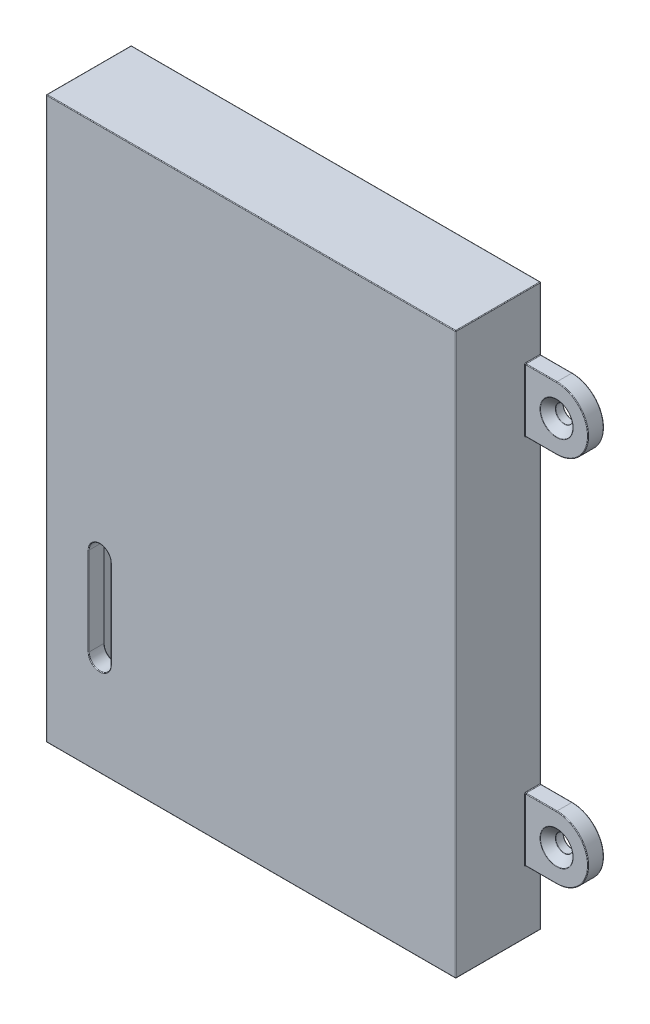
ISO-10303-21;
HEADER;
FILE_DESCRIPTION(('STEP AP214'),'2;1');
FILE_NAME('part.step','',(''),(''),'','','');
FILE_SCHEMA(('AUTOMOTIVE_DESIGN { 1 0 10303 214 1 1 1 1 }'));
ENDSEC;
DATA;
#1=APPLICATION_CONTEXT('core data for automotive mechanical design processes');
#2=APPLICATION_PROTOCOL_DEFINITION('international standard','automotive_design',2000,#1);
#3=PRODUCT_CONTEXT('',#1,'mechanical');
#4=PRODUCT('Part','Part','',(#3));
#5=PRODUCT_RELATED_PRODUCT_CATEGORY('part','',(#4));
#6=PRODUCT_DEFINITION_FORMATION('','',#4);
#7=PRODUCT_DEFINITION_CONTEXT('part definition',#1,'design');
#8=PRODUCT_DEFINITION('design','',#6,#7);
#9=PRODUCT_DEFINITION_SHAPE('','',#8);
#10=(LENGTH_UNIT() NAMED_UNIT(*) SI_UNIT(.MILLI.,.METRE.));
#11=(NAMED_UNIT(*) PLANE_ANGLE_UNIT() SI_UNIT($,.RADIAN.));
#12=(NAMED_UNIT(*) SI_UNIT($,.STERADIAN.) SOLID_ANGLE_UNIT());
#13=UNCERTAINTY_MEASURE_WITH_UNIT(LENGTH_MEASURE(1.E-05),#10,'distance_accuracy_value','');
#14=(GEOMETRIC_REPRESENTATION_CONTEXT(3) GLOBAL_UNCERTAINTY_ASSIGNED_CONTEXT((#13)) GLOBAL_UNIT_ASSIGNED_CONTEXT((#10,
#11,#12)) REPRESENTATION_CONTEXT('',''));
#15=CARTESIAN_POINT('',(0.,0.,0.));
#16=DIRECTION('',(0.,0.,1.));
#17=DIRECTION('',(1.,0.,0.));
#18=AXIS2_PLACEMENT_3D('',#15,#16,#17);
#19=CARTESIAN_POINT('',(0.,0.,0.));
#20=DIRECTION('',(0.,0.,1.));
#21=DIRECTION('',(1.,0.,0.));
#22=AXIS2_PLACEMENT_3D('',#19,#20,#21);
#23=PLANE('',#22);
#24=CARTESIAN_POINT('',(39.5111996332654,45.2910798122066,0.));
#25=DIRECTION('',(0.,0.,1.));
#26=DIRECTION('',(1.,0.,0.));
#27=AXIS2_PLACEMENT_3D('',#24,#25,#26);
#28=CIRCLE('',#27,2.95);
#29=CARTESIAN_POINT('',(42.4611996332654,45.2910798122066,0.));
#30=VERTEX_POINT('',#29);
#31=EDGE_CURVE('E910',#30,#30,#28,.T.);
#32=ORIENTED_EDGE('',*,*,#31,.T.);
#33=EDGE_LOOP('',(#32));
#34=FACE_BOUND('',#33,.T.);
#35=CARTESIAN_POINT('',(39.5111996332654,-72.7089201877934,0.));
#36=DIRECTION('',(0.,0.,1.));
#37=DIRECTION('',(1.,0.,0.));
#38=AXIS2_PLACEMENT_3D('',#35,#36,#37);
#39=CIRCLE('',#38,2.95);
#40=CARTESIAN_POINT('',(42.4611996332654,-72.7089201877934,0.));
#41=VERTEX_POINT('',#40);
#42=EDGE_CURVE('E906',#41,#41,#39,.T.);
#43=ORIENTED_EDGE('',*,*,#42,.T.);
#44=EDGE_LOOP('',(#43));
#45=FACE_BOUND('',#44,.T.);
#46=CARTESIAN_POINT('',(-110.488800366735,45.2910798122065,0.));
#47=DIRECTION('',(0.,0.,1.));
#48=DIRECTION('',(1.,0.,0.));
#49=AXIS2_PLACEMENT_3D('',#46,#47,#48);
#50=CIRCLE('',#49,2.95);
#51=CARTESIAN_POINT('',(-107.538800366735,45.2910798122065,0.));
#52=VERTEX_POINT('',#51);
#53=EDGE_CURVE('E901',#52,#52,#50,.T.);
#54=ORIENTED_EDGE('',*,*,#53,.T.);
#55=EDGE_LOOP('',(#54));
#56=FACE_BOUND('',#55,.T.);
#57=CARTESIAN_POINT('',(-110.488800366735,-72.7089201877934,0.));
#58=DIRECTION('',(0.,0.,1.));
#59=DIRECTION('',(1.,0.,0.));
#60=AXIS2_PLACEMENT_3D('',#57,#58,#59);
#61=CIRCLE('',#60,2.95);
#62=CARTESIAN_POINT('',(-107.538800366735,-72.7089201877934,0.));
#63=VERTEX_POINT('',#62);
#64=EDGE_CURVE('E897',#63,#63,#61,.T.);
#65=ORIENTED_EDGE('',*,*,#64,.T.);
#66=EDGE_LOOP('',(#65));
#67=FACE_BOUND('',#66,.T.);
#68=DIRECTION('',(0.,-1.,0.));
#69=VECTOR('',#68,1.);
#70=CARTESIAN_POINT('',(-95.6888003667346,-97.7089201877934,0.));
#71=LINE('',#70,#69);
#72=CARTESIAN_POINT('',(-95.6888003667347,70.4910798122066,0.));
#73=VERTEX_POINT('',#72);
#74=CARTESIAN_POINT('',(-95.6888003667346,-97.7089201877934,0.));
#75=VERTEX_POINT('',#74);
#76=EDGE_CURVE('E1560',#73,#75,#71,.T.);
#77=ORIENTED_EDGE('',*,*,#76,.T.);
#78=DIRECTION('',(1.,0.,0.));
#79=VECTOR('',#78,1.);
#80=CARTESIAN_POINT('',(-100.488800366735,-97.7089201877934,0.));
#81=LINE('',#80,#79);
#82=CARTESIAN_POINT('',(24.7111996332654,-97.7089201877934,0.));
#83=VERTEX_POINT('',#82);
#84=EDGE_CURVE('E1141',#75,#83,#81,.T.);
#85=ORIENTED_EDGE('',*,*,#84,.T.);
#86=DIRECTION('',(0.,1.,0.));
#87=VECTOR('',#86,1.);
#88=CARTESIAN_POINT('',(24.7111996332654,70.2910798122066,0.));
#89=LINE('',#88,#87);
#90=CARTESIAN_POINT('',(24.7111996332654,70.4910798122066,0.));
#91=VERTEX_POINT('',#90);
#92=EDGE_CURVE('E1554',#83,#91,#89,.T.);
#93=ORIENTED_EDGE('',*,*,#92,.T.);
#94=DIRECTION('',(-1.,0.,0.));
#95=VECTOR('',#94,1.);
#96=CARTESIAN_POINT('',(-95.4888003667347,70.4910798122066,0.));
#97=LINE('',#96,#95);
#98=EDGE_CURVE('E1557',#91,#73,#97,.T.);
#99=ORIENTED_EDGE('',*,*,#98,.T.);
#100=EDGE_LOOP('',(#77,#85,#93,#99));
#101=FACE_BOUND('',#100,.T.);
#102=CARTESIAN_POINT('',(-100.688800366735,-82.9089201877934,0.));
#103=DIRECTION('',(0.,0.,1.));
#104=DIRECTION('',(1.,0.,0.));
#105=AXIS2_PLACEMENT_3D('',#102,#103,#104);
#106=CIRCLE('',#105,0.4);
#107=CARTESIAN_POINT('',(-100.688800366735,-82.5089201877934,0.));
#108=VERTEX_POINT('',#107);
#109=CARTESIAN_POINT('',(-100.288800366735,-82.9089201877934,0.));
#110=VERTEX_POINT('',#109);
#111=EDGE_CURVE('E1551',#108,#110,#106,.F.);
#112=ORIENTED_EDGE('',*,*,#111,.F.);
#113=DIRECTION('',(1.,0.,0.));
#114=VECTOR('',#113,1.);
#115=CARTESIAN_POINT('',(0.,-82.5089201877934,0.));
#116=LINE('',#115,#114);
#117=CARTESIAN_POINT('',(-110.488800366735,-82.5089201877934,0.));
#118=VERTEX_POINT('',#117);
#119=EDGE_CURVE('E1548',#108,#118,#116,.F.);
#120=ORIENTED_EDGE('',*,*,#119,.T.);
#121=CARTESIAN_POINT('',(-110.488800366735,-72.7089201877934,0.));
#122=DIRECTION('',(0.,0.,1.));
#123=DIRECTION('',(1.,0.,0.));
#124=AXIS2_PLACEMENT_3D('',#121,#122,#123);
#125=CIRCLE('',#124,9.79999999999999);
#126=CARTESIAN_POINT('',(-110.488800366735,-62.9089201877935,0.));
#127=VERTEX_POINT('',#126);
#128=EDGE_CURVE('E1541',#118,#127,#125,.F.);
#129=ORIENTED_EDGE('',*,*,#128,.T.);
#130=DIRECTION('',(-1.,0.,0.));
#131=VECTOR('',#130,1.);
#132=CARTESIAN_POINT('',(0.,-62.9089201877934,0.));
#133=LINE('',#132,#131);
#134=CARTESIAN_POINT('',(-100.688800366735,-62.9089201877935,0.));
#135=VERTEX_POINT('',#134);
#136=EDGE_CURVE('E1538',#127,#135,#133,.F.);
#137=ORIENTED_EDGE('',*,*,#136,.T.);
#138=CARTESIAN_POINT('',(-100.688800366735,-62.5089201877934,0.));
#139=DIRECTION('',(0.,0.,1.));
#140=DIRECTION('',(1.,0.,0.));
#141=AXIS2_PLACEMENT_3D('',#138,#139,#140);
#142=CIRCLE('',#141,0.4);
#143=CARTESIAN_POINT('',(-100.288800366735,-62.5089201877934,0.));
#144=VERTEX_POINT('',#143);
#145=EDGE_CURVE('E1534',#144,#135,#142,.F.);
#146=ORIENTED_EDGE('',*,*,#145,.F.);
#147=DIRECTION('',(0.,-1.,0.));
#148=VECTOR('',#147,1.);
#149=CARTESIAN_POINT('',(-100.288800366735,0.,0.));
#150=LINE('',#149,#148);
#151=CARTESIAN_POINT('',(-100.288800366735,35.0910798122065,0.));
#152=VERTEX_POINT('',#151);
#153=EDGE_CURVE('E1531',#144,#152,#150,.F.);
#154=ORIENTED_EDGE('',*,*,#153,.T.);
#155=CARTESIAN_POINT('',(-100.688800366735,35.0910798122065,0.));
#156=DIRECTION('',(0.,0.,1.));
#157=DIRECTION('',(1.,0.,0.));
#158=AXIS2_PLACEMENT_3D('',#155,#156,#157);
#159=CIRCLE('',#158,0.4);
#160=CARTESIAN_POINT('',(-100.688800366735,35.4910798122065,0.));
#161=VERTEX_POINT('',#160);
#162=EDGE_CURVE('E1527',#161,#152,#159,.F.);
#163=ORIENTED_EDGE('',*,*,#162,.F.);
#164=DIRECTION('',(1.,0.,0.));
#165=VECTOR('',#164,1.);
#166=CARTESIAN_POINT('',(0.,35.4910798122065,0.));
#167=LINE('',#166,#165);
#168=CARTESIAN_POINT('',(-110.488800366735,35.4910798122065,0.));
#169=VERTEX_POINT('',#168);
#170=EDGE_CURVE('E1524',#161,#169,#167,.F.);
#171=ORIENTED_EDGE('',*,*,#170,.T.);
#172=CARTESIAN_POINT('',(-110.488800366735,45.2910798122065,0.));
#173=DIRECTION('',(0.,0.,1.));
#174=DIRECTION('',(1.,0.,0.));
#175=AXIS2_PLACEMENT_3D('',#172,#173,#174);
#176=CIRCLE('',#175,9.80000000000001);
#177=CARTESIAN_POINT('',(-110.488800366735,55.0910798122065,0.));
#178=VERTEX_POINT('',#177);
#179=EDGE_CURVE('E1521',#169,#178,#176,.F.);
#180=ORIENTED_EDGE('',*,*,#179,.T.);
#181=DIRECTION('',(-1.,0.,0.));
#182=VECTOR('',#181,1.);
#183=CARTESIAN_POINT('',(0.,55.0910798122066,0.));
#184=LINE('',#183,#182);
#185=CARTESIAN_POINT('',(-100.688800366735,55.0910798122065,0.));
#186=VERTEX_POINT('',#185);
#187=EDGE_CURVE('E1518',#178,#186,#184,.F.);
#188=ORIENTED_EDGE('',*,*,#187,.T.);
#189=CARTESIAN_POINT('',(-100.688800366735,55.4910798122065,0.));
#190=DIRECTION('',(0.,0.,1.));
#191=DIRECTION('',(1.,0.,0.));
#192=AXIS2_PLACEMENT_3D('',#189,#190,#191);
#193=CIRCLE('',#192,0.4);
#194=CARTESIAN_POINT('',(-100.288800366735,55.4910798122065,0.));
#195=VERTEX_POINT('',#194);
#196=EDGE_CURVE('E1514',#195,#186,#193,.F.);
#197=ORIENTED_EDGE('',*,*,#196,.F.);
#198=DIRECTION('',(0.,-1.,0.));
#199=VECTOR('',#198,1.);
#200=CARTESIAN_POINT('',(-100.288800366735,0.,0.));
#201=LINE('',#200,#199);
#202=CARTESIAN_POINT('',(-100.288800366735,75.0910798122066,0.));
#203=VERTEX_POINT('',#202);
#204=EDGE_CURVE('E1511',#195,#203,#201,.F.);
#205=ORIENTED_EDGE('',*,*,#204,.T.);
#206=DIRECTION('',(-1.,0.,0.));
#207=VECTOR('',#206,1.);
#208=CARTESIAN_POINT('',(0.,75.0910798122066,0.));
#209=LINE('',#208,#207);
#210=CARTESIAN_POINT('',(29.3111996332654,75.0910798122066,0.));
#211=VERTEX_POINT('',#210);
#212=EDGE_CURVE('E1508',#203,#211,#209,.F.);
#213=ORIENTED_EDGE('',*,*,#212,.T.);
#214=DIRECTION('',(0.,1.,0.));
#215=VECTOR('',#214,1.);
#216=CARTESIAN_POINT('',(29.3111996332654,0.,0.));
#217=LINE('',#216,#215);
#218=CARTESIAN_POINT('',(29.3111996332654,55.4910798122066,0.));
#219=VERTEX_POINT('',#218);
#220=EDGE_CURVE('E1505',#211,#219,#217,.F.);
#221=ORIENTED_EDGE('',*,*,#220,.T.);
#222=CARTESIAN_POINT('',(29.7111996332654,55.4910798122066,0.));
#223=DIRECTION('',(0.,0.,1.));
#224=DIRECTION('',(1.,0.,0.));
#225=AXIS2_PLACEMENT_3D('',#222,#223,#224);
#226=CIRCLE('',#225,0.4);
#227=CARTESIAN_POINT('',(29.7111996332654,55.0910798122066,0.));
#228=VERTEX_POINT('',#227);
#229=EDGE_CURVE('E1501',#228,#219,#226,.F.);
#230=ORIENTED_EDGE('',*,*,#229,.F.);
#231=DIRECTION('',(-1.,0.,0.));
#232=VECTOR('',#231,1.);
#233=CARTESIAN_POINT('',(0.,55.0910798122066,0.));
#234=LINE('',#233,#232);
#235=CARTESIAN_POINT('',(39.5111996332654,55.0910798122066,0.));
#236=VERTEX_POINT('',#235);
#237=EDGE_CURVE('E1498',#228,#236,#234,.F.);
#238=ORIENTED_EDGE('',*,*,#237,.T.);
#239=CARTESIAN_POINT('',(39.5111996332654,45.2910798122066,0.));
#240=DIRECTION('',(0.,0.,1.));
#241=DIRECTION('',(1.,0.,0.));
#242=AXIS2_PLACEMENT_3D('',#239,#240,#241);
#243=CIRCLE('',#242,9.80000000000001);
#244=CARTESIAN_POINT('',(39.5111996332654,35.4910798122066,0.));
#245=VERTEX_POINT('',#244);
#246=EDGE_CURVE('E1495',#236,#245,#243,.F.);
#247=ORIENTED_EDGE('',*,*,#246,.T.);
#248=DIRECTION('',(1.,0.,0.));
#249=VECTOR('',#248,1.);
#250=CARTESIAN_POINT('',(0.,35.4910798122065,0.));
#251=LINE('',#250,#249);
#252=CARTESIAN_POINT('',(29.7111996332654,35.4910798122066,0.));
#253=VERTEX_POINT('',#252);
#254=EDGE_CURVE('E1492',#245,#253,#251,.F.);
#255=ORIENTED_EDGE('',*,*,#254,.T.);
#256=CARTESIAN_POINT('',(29.7111996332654,35.0910798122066,0.));
#257=DIRECTION('',(0.,0.,1.));
#258=DIRECTION('',(1.,0.,0.));
#259=AXIS2_PLACEMENT_3D('',#256,#257,#258);
#260=CIRCLE('',#259,0.4);
#261=CARTESIAN_POINT('',(29.3111996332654,35.0910798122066,0.));
#262=VERTEX_POINT('',#261);
#263=EDGE_CURVE('E1488',#262,#253,#260,.F.);
#264=ORIENTED_EDGE('',*,*,#263,.F.);
#265=DIRECTION('',(0.,1.,0.));
#266=VECTOR('',#265,1.);
#267=CARTESIAN_POINT('',(29.3111996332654,0.,0.));
#268=LINE('',#267,#266);
#269=CARTESIAN_POINT('',(29.3111996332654,-62.5089201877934,0.));
#270=VERTEX_POINT('',#269);
#271=EDGE_CURVE('E1485',#262,#270,#268,.F.);
#272=ORIENTED_EDGE('',*,*,#271,.T.);
#273=CARTESIAN_POINT('',(29.7111996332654,-62.5089201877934,0.));
#274=DIRECTION('',(0.,0.,1.));
#275=DIRECTION('',(1.,0.,0.));
#276=AXIS2_PLACEMENT_3D('',#273,#274,#275);
#277=CIRCLE('',#276,0.4);
#278=CARTESIAN_POINT('',(29.7111996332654,-62.9089201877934,0.));
#279=VERTEX_POINT('',#278);
#280=EDGE_CURVE('E1481',#279,#270,#277,.F.);
#281=ORIENTED_EDGE('',*,*,#280,.F.);
#282=DIRECTION('',(-1.,0.,0.));
#283=VECTOR('',#282,1.);
#284=CARTESIAN_POINT('',(0.,-62.9089201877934,0.));
#285=LINE('',#284,#283);
#286=CARTESIAN_POINT('',(39.5111996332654,-62.9089201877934,0.));
#287=VERTEX_POINT('',#286);
#288=EDGE_CURVE('E1478',#279,#287,#285,.F.);
#289=ORIENTED_EDGE('',*,*,#288,.T.);
#290=CARTESIAN_POINT('',(39.5111996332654,-72.7089201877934,0.));
#291=DIRECTION('',(0.,0.,1.));
#292=DIRECTION('',(1.,0.,0.));
#293=AXIS2_PLACEMENT_3D('',#290,#291,#292);
#294=CIRCLE('',#293,9.79999999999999);
#295=CARTESIAN_POINT('',(39.5111996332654,-82.5089201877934,0.));
#296=VERTEX_POINT('',#295);
#297=EDGE_CURVE('E1475',#287,#296,#294,.F.);
#298=ORIENTED_EDGE('',*,*,#297,.T.);
#299=DIRECTION('',(1.,0.,0.));
#300=VECTOR('',#299,1.);
#301=CARTESIAN_POINT('',(0.,-82.5089201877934,0.));
#302=LINE('',#301,#300);
#303=CARTESIAN_POINT('',(29.7111996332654,-82.5089201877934,0.));
#304=VERTEX_POINT('',#303);
#305=EDGE_CURVE('E1472',#296,#304,#302,.F.);
#306=ORIENTED_EDGE('',*,*,#305,.T.);
#307=CARTESIAN_POINT('',(29.7111996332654,-82.9089201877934,0.));
#308=DIRECTION('',(0.,0.,1.));
#309=DIRECTION('',(1.,0.,0.));
#310=AXIS2_PLACEMENT_3D('',#307,#308,#309);
#311=CIRCLE('',#310,0.4);
#312=CARTESIAN_POINT('',(29.3111996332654,-82.9089201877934,0.));
#313=VERTEX_POINT('',#312);
#314=EDGE_CURVE('E1468',#313,#304,#311,.F.);
#315=ORIENTED_EDGE('',*,*,#314,.F.);
#316=DIRECTION('',(0.,1.,0.));
#317=VECTOR('',#316,1.);
#318=CARTESIAN_POINT('',(29.3111996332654,0.,0.));
#319=LINE('',#318,#317);
#320=CARTESIAN_POINT('',(29.3111996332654,-102.508920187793,0.));
#321=VERTEX_POINT('',#320);
#322=EDGE_CURVE('E1465',#313,#321,#319,.F.);
#323=ORIENTED_EDGE('',*,*,#322,.T.);
#324=DIRECTION('',(1.,0.,0.));
#325=VECTOR('',#324,1.);
#326=CARTESIAN_POINT('',(0.,-102.508920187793,0.));
#327=LINE('',#326,#325);
#328=CARTESIAN_POINT('',(-100.288800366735,-102.508920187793,0.));
#329=VERTEX_POINT('',#328);
#330=EDGE_CURVE('E1462',#321,#329,#327,.F.);
#331=ORIENTED_EDGE('',*,*,#330,.T.);
#332=DIRECTION('',(0.,-1.,0.));
#333=VECTOR('',#332,1.);
#334=CARTESIAN_POINT('',(-100.288800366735,0.,0.));
#335=LINE('',#334,#333);
#336=EDGE_CURVE('E1544',#329,#110,#335,.F.);
#337=ORIENTED_EDGE('',*,*,#336,.T.);
#338=EDGE_LOOP('',(#112,#120,#129,#137,#146,#154,#163,#171,#180,#188,#197,#205,#213,#221,#230,
#238,#247,#255,#264,#272,#281,#289,#298,#306,#315,#323,#331,#337));
#339=FACE_BOUND('',#338,.T.);
#340=ADVANCED_FACE('F44',(#34,#45,#56,#67,#101,#339),#23,.F.);
#341=CARTESIAN_POINT('',(0.,0.,27.));
#342=DIRECTION('',(0.,0.,1.));
#343=DIRECTION('',(1.,0.,0.));
#344=AXIS2_PLACEMENT_3D('',#341,#342,#343);
#345=PLANE('',#344);
#346=CARTESIAN_POINT('',(-83.4888003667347,-43.2429868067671,27.));
#347=DIRECTION('',(0.,0.,1.));
#348=DIRECTION('',(1.,0.,0.));
#349=AXIS2_PLACEMENT_3D('',#346,#347,#348);
#350=CIRCLE('',#349,3.7);
#351=CARTESIAN_POINT('',(-87.1888003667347,-43.2429868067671,27.));
#352=VERTEX_POINT('',#351);
#353=CARTESIAN_POINT('',(-79.7888003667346,-43.2429868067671,27.));
#354=VERTEX_POINT('',#353);
#355=EDGE_CURVE('E1008',#352,#354,#350,.F.);
#356=ORIENTED_EDGE('',*,*,#355,.T.);
#357=DIRECTION('',(0.,1.,0.));
#358=VECTOR('',#357,1.);
#359=CARTESIAN_POINT('',(-79.7888003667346,0.,27.));
#360=LINE('',#359,#358);
#361=CARTESIAN_POINT('',(-79.7888003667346,-71.2429868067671,27.));
#362=VERTEX_POINT('',#361);
#363=EDGE_CURVE('E1011',#354,#362,#360,.F.);
#364=ORIENTED_EDGE('',*,*,#363,.T.);
#365=CARTESIAN_POINT('',(-83.4888003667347,-71.2429868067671,27.));
#366=DIRECTION('',(0.,0.,1.));
#367=DIRECTION('',(1.,0.,0.));
#368=AXIS2_PLACEMENT_3D('',#365,#366,#367);
#369=CIRCLE('',#368,3.7);
#370=CARTESIAN_POINT('',(-87.1888003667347,-71.2429868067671,27.));
#371=VERTEX_POINT('',#370);
#372=EDGE_CURVE('E1002',#362,#371,#369,.F.);
#373=ORIENTED_EDGE('',*,*,#372,.T.);
#374=DIRECTION('',(0.,-1.,0.));
#375=VECTOR('',#374,1.);
#376=CARTESIAN_POINT('',(-87.1888003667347,0.,27.));
#377=LINE('',#376,#375);
#378=EDGE_CURVE('E1005',#371,#352,#377,.F.);
#379=ORIENTED_EDGE('',*,*,#378,.T.);
#380=EDGE_LOOP('',(#356,#364,#373,#379));
#381=FACE_BOUND('',#380,.T.);
#382=DIRECTION('',(1.,0.,0.));
#383=VECTOR('',#382,1.);
#384=CARTESIAN_POINT('',(29.5111996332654,-102.508920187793,27.));
#385=LINE('',#384,#383);
#386=CARTESIAN_POINT('',(-100.288800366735,-102.508920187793,27.));
#387=VERTEX_POINT('',#386);
#388=CARTESIAN_POINT('',(29.3111996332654,-102.508920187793,27.));
#389=VERTEX_POINT('',#388);
#390=EDGE_CURVE('E1579',#387,#389,#385,.T.);
#391=ORIENTED_EDGE('',*,*,#390,.T.);
#392=DIRECTION('',(0.,1.,0.));
#393=VECTOR('',#392,1.);
#394=CARTESIAN_POINT('',(29.3111996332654,75.2910798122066,27.));
#395=LINE('',#394,#393);
#396=CARTESIAN_POINT('',(29.3111996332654,75.0910798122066,27.));
#397=VERTEX_POINT('',#396);
#398=EDGE_CURVE('E1582',#389,#397,#395,.T.);
#399=ORIENTED_EDGE('',*,*,#398,.T.);
#400=DIRECTION('',(-1.,0.,0.));
#401=VECTOR('',#400,1.);
#402=CARTESIAN_POINT('',(-100.488800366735,75.0910798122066,27.));
#403=LINE('',#402,#401);
#404=CARTESIAN_POINT('',(-100.288800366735,75.0910798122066,27.));
#405=VERTEX_POINT('',#404);
#406=EDGE_CURVE('E1573',#397,#405,#403,.T.);
#407=ORIENTED_EDGE('',*,*,#406,.T.);
#408=DIRECTION('',(0.,-1.,0.));
#409=VECTOR('',#408,1.);
#410=CARTESIAN_POINT('',(-100.288800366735,-102.708920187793,27.));
#411=LINE('',#410,#409);
#412=EDGE_CURVE('E1576',#405,#387,#411,.T.);
#413=ORIENTED_EDGE('',*,*,#412,.T.);
#414=EDGE_LOOP('',(#391,#399,#407,#413));
#415=FACE_BOUND('',#414,.T.);
#416=ADVANCED_FACE('F1793',(#381,#415),#345,.T.);
#417=CARTESIAN_POINT('',(0.,0.,22.));
#418=DIRECTION('',(0.,0.,1.));
#419=DIRECTION('',(1.,0.,0.));
#420=AXIS2_PLACEMENT_3D('',#417,#418,#419);
#421=PLANE('',#420);
#422=DIRECTION('',(0.,-1.,0.));
#423=VECTOR('',#422,1.);
#424=CARTESIAN_POINT('',(-95.2888003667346,0.,22.));
#425=LINE('',#424,#423);
#426=CARTESIAN_POINT('',(-95.2888003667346,-97.5089201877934,22.));
#427=VERTEX_POINT('',#426);
#428=CARTESIAN_POINT('',(-95.2888003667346,70.0910798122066,22.));
#429=VERTEX_POINT('',#428);
#430=EDGE_CURVE('E1080',#427,#429,#425,.F.);
#431=ORIENTED_EDGE('',*,*,#430,.T.);
#432=DIRECTION('',(-1.,0.,0.));
#433=VECTOR('',#432,1.);
#434=CARTESIAN_POINT('',(0.,70.0910798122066,22.));
#435=LINE('',#434,#433);
#436=CARTESIAN_POINT('',(24.3111996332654,70.0910798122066,22.));
#437=VERTEX_POINT('',#436);
#438=EDGE_CURVE('E1086',#429,#437,#435,.F.);
#439=ORIENTED_EDGE('',*,*,#438,.T.);
#440=DIRECTION('',(0.,1.,0.));
#441=VECTOR('',#440,1.);
#442=CARTESIAN_POINT('',(24.3111996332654,0.,22.));
#443=LINE('',#442,#441);
#444=CARTESIAN_POINT('',(24.3111996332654,-97.5089201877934,22.));
#445=VERTEX_POINT('',#444);
#446=EDGE_CURVE('E1083',#437,#445,#443,.F.);
#447=ORIENTED_EDGE('',*,*,#446,.T.);
#448=DIRECTION('',(1.,0.,0.));
#449=VECTOR('',#448,1.);
#450=CARTESIAN_POINT('',(0.,-97.5089201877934,22.));
#451=LINE('',#450,#449);
#452=EDGE_CURVE('E1077',#445,#427,#451,.F.);
#453=ORIENTED_EDGE('',*,*,#452,.T.);
#454=EDGE_LOOP('',(#431,#439,#447,#453));
#455=FACE_BOUND('',#454,.T.);
#456=CARTESIAN_POINT('',(-83.4888003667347,-71.2429868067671,22.));
#457=DIRECTION('',(0.,0.,1.));
#458=DIRECTION('',(1.,0.,0.));
#459=AXIS2_PLACEMENT_3D('',#456,#457,#458);
#460=CIRCLE('',#459,3.7);
#461=CARTESIAN_POINT('',(-87.1888003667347,-71.2429868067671,22.));
#462=VERTEX_POINT('',#461);
#463=CARTESIAN_POINT('',(-79.7888003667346,-71.2429868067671,22.));
#464=VERTEX_POINT('',#463);
#465=EDGE_CURVE('E1015',#462,#464,#460,.T.);
#466=ORIENTED_EDGE('',*,*,#465,.T.);
#467=DIRECTION('',(0.,-1.,0.));
#468=VECTOR('',#467,1.);
#469=CARTESIAN_POINT('',(-79.7888003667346,-43.2429868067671,22.));
#470=LINE('',#469,#468);
#471=CARTESIAN_POINT('',(-79.7888003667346,-43.2429868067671,22.));
#472=VERTEX_POINT('',#471);
#473=EDGE_CURVE('E1024',#464,#472,#470,.F.);
#474=ORIENTED_EDGE('',*,*,#473,.T.);
#475=CARTESIAN_POINT('',(-83.4888003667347,-43.2429868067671,22.));
#476=DIRECTION('',(0.,0.,1.));
#477=DIRECTION('',(1.,0.,0.));
#478=AXIS2_PLACEMENT_3D('',#475,#476,#477);
#479=CIRCLE('',#478,3.7);
#480=CARTESIAN_POINT('',(-87.1888003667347,-43.2429868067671,22.));
#481=VERTEX_POINT('',#480);
#482=EDGE_CURVE('E1021',#472,#481,#479,.T.);
#483=ORIENTED_EDGE('',*,*,#482,.T.);
#484=DIRECTION('',(0.,1.,0.));
#485=VECTOR('',#484,1.);
#486=CARTESIAN_POINT('',(-87.1888003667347,-71.2429868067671,22.));
#487=LINE('',#486,#485);
#488=EDGE_CURVE('E1018',#481,#462,#487,.F.);
#489=ORIENTED_EDGE('',*,*,#488,.T.);
#490=EDGE_LOOP('',(#466,#474,#483,#489));
#491=FACE_BOUND('',#490,.T.);
#492=ADVANCED_FACE('F1121',(#455,#491),#421,.F.);
#493=CARTESIAN_POINT('',(-100.488800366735,75.2910798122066,27.));
#494=DIRECTION('',(1.,0.,0.));
#495=DIRECTION('',(0.,1.,0.));
#496=AXIS2_PLACEMENT_3D('',#493,#494,#495);
#497=PLANE('',#496);
#498=CARTESIAN_POINT('',(-100.488800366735,55.0910798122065,4.8));
#499=DIRECTION('',(1.,0.,0.));
#500=DIRECTION('',(0.,1.,0.));
#501=AXIS2_PLACEMENT_3D('',#498,#499,#500);
#502=CIRCLE('',#501,0.4);
#503=CARTESIAN_POINT('',(-100.488800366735,55.0910798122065,5.2));
#504=VERTEX_POINT('',#503);
#505=CARTESIAN_POINT('',(-100.488800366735,55.4910798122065,4.8));
#506=VERTEX_POINT('',#505);
#507=EDGE_CURVE('E1263',#504,#506,#502,.F.);
#508=ORIENTED_EDGE('',*,*,#507,.F.);
#509=DIRECTION('',(0.,-1.,0.));
#510=VECTOR('',#509,1.);
#511=CARTESIAN_POINT('',(-100.488800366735,75.2910798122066,5.2));
#512=LINE('',#511,#510);
#513=CARTESIAN_POINT('',(-100.488800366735,35.4910798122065,5.2));
#514=VERTEX_POINT('',#513);
#515=EDGE_CURVE('E1274',#504,#514,#512,.T.);
#516=ORIENTED_EDGE('',*,*,#515,.T.);
#517=CARTESIAN_POINT('',(-100.488800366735,35.4910798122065,4.8));
#518=DIRECTION('',(1.,0.,0.));
#519=DIRECTION('',(0.,1.,0.));
#520=AXIS2_PLACEMENT_3D('',#517,#518,#519);
#521=CIRCLE('',#520,0.4);
#522=CARTESIAN_POINT('',(-100.488800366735,35.0910798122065,4.8));
#523=VERTEX_POINT('',#522);
#524=EDGE_CURVE('E1270',#523,#514,#521,.F.);
#525=ORIENTED_EDGE('',*,*,#524,.F.);
#526=DIRECTION('',(0.,0.,1.));
#527=VECTOR('',#526,1.);
#528=CARTESIAN_POINT('',(-100.488800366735,35.0910798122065,0.));
#529=LINE('',#528,#527);
#530=CARTESIAN_POINT('',(-100.488800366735,35.0910798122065,0.199999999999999));
#531=VERTEX_POINT('',#530);
#532=EDGE_CURVE('E1267',#523,#531,#529,.F.);
#533=ORIENTED_EDGE('',*,*,#532,.T.);
#534=DIRECTION('',(0.,-1.,0.));
#535=VECTOR('',#534,1.);
#536=CARTESIAN_POINT('',(-100.488800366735,75.2910798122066,0.199999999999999));
#537=LINE('',#536,#535);
#538=CARTESIAN_POINT('',(-100.488800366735,-62.5089201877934,0.199999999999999));
#539=VERTEX_POINT('',#538);
#540=EDGE_CURVE('E1260',#531,#539,#537,.T.);
#541=ORIENTED_EDGE('',*,*,#540,.T.);
#542=DIRECTION('',(0.,0.,-1.));
#543=VECTOR('',#542,1.);
#544=CARTESIAN_POINT('',(-100.488800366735,-62.5089201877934,5.));
#545=LINE('',#544,#543);
#546=CARTESIAN_POINT('',(-100.488800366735,-62.5089201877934,4.8));
#547=VERTEX_POINT('',#546);
#548=EDGE_CURVE('E1254',#539,#547,#545,.F.);
#549=ORIENTED_EDGE('',*,*,#548,.T.);
#550=CARTESIAN_POINT('',(-100.488800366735,-62.9089201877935,4.8));
#551=DIRECTION('',(1.,0.,0.));
#552=DIRECTION('',(0.,1.,0.));
#553=AXIS2_PLACEMENT_3D('',#550,#551,#552);
#554=CIRCLE('',#553,0.4);
#555=CARTESIAN_POINT('',(-100.488800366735,-62.9089201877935,5.2));
#556=VERTEX_POINT('',#555);
#557=EDGE_CURVE('E1250',#556,#547,#554,.F.);
#558=ORIENTED_EDGE('',*,*,#557,.F.);
#559=DIRECTION('',(0.,-1.,0.));
#560=VECTOR('',#559,1.);
#561=CARTESIAN_POINT('',(-100.488800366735,75.2910798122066,5.2));
#562=LINE('',#561,#560);
#563=CARTESIAN_POINT('',(-100.488800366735,-82.5089201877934,5.2));
#564=VERTEX_POINT('',#563);
#565=EDGE_CURVE('E1247',#556,#564,#562,.T.);
#566=ORIENTED_EDGE('',*,*,#565,.T.);
#567=CARTESIAN_POINT('',(-100.488800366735,-82.5089201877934,4.8));
#568=DIRECTION('',(1.,0.,0.));
#569=DIRECTION('',(0.,1.,0.));
#570=AXIS2_PLACEMENT_3D('',#567,#568,#569);
#571=CIRCLE('',#570,0.4);
#572=CARTESIAN_POINT('',(-100.488800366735,-82.9089201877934,4.8));
#573=VERTEX_POINT('',#572);
#574=EDGE_CURVE('E1243',#573,#564,#571,.F.);
#575=ORIENTED_EDGE('',*,*,#574,.F.);
#576=DIRECTION('',(0.,0.,1.));
#577=VECTOR('',#576,1.);
#578=CARTESIAN_POINT('',(-100.488800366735,-82.9089201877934,0.));
#579=LINE('',#578,#577);
#580=CARTESIAN_POINT('',(-100.488800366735,-82.9089201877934,0.199999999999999));
#581=VERTEX_POINT('',#580);
#582=EDGE_CURVE('E1240',#573,#581,#579,.F.);
#583=ORIENTED_EDGE('',*,*,#582,.T.);
#584=DIRECTION('',(0.,-1.,0.));
#585=VECTOR('',#584,1.);
#586=CARTESIAN_POINT('',(-100.488800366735,75.2910798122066,0.199999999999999));
#587=LINE('',#586,#585);
#588=CARTESIAN_POINT('',(-100.488800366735,-102.508920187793,0.199999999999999));
#589=VERTEX_POINT('',#588);
#590=EDGE_CURVE('E1237',#581,#589,#587,.T.);
#591=ORIENTED_EDGE('',*,*,#590,.T.);
#592=DIRECTION('',(0.,0.,-1.));
#593=VECTOR('',#592,1.);
#594=CARTESIAN_POINT('',(-100.488800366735,-102.508920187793,27.));
#595=LINE('',#594,#593);
#596=CARTESIAN_POINT('',(-100.488800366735,-102.508920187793,26.8));
#597=VERTEX_POINT('',#596);
#598=EDGE_CURVE('E1228',#589,#597,#595,.F.);
#599=ORIENTED_EDGE('',*,*,#598,.T.);
#600=DIRECTION('',(0.,-1.,0.));
#601=VECTOR('',#600,1.);
#602=CARTESIAN_POINT('',(-100.488800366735,75.2910798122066,26.8));
#603=LINE('',#602,#601);
#604=CARTESIAN_POINT('',(-100.488800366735,75.0910798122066,26.8));
#605=VERTEX_POINT('',#604);
#606=EDGE_CURVE('E1225',#597,#605,#603,.F.);
#607=ORIENTED_EDGE('',*,*,#606,.T.);
#608=DIRECTION('',(0.,0.,-1.));
#609=VECTOR('',#608,1.);
#610=CARTESIAN_POINT('',(-100.488800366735,75.0910798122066,27.));
#611=LINE('',#610,#609);
#612=CARTESIAN_POINT('',(-100.488800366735,75.0910798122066,0.199999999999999));
#613=VERTEX_POINT('',#612);
#614=EDGE_CURVE('E1231',#605,#613,#611,.T.);
#615=ORIENTED_EDGE('',*,*,#614,.T.);
#616=DIRECTION('',(0.,-1.,0.));
#617=VECTOR('',#616,1.);
#618=CARTESIAN_POINT('',(-100.488800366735,75.2910798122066,0.199999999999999));
#619=LINE('',#618,#617);
#620=CARTESIAN_POINT('',(-100.488800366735,55.4910798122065,0.199999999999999));
#621=VERTEX_POINT('',#620);
#622=EDGE_CURVE('E1234',#613,#621,#619,.T.);
#623=ORIENTED_EDGE('',*,*,#622,.T.);
#624=DIRECTION('',(0.,0.,-1.));
#625=VECTOR('',#624,1.);
#626=CARTESIAN_POINT('',(-100.488800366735,55.4910798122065,5.));
#627=LINE('',#626,#625);
#628=EDGE_CURVE('E1257',#621,#506,#627,.F.);
#629=ORIENTED_EDGE('',*,*,#628,.T.);
#630=EDGE_LOOP('',(#508,#516,#525,#533,#541,#549,#558,#566,#575,#583,#591,#599,#607,#615,#623,#629));
#631=FACE_BOUND('',#630,.T.);
#632=ADVANCED_FACE('F1811',(#631),#497,.F.);
#633=CARTESIAN_POINT('',(29.5111996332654,75.2910798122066,27.));
#634=DIRECTION('',(-1.,0.,0.));
#635=DIRECTION('',(0.,-1.,0.));
#636=AXIS2_PLACEMENT_3D('',#633,#634,#635);
#637=PLANE('',#636);
#638=CARTESIAN_POINT('',(29.5111996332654,-62.9089201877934,4.8));
#639=DIRECTION('',(-1.,0.,0.));
#640=DIRECTION('',(0.,-1.,0.));
#641=AXIS2_PLACEMENT_3D('',#638,#639,#640);
#642=CIRCLE('',#641,0.4);
#643=CARTESIAN_POINT('',(29.5111996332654,-62.5089201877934,4.8));
#644=VERTEX_POINT('',#643);
#645=CARTESIAN_POINT('',(29.5111996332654,-62.9089201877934,5.2));
#646=VERTEX_POINT('',#645);
#647=EDGE_CURVE('E1384',#644,#646,#642,.F.);
#648=ORIENTED_EDGE('',*,*,#647,.F.);
#649=DIRECTION('',(0.,0.,1.));
#650=VECTOR('',#649,1.);
#651=CARTESIAN_POINT('',(29.5111996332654,-62.5089201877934,0.));
#652=LINE('',#651,#650);
#653=CARTESIAN_POINT('',(29.5111996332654,-62.5089201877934,0.199999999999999));
#654=VERTEX_POINT('',#653);
#655=EDGE_CURVE('E1388',#644,#654,#652,.F.);
#656=ORIENTED_EDGE('',*,*,#655,.T.);
#657=DIRECTION('',(0.,1.,0.));
#658=VECTOR('',#657,1.);
#659=CARTESIAN_POINT('',(29.5111996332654,75.2910798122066,0.199999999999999));
#660=LINE('',#659,#658);
#661=CARTESIAN_POINT('',(29.5111996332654,35.0910798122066,0.199999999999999));
#662=VERTEX_POINT('',#661);
#663=EDGE_CURVE('E1381',#654,#662,#660,.T.);
#664=ORIENTED_EDGE('',*,*,#663,.T.);
#665=DIRECTION('',(0.,0.,-1.));
#666=VECTOR('',#665,1.);
#667=CARTESIAN_POINT('',(29.5111996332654,35.0910798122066,5.));
#668=LINE('',#667,#666);
#669=CARTESIAN_POINT('',(29.5111996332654,35.0910798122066,4.8));
#670=VERTEX_POINT('',#669);
#671=EDGE_CURVE('E1371',#662,#670,#668,.F.);
#672=ORIENTED_EDGE('',*,*,#671,.T.);
#673=CARTESIAN_POINT('',(29.5111996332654,35.4910798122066,4.8));
#674=DIRECTION('',(-1.,0.,0.));
#675=DIRECTION('',(0.,-1.,0.));
#676=AXIS2_PLACEMENT_3D('',#673,#674,#675);
#677=CIRCLE('',#676,0.4);
#678=CARTESIAN_POINT('',(29.5111996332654,35.4910798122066,5.2));
#679=VERTEX_POINT('',#678);
#680=EDGE_CURVE('E1367',#679,#670,#677,.F.);
#681=ORIENTED_EDGE('',*,*,#680,.F.);
#682=DIRECTION('',(0.,1.,0.));
#683=VECTOR('',#682,1.);
#684=CARTESIAN_POINT('',(29.5111996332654,75.2910798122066,5.2));
#685=LINE('',#684,#683);
#686=CARTESIAN_POINT('',(29.5111996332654,55.0910798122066,5.2));
#687=VERTEX_POINT('',#686);
#688=EDGE_CURVE('E1361',#679,#687,#685,.T.);
#689=ORIENTED_EDGE('',*,*,#688,.T.);
#690=CARTESIAN_POINT('',(29.5111996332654,55.0910798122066,4.8));
#691=DIRECTION('',(-1.,0.,0.));
#692=DIRECTION('',(0.,-1.,0.));
#693=AXIS2_PLACEMENT_3D('',#690,#691,#692);
#694=CIRCLE('',#693,0.4);
#695=CARTESIAN_POINT('',(29.5111996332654,55.4910798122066,4.8));
#696=VERTEX_POINT('',#695);
#697=EDGE_CURVE('E1357',#696,#687,#694,.F.);
#698=ORIENTED_EDGE('',*,*,#697,.F.);
#699=DIRECTION('',(0.,0.,1.));
#700=VECTOR('',#699,1.);
#701=CARTESIAN_POINT('',(29.5111996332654,55.4910798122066,0.));
#702=LINE('',#701,#700);
#703=CARTESIAN_POINT('',(29.5111996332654,55.4910798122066,0.199999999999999));
#704=VERTEX_POINT('',#703);
#705=EDGE_CURVE('E1354',#696,#704,#702,.F.);
#706=ORIENTED_EDGE('',*,*,#705,.T.);
#707=DIRECTION('',(0.,1.,0.));
#708=VECTOR('',#707,1.);
#709=CARTESIAN_POINT('',(29.5111996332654,75.2910798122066,0.199999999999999));
#710=LINE('',#709,#708);
#711=CARTESIAN_POINT('',(29.5111996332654,75.0910798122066,0.199999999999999));
#712=VERTEX_POINT('',#711);
#713=EDGE_CURVE('E1351',#704,#712,#710,.T.);
#714=ORIENTED_EDGE('',*,*,#713,.T.);
#715=DIRECTION('',(0.,0.,-1.));
#716=VECTOR('',#715,1.);
#717=CARTESIAN_POINT('',(29.5111996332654,75.0910798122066,27.));
#718=LINE('',#717,#716);
#719=CARTESIAN_POINT('',(29.5111996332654,75.0910798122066,26.8));
#720=VERTEX_POINT('',#719);
#721=EDGE_CURVE('E1345',#712,#720,#718,.F.);
#722=ORIENTED_EDGE('',*,*,#721,.T.);
#723=DIRECTION('',(0.,1.,0.));
#724=VECTOR('',#723,1.);
#725=CARTESIAN_POINT('',(29.5111996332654,-102.708920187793,26.8));
#726=LINE('',#725,#724);
#727=CARTESIAN_POINT('',(29.5111996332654,-102.508920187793,26.8));
#728=VERTEX_POINT('',#727);
#729=EDGE_CURVE('E1339',#720,#728,#726,.F.);
#730=ORIENTED_EDGE('',*,*,#729,.T.);
#731=DIRECTION('',(0.,0.,-1.));
#732=VECTOR('',#731,1.);
#733=CARTESIAN_POINT('',(29.5111996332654,-102.508920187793,27.));
#734=LINE('',#733,#732);
#735=CARTESIAN_POINT('',(29.5111996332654,-102.508920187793,0.199999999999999));
#736=VERTEX_POINT('',#735);
#737=EDGE_CURVE('E1342',#728,#736,#734,.T.);
#738=ORIENTED_EDGE('',*,*,#737,.T.);
#739=DIRECTION('',(0.,1.,0.));
#740=VECTOR('',#739,1.);
#741=CARTESIAN_POINT('',(29.5111996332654,75.2910798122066,0.199999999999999));
#742=LINE('',#741,#740);
#743=CARTESIAN_POINT('',(29.5111996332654,-82.9089201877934,0.199999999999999));
#744=VERTEX_POINT('',#743);
#745=EDGE_CURVE('E1348',#736,#744,#742,.T.);
#746=ORIENTED_EDGE('',*,*,#745,.T.);
#747=DIRECTION('',(0.,0.,-1.));
#748=VECTOR('',#747,1.);
#749=CARTESIAN_POINT('',(29.5111996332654,-82.9089201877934,5.));
#750=LINE('',#749,#748);
#751=CARTESIAN_POINT('',(29.5111996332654,-82.9089201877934,4.8));
#752=VERTEX_POINT('',#751);
#753=EDGE_CURVE('E1364',#744,#752,#750,.F.);
#754=ORIENTED_EDGE('',*,*,#753,.T.);
#755=CARTESIAN_POINT('',(29.5111996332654,-82.5089201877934,4.8));
#756=DIRECTION('',(-1.,0.,0.));
#757=DIRECTION('',(0.,-1.,0.));
#758=AXIS2_PLACEMENT_3D('',#755,#756,#757);
#759=CIRCLE('',#758,0.4);
#760=CARTESIAN_POINT('',(29.5111996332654,-82.5089201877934,5.2));
#761=VERTEX_POINT('',#760);
#762=EDGE_CURVE('E1374',#761,#752,#759,.F.);
#763=ORIENTED_EDGE('',*,*,#762,.F.);
#764=DIRECTION('',(0.,1.,0.));
#765=VECTOR('',#764,1.);
#766=CARTESIAN_POINT('',(29.5111996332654,75.2910798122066,5.2));
#767=LINE('',#766,#765);
#768=EDGE_CURVE('E1378',#761,#646,#767,.T.);
#769=ORIENTED_EDGE('',*,*,#768,.T.);
#770=EDGE_LOOP('',(#648,#656,#664,#672,#681,#689,#698,#706,#714,#722,#730,#738,#746,#754,#763,#769));
#771=FACE_BOUND('',#770,.T.);
#772=ADVANCED_FACE('F1808',(#771),#637,.F.);
#773=CARTESIAN_POINT('',(-100.488800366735,-102.708920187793,27.));
#774=DIRECTION('',(0.,1.,0.));
#775=DIRECTION('',(0.,0.,1.));
#776=AXIS2_PLACEMENT_3D('',#773,#774,#775);
#777=PLANE('',#776);
#778=DIRECTION('',(0.,0.,-1.));
#779=VECTOR('',#778,1.);
#780=CARTESIAN_POINT('',(-100.288800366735,-102.708920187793,27.));
#781=LINE('',#780,#779);
#782=CARTESIAN_POINT('',(-100.288800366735,-102.708920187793,26.8));
#783=VERTEX_POINT('',#782);
#784=CARTESIAN_POINT('',(-100.288800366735,-102.708920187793,0.199999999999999));
#785=VERTEX_POINT('',#784);
#786=EDGE_CURVE('E1452',#783,#785,#781,.T.);
#787=ORIENTED_EDGE('',*,*,#786,.T.);
#788=DIRECTION('',(1.,0.,0.));
#789=VECTOR('',#788,1.);
#790=CARTESIAN_POINT('',(-100.488800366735,-102.708920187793,0.199999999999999));
#791=LINE('',#790,#789);
#792=CARTESIAN_POINT('',(29.3111996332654,-102.708920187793,0.199999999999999));
#793=VERTEX_POINT('',#792);
#794=EDGE_CURVE('E1459',#785,#793,#791,.T.);
#795=ORIENTED_EDGE('',*,*,#794,.T.);
#796=DIRECTION('',(0.,0.,-1.));
#797=VECTOR('',#796,1.);
#798=CARTESIAN_POINT('',(29.3111996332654,-102.708920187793,27.));
#799=LINE('',#798,#797);
#800=CARTESIAN_POINT('',(29.3111996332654,-102.708920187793,26.8));
#801=VERTEX_POINT('',#800);
#802=EDGE_CURVE('E1455',#793,#801,#799,.F.);
#803=ORIENTED_EDGE('',*,*,#802,.T.);
#804=DIRECTION('',(1.,0.,0.));
#805=VECTOR('',#804,1.);
#806=CARTESIAN_POINT('',(-100.488800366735,-102.708920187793,26.8));
#807=LINE('',#806,#805);
#808=EDGE_CURVE('E1449',#801,#783,#807,.F.);
#809=ORIENTED_EDGE('',*,*,#808,.T.);
#810=EDGE_LOOP('',(#787,#795,#803,#809));
#811=FACE_BOUND('',#810,.T.);
#812=ADVANCED_FACE('F1807',(#811),#777,.F.);
#813=CARTESIAN_POINT('',(-100.488800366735,75.2910798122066,27.));
#814=DIRECTION('',(0.,-1.,0.));
#815=DIRECTION('',(0.,0.,-1.));
#816=AXIS2_PLACEMENT_3D('',#813,#814,#815);
#817=PLANE('',#816);
#818=DIRECTION('',(0.,0.,-1.));
#819=VECTOR('',#818,1.);
#820=CARTESIAN_POINT('',(29.3111996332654,75.2910798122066,27.));
#821=LINE('',#820,#819);
#822=CARTESIAN_POINT('',(29.3111996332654,75.2910798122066,26.8));
#823=VERTEX_POINT('',#822);
#824=CARTESIAN_POINT('',(29.3111996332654,75.2910798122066,0.199999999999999));
#825=VERTEX_POINT('',#824);
#826=EDGE_CURVE('E1439',#823,#825,#821,.T.);
#827=ORIENTED_EDGE('',*,*,#826,.T.);
#828=DIRECTION('',(-1.,0.,0.));
#829=VECTOR('',#828,1.);
#830=CARTESIAN_POINT('',(-100.488800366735,75.2910798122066,0.199999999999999));
#831=LINE('',#830,#829);
#832=CARTESIAN_POINT('',(-100.288800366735,75.2910798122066,0.199999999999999));
#833=VERTEX_POINT('',#832);
#834=EDGE_CURVE('E1446',#825,#833,#831,.T.);
#835=ORIENTED_EDGE('',*,*,#834,.T.);
#836=DIRECTION('',(0.,0.,-1.));
#837=VECTOR('',#836,1.);
#838=CARTESIAN_POINT('',(-100.288800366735,75.2910798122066,27.));
#839=LINE('',#838,#837);
#840=CARTESIAN_POINT('',(-100.288800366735,75.2910798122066,26.8));
#841=VERTEX_POINT('',#840);
#842=EDGE_CURVE('E1442',#833,#841,#839,.F.);
#843=ORIENTED_EDGE('',*,*,#842,.T.);
#844=DIRECTION('',(-1.,0.,0.));
#845=VECTOR('',#844,1.);
#846=CARTESIAN_POINT('',(29.5111996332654,75.2910798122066,26.8));
#847=LINE('',#846,#845);
#848=EDGE_CURVE('E1436',#841,#823,#847,.F.);
#849=ORIENTED_EDGE('',*,*,#848,.T.);
#850=EDGE_LOOP('',(#827,#835,#843,#849));
#851=FACE_BOUND('',#850,.T.);
#852=ADVANCED_FACE('F1669',(#851),#817,.F.);
#853=CARTESIAN_POINT('',(39.5111996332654,45.2910798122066,5.));
#854=DIRECTION('',(0.,0.,-1.));
#855=DIRECTION('',(-1.,0.,0.));
#856=AXIS2_PLACEMENT_3D('',#853,#854,#855);
#857=CYLINDRICAL_SURFACE('',#856,10.);
#858=DIRECTION('',(0.,0.,-1.));
#859=VECTOR('',#858,1.);
#860=CARTESIAN_POINT('',(39.5111996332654,55.2910798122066,5.));
#861=LINE('',#860,#859);
#862=CARTESIAN_POINT('',(39.5111996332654,55.2910798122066,4.8));
#863=VERTEX_POINT('',#862);
#864=CARTESIAN_POINT('',(39.5111996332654,55.2910798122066,0.2));
#865=VERTEX_POINT('',#864);
#866=EDGE_CURVE('E541',#863,#865,#861,.T.);
#867=ORIENTED_EDGE('',*,*,#866,.F.);
#868=CARTESIAN_POINT('',(39.5111996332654,45.2910798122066,4.8));
#869=DIRECTION('',(0.,0.,1.));
#870=DIRECTION('',(1.,0.,0.));
#871=AXIS2_PLACEMENT_3D('',#868,#869,#870);
#872=CIRCLE('',#871,10.);
#873=CARTESIAN_POINT('',(39.5111996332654,35.2910798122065,4.8));
#874=VERTEX_POINT('',#873);
#875=EDGE_CURVE('E1424',#863,#874,#872,.F.);
#876=ORIENTED_EDGE('',*,*,#875,.T.);
#877=DIRECTION('',(0.,0.,-1.));
#878=VECTOR('',#877,1.);
#879=CARTESIAN_POINT('',(39.5111996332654,35.2910798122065,5.));
#880=LINE('',#879,#878);
#881=CARTESIAN_POINT('',(39.5111996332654,35.2910798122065,0.2));
#882=VERTEX_POINT('',#881);
#883=EDGE_CURVE('E1173',#874,#882,#880,.T.);
#884=ORIENTED_EDGE('',*,*,#883,.T.);
#885=CARTESIAN_POINT('',(39.5111996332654,45.2910798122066,0.2));
#886=DIRECTION('',(0.,0.,1.));
#887=DIRECTION('',(1.,0.,0.));
#888=AXIS2_PLACEMENT_3D('',#885,#886,#887);
#889=CIRCLE('',#888,10.);
#890=EDGE_CURVE('E1421',#882,#865,#889,.T.);
#891=ORIENTED_EDGE('',*,*,#890,.T.);
#892=EDGE_LOOP('',(#867,#876,#884,#891));
#893=FACE_BOUND('',#892,.T.);
#894=ADVANCED_FACE('F1806',(#893),#857,.T.);
#895=CARTESIAN_POINT('',(39.5111996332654,45.2910798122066,5.));
#896=DIRECTION('',(0.,0.,1.));
#897=DIRECTION('',(1.,0.,0.));
#898=AXIS2_PLACEMENT_3D('',#895,#896,#897);
#899=PLANE('',#898);
#900=CARTESIAN_POINT('',(39.5111996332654,45.2910798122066,5.));
#901=DIRECTION('',(0.,0.,1.));
#902=DIRECTION('',(1.,0.,0.));
#903=AXIS2_PLACEMENT_3D('',#900,#901,#902);
#904=CIRCLE('',#903,5.28284271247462);
#905=CARTESIAN_POINT('',(44.79404234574,45.2910798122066,5.));
#906=VERTEX_POINT('',#905);
#907=EDGE_CURVE('E930',#906,#906,#904,.F.);
#908=ORIENTED_EDGE('',*,*,#907,.T.);
#909=EDGE_LOOP('',(#908));
#910=FACE_BOUND('',#909,.T.);
#911=DIRECTION('',(-1.,0.,0.));
#912=VECTOR('',#911,1.);
#913=CARTESIAN_POINT('',(29.5111996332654,55.0910798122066,5.));
#914=LINE('',#913,#912);
#915=CARTESIAN_POINT('',(39.5111996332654,55.0910798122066,5.));
#916=VERTEX_POINT('',#915);
#917=CARTESIAN_POINT('',(29.7111996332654,55.0910798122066,5.));
#918=VERTEX_POINT('',#917);
#919=EDGE_CURVE('E1398',#916,#918,#914,.T.);
#920=ORIENTED_EDGE('',*,*,#919,.T.);
#921=DIRECTION('',(0.,1.,0.));
#922=VECTOR('',#921,1.);
#923=CARTESIAN_POINT('',(29.7111996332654,45.2910798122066,5.));
#924=LINE('',#923,#922);
#925=CARTESIAN_POINT('',(29.7111996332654,35.4910798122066,5.));
#926=VERTEX_POINT('',#925);
#927=EDGE_CURVE('E1407',#918,#926,#924,.F.);
#928=ORIENTED_EDGE('',*,*,#927,.T.);
#929=DIRECTION('',(1.,0.,0.));
#930=VECTOR('',#929,1.);
#931=CARTESIAN_POINT('',(39.5111996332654,35.4910798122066,5.));
#932=LINE('',#931,#930);
#933=CARTESIAN_POINT('',(39.5111996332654,35.4910798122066,5.));
#934=VERTEX_POINT('',#933);
#935=EDGE_CURVE('E1404',#926,#934,#932,.T.);
#936=ORIENTED_EDGE('',*,*,#935,.T.);
#937=CARTESIAN_POINT('',(39.5111996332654,45.2910798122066,5.));
#938=DIRECTION('',(0.,0.,1.));
#939=DIRECTION('',(1.,0.,0.));
#940=AXIS2_PLACEMENT_3D('',#937,#938,#939);
#941=CIRCLE('',#940,9.80000000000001);
#942=EDGE_CURVE('E1401',#934,#916,#941,.T.);
#943=ORIENTED_EDGE('',*,*,#942,.T.);
#944=EDGE_LOOP('',(#920,#928,#936,#943));
#945=FACE_BOUND('',#944,.T.);
#946=ADVANCED_FACE('F3182',(#910,#945),#899,.T.);
#947=CARTESIAN_POINT('',(39.5111996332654,35.2910798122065,5.));
#948=DIRECTION('',(0.,1.,0.));
#949=DIRECTION('',(-1.,0.,0.));
#950=AXIS2_PLACEMENT_3D('',#947,#948,#949);
#951=PLANE('',#950);
#952=ORIENTED_EDGE('',*,*,#883,.F.);
#953=DIRECTION('',(1.,0.,0.));
#954=VECTOR('',#953,1.);
#955=CARTESIAN_POINT('',(29.5111996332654,35.2910798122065,4.8));
#956=LINE('',#955,#954);
#957=CARTESIAN_POINT('',(29.7111996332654,35.2910798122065,4.8));
#958=VERTEX_POINT('',#957);
#959=EDGE_CURVE('E1418',#874,#958,#956,.F.);
#960=ORIENTED_EDGE('',*,*,#959,.T.);
#961=DIRECTION('',(0.,0.,-1.));
#962=VECTOR('',#961,1.);
#963=CARTESIAN_POINT('',(29.7111996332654,35.2910798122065,0.));
#964=LINE('',#963,#962);
#965=CARTESIAN_POINT('',(29.7111996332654,35.2910798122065,0.2));
#966=VERTEX_POINT('',#965);
#967=EDGE_CURVE('E1414',#958,#966,#964,.T.);
#968=ORIENTED_EDGE('',*,*,#967,.T.);
#969=DIRECTION('',(1.,0.,0.));
#970=VECTOR('',#969,1.);
#971=CARTESIAN_POINT('',(39.5111996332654,35.2910798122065,0.2));
#972=LINE('',#971,#970);
#973=EDGE_CURVE('E1411',#966,#882,#972,.T.);
#974=ORIENTED_EDGE('',*,*,#973,.T.);
#975=EDGE_LOOP('',(#952,#960,#968,#974));
#976=FACE_BOUND('',#975,.T.);
#977=ADVANCED_FACE('F3163',(#976),#951,.F.);
#978=CARTESIAN_POINT('',(39.5111996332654,55.2910798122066,5.));
#979=DIRECTION('',(0.,-1.,0.));
#980=DIRECTION('',(1.,0.,0.));
#981=AXIS2_PLACEMENT_3D('',#978,#979,#980);
#982=PLANE('',#981);
#983=DIRECTION('',(0.,0.,1.));
#984=VECTOR('',#983,1.);
#985=CARTESIAN_POINT('',(29.7111996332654,55.2910798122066,5.));
#986=LINE('',#985,#984);
#987=CARTESIAN_POINT('',(29.7111996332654,55.2910798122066,0.2));
#988=VERTEX_POINT('',#987);
#989=CARTESIAN_POINT('',(29.7111996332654,55.2910798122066,4.8));
#990=VERTEX_POINT('',#989);
#991=EDGE_CURVE('E1430',#988,#990,#986,.T.);
#992=ORIENTED_EDGE('',*,*,#991,.T.);
#993=DIRECTION('',(-1.,0.,0.));
#994=VECTOR('',#993,1.);
#995=CARTESIAN_POINT('',(39.5111996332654,55.2910798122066,4.8));
#996=LINE('',#995,#994);
#997=EDGE_CURVE('E1433',#990,#863,#996,.F.);
#998=ORIENTED_EDGE('',*,*,#997,.T.);
#999=ORIENTED_EDGE('',*,*,#866,.T.);
#1000=DIRECTION('',(-1.,0.,0.));
#1001=VECTOR('',#1000,1.);
#1002=CARTESIAN_POINT('',(39.5111996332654,55.2910798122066,0.2));
#1003=LINE('',#1002,#1001);
#1004=EDGE_CURVE('E1427',#865,#988,#1003,.T.);
#1005=ORIENTED_EDGE('',*,*,#1004,.T.);
#1006=EDGE_LOOP('',(#992,#998,#999,#1005));
#1007=FACE_BOUND('',#1006,.T.);
#1008=ADVANCED_FACE('F3172',(#1007),#982,.F.);
#1009=CARTESIAN_POINT('',(-110.488800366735,45.2910798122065,5.));
#1010=DIRECTION('',(0.,0.,1.));
#1011=DIRECTION('',(1.,0.,0.));
#1012=AXIS2_PLACEMENT_3D('',#1009,#1010,#1011);
#1013=CIRCLE('',#1012,5.28284271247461);
#1014=CARTESIAN_POINT('',(-105.20595765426,45.2910798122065,5.));
#1015=VERTEX_POINT('',#1014);
#1016=EDGE_CURVE('E970',#1015,#1015,#1013,.F.);
#1017=ORIENTED_EDGE('',*,*,#1016,.T.);
#1018=EDGE_LOOP('',(#1017));
#1019=FACE_BOUND('',#1018,.T.);
#1020=DIRECTION('',(0.,-1.,0.));
#1021=VECTOR('',#1020,1.);
#1022=CARTESIAN_POINT('',(-100.688800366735,45.2910798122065,5.));
#1023=LINE('',#1022,#1021);
#1024=CARTESIAN_POINT('',(-100.688800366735,35.4910798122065,5.));
#1025=VERTEX_POINT('',#1024);
#1026=CARTESIAN_POINT('',(-100.688800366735,55.0910798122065,5.));
#1027=VERTEX_POINT('',#1026);
#1028=EDGE_CURVE('E529',#1025,#1027,#1023,.F.);
#1029=ORIENTED_EDGE('',*,*,#1028,.T.);
#1030=DIRECTION('',(-1.,0.,0.));
#1031=VECTOR('',#1030,1.);
#1032=CARTESIAN_POINT('',(-110.488800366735,55.0910798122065,5.));
#1033=LINE('',#1032,#1031);
#1034=CARTESIAN_POINT('',(-110.488800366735,55.0910798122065,5.));
#1035=VERTEX_POINT('',#1034);
#1036=EDGE_CURVE('E524',#1027,#1035,#1033,.T.);
#1037=ORIENTED_EDGE('',*,*,#1036,.T.);
#1038=CARTESIAN_POINT('',(-110.488800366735,45.2910798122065,5.));
#1039=DIRECTION('',(0.,0.,1.));
#1040=DIRECTION('',(1.,0.,0.));
#1041=AXIS2_PLACEMENT_3D('',#1038,#1039,#1040);
#1042=CIRCLE('',#1041,9.80000000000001);
#1043=CARTESIAN_POINT('',(-110.488800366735,35.4910798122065,5.));
#1044=VERTEX_POINT('',#1043);
#1045=EDGE_CURVE('E518',#1035,#1044,#1042,.T.);
#1046=ORIENTED_EDGE('',*,*,#1045,.T.);
#1047=DIRECTION('',(1.,0.,0.));
#1048=VECTOR('',#1047,1.);
#1049=CARTESIAN_POINT('',(-100.488800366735,35.4910798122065,5.));
#1050=LINE('',#1049,#1048);
#1051=EDGE_CURVE('E521',#1044,#1025,#1050,.T.);
#1052=ORIENTED_EDGE('',*,*,#1051,.T.);
#1053=EDGE_LOOP('',(#1029,#1037,#1046,#1052));
#1054=FACE_BOUND('',#1053,.T.);
#1055=ADVANCED_FACE('F520',(#1019,#1054),#899,.T.);
#1056=DIRECTION('',(0.,0.,-1.));
#1057=VECTOR('',#1056,1.);
#1058=CARTESIAN_POINT('',(-110.488800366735,55.2910798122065,5.));
#1059=LINE('',#1058,#1057);
#1060=CARTESIAN_POINT('',(-110.488800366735,55.2910798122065,4.8));
#1061=VERTEX_POINT('',#1060);
#1062=CARTESIAN_POINT('',(-110.488800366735,55.2910798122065,0.2));
#1063=VERTEX_POINT('',#1062);
#1064=EDGE_CURVE('E1181',#1061,#1063,#1059,.T.);
#1065=ORIENTED_EDGE('',*,*,#1064,.F.);
#1066=DIRECTION('',(-1.,0.,0.));
#1067=VECTOR('',#1066,1.);
#1068=CARTESIAN_POINT('',(-100.488800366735,55.2910798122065,4.8));
#1069=LINE('',#1068,#1067);
#1070=CARTESIAN_POINT('',(-100.688800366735,55.2910798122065,4.8));
#1071=VERTEX_POINT('',#1070);
#1072=EDGE_CURVE('E1198',#1061,#1071,#1069,.F.);
#1073=ORIENTED_EDGE('',*,*,#1072,.T.);
#1074=DIRECTION('',(0.,0.,-1.));
#1075=VECTOR('',#1074,1.);
#1076=CARTESIAN_POINT('',(-100.688800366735,55.2910798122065,0.));
#1077=LINE('',#1076,#1075);
#1078=CARTESIAN_POINT('',(-100.688800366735,55.2910798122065,0.2));
#1079=VERTEX_POINT('',#1078);
#1080=EDGE_CURVE('E1195',#1071,#1079,#1077,.T.);
#1081=ORIENTED_EDGE('',*,*,#1080,.T.);
#1082=DIRECTION('',(-1.,0.,0.));
#1083=VECTOR('',#1082,1.);
#1084=CARTESIAN_POINT('',(39.5111996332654,55.2910798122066,0.2));
#1085=LINE('',#1084,#1083);
#1086=EDGE_CURVE('E1192',#1079,#1063,#1085,.T.);
#1087=ORIENTED_EDGE('',*,*,#1086,.T.);
#1088=EDGE_LOOP('',(#1065,#1073,#1081,#1087));
#1089=FACE_BOUND('',#1088,.T.);
#1090=ADVANCED_FACE('F1601',(#1089),#982,.F.);
#1091=DIRECTION('',(0.,0.,1.));
#1092=VECTOR('',#1091,1.);
#1093=CARTESIAN_POINT('',(-100.688800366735,35.2910798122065,5.));
#1094=LINE('',#1093,#1092);
#1095=CARTESIAN_POINT('',(-100.688800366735,35.2910798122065,0.2));
#1096=VERTEX_POINT('',#1095);
#1097=CARTESIAN_POINT('',(-100.688800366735,35.2910798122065,4.8));
#1098=VERTEX_POINT('',#1097);
#1099=EDGE_CURVE('E1286',#1096,#1098,#1094,.T.);
#1100=ORIENTED_EDGE('',*,*,#1099,.T.);
#1101=DIRECTION('',(1.,0.,0.));
#1102=VECTOR('',#1101,1.);
#1103=CARTESIAN_POINT('',(-110.488800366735,35.2910798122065,4.8));
#1104=LINE('',#1103,#1102);
#1105=CARTESIAN_POINT('',(-110.488800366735,35.2910798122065,4.8));
#1106=VERTEX_POINT('',#1105);
#1107=EDGE_CURVE('E1289',#1098,#1106,#1104,.F.);
#1108=ORIENTED_EDGE('',*,*,#1107,.T.);
#1109=DIRECTION('',(0.,0.,-1.));
#1110=VECTOR('',#1109,1.);
#1111=CARTESIAN_POINT('',(-110.488800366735,35.2910798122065,5.));
#1112=LINE('',#1111,#1110);
#1113=CARTESIAN_POINT('',(-110.488800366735,35.2910798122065,0.2));
#1114=VERTEX_POINT('',#1113);
#1115=EDGE_CURVE('E1177',#1106,#1114,#1112,.T.);
#1116=ORIENTED_EDGE('',*,*,#1115,.T.);
#1117=DIRECTION('',(1.,0.,0.));
#1118=VECTOR('',#1117,1.);
#1119=CARTESIAN_POINT('',(39.5111996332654,35.2910798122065,0.2));
#1120=LINE('',#1119,#1118);
#1121=EDGE_CURVE('E1283',#1114,#1096,#1120,.T.);
#1122=ORIENTED_EDGE('',*,*,#1121,.T.);
#1123=EDGE_LOOP('',(#1100,#1108,#1116,#1122));
#1124=FACE_BOUND('',#1123,.T.);
#1125=ADVANCED_FACE('F1626',(#1124),#951,.F.);
#1126=CARTESIAN_POINT('',(-110.488800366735,45.2910798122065,5.));
#1127=DIRECTION('',(0.,0.,-1.));
#1128=DIRECTION('',(-1.,0.,0.));
#1129=AXIS2_PLACEMENT_3D('',#1126,#1127,#1128);
#1130=CYLINDRICAL_SURFACE('',#1129,10.);
#1131=ORIENTED_EDGE('',*,*,#1115,.F.);
#1132=CARTESIAN_POINT('',(-110.488800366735,45.2910798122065,4.8));
#1133=DIRECTION('',(0.,0.,1.));
#1134=DIRECTION('',(1.,0.,0.));
#1135=AXIS2_PLACEMENT_3D('',#1132,#1133,#1134);
#1136=CIRCLE('',#1135,10.);
#1137=EDGE_CURVE('E544',#1106,#1061,#1136,.F.);
#1138=ORIENTED_EDGE('',*,*,#1137,.T.);
#1139=ORIENTED_EDGE('',*,*,#1064,.T.);
#1140=CARTESIAN_POINT('',(-110.488800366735,45.2910798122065,0.2));
#1141=DIRECTION('',(0.,0.,1.));
#1142=DIRECTION('',(1.,0.,0.));
#1143=AXIS2_PLACEMENT_3D('',#1140,#1141,#1142);
#1144=CIRCLE('',#1143,10.);
#1145=EDGE_CURVE('E1278',#1063,#1114,#1144,.T.);
#1146=ORIENTED_EDGE('',*,*,#1145,.T.);
#1147=EDGE_LOOP('',(#1131,#1138,#1139,#1146));
#1148=FACE_BOUND('',#1147,.T.);
#1149=ADVANCED_FACE('F1607',(#1148),#1130,.T.);
#1150=CARTESIAN_POINT('',(39.5111996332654,-72.7089201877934,5.));
#1151=DIRECTION('',(0.,0.,-1.));
#1152=DIRECTION('',(-1.,0.,0.));
#1153=AXIS2_PLACEMENT_3D('',#1150,#1151,#1152);
#1154=CYLINDRICAL_SURFACE('',#1153,9.99999999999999);
#1155=DIRECTION('',(0.,0.,-1.));
#1156=VECTOR('',#1155,1.);
#1157=CARTESIAN_POINT('',(39.5111996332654,-62.7089201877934,5.));
#1158=LINE('',#1157,#1156);
#1159=CARTESIAN_POINT('',(39.5111996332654,-62.7089201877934,4.8));
#1160=VERTEX_POINT('',#1159);
#1161=CARTESIAN_POINT('',(39.5111996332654,-62.7089201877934,0.2));
#1162=VERTEX_POINT('',#1161);
#1163=EDGE_CURVE('E1157',#1160,#1162,#1158,.T.);
#1164=ORIENTED_EDGE('',*,*,#1163,.F.);
#1165=CARTESIAN_POINT('',(39.5111996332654,-72.7089201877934,4.8));
#1166=DIRECTION('',(0.,0.,1.));
#1167=DIRECTION('',(1.,0.,0.));
#1168=AXIS2_PLACEMENT_3D('',#1165,#1166,#1167);
#1169=CIRCLE('',#1168,9.99999999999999);
#1170=CARTESIAN_POINT('',(39.5111996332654,-82.7089201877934,4.8));
#1171=VERTEX_POINT('',#1170);
#1172=EDGE_CURVE('E1395',#1160,#1171,#1169,.F.);
#1173=ORIENTED_EDGE('',*,*,#1172,.T.);
#1174=DIRECTION('',(0.,0.,-1.));
#1175=VECTOR('',#1174,1.);
#1176=CARTESIAN_POINT('',(39.5111996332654,-82.7089201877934,5.));
#1177=LINE('',#1176,#1175);
#1178=CARTESIAN_POINT('',(39.5111996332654,-82.7089201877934,0.2));
#1179=VERTEX_POINT('',#1178);
#1180=EDGE_CURVE('E1169',#1171,#1179,#1177,.T.);
#1181=ORIENTED_EDGE('',*,*,#1180,.T.);
#1182=CARTESIAN_POINT('',(39.5111996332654,-72.7089201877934,0.2));
#1183=DIRECTION('',(0.,0.,1.));
#1184=DIRECTION('',(1.,0.,0.));
#1185=AXIS2_PLACEMENT_3D('',#1182,#1183,#1184);
#1186=CIRCLE('',#1185,9.99999999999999);
#1187=EDGE_CURVE('E1392',#1179,#1162,#1186,.T.);
#1188=ORIENTED_EDGE('',*,*,#1187,.T.);
#1189=EDGE_LOOP('',(#1164,#1173,#1181,#1188));
#1190=FACE_BOUND('',#1189,.T.);
#1191=ADVANCED_FACE('F3136',(#1190),#1154,.T.);
#1192=CARTESIAN_POINT('',(39.5111996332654,-72.7089201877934,5.));
#1193=DIRECTION('',(0.,0.,1.));
#1194=DIRECTION('',(1.,0.,0.));
#1195=AXIS2_PLACEMENT_3D('',#1192,#1193,#1194);
#1196=PLANE('',#1195);
#1197=CARTESIAN_POINT('',(39.5111996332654,-72.7089201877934,5.));
#1198=DIRECTION('',(0.,0.,1.));
#1199=DIRECTION('',(1.,0.,0.));
#1200=AXIS2_PLACEMENT_3D('',#1197,#1198,#1199);
#1201=CIRCLE('',#1200,5.28284271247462);
#1202=CARTESIAN_POINT('',(44.79404234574,-72.7089201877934,5.));
#1203=VERTEX_POINT('',#1202);
#1204=EDGE_CURVE('E950',#1203,#1203,#1201,.F.);
#1205=ORIENTED_EDGE('',*,*,#1204,.T.);
#1206=EDGE_LOOP('',(#1205));
#1207=FACE_BOUND('',#1206,.T.);
#1208=DIRECTION('',(0.,1.,0.));
#1209=VECTOR('',#1208,1.);
#1210=CARTESIAN_POINT('',(29.7111996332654,-72.7089201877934,5.));
#1211=LINE('',#1210,#1209);
#1212=CARTESIAN_POINT('',(29.7111996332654,-62.9089201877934,5.));
#1213=VERTEX_POINT('',#1212);
#1214=CARTESIAN_POINT('',(29.7111996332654,-82.5089201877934,5.));
#1215=VERTEX_POINT('',#1214);
#1216=EDGE_CURVE('E1202',#1213,#1215,#1211,.F.);
#1217=ORIENTED_EDGE('',*,*,#1216,.T.);
#1218=DIRECTION('',(1.,0.,0.));
#1219=VECTOR('',#1218,1.);
#1220=CARTESIAN_POINT('',(39.5111996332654,-82.5089201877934,5.));
#1221=LINE('',#1220,#1219);
#1222=CARTESIAN_POINT('',(39.5111996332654,-82.5089201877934,5.));
#1223=VERTEX_POINT('',#1222);
#1224=EDGE_CURVE('E1211',#1215,#1223,#1221,.T.);
#1225=ORIENTED_EDGE('',*,*,#1224,.T.);
#1226=CARTESIAN_POINT('',(39.5111996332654,-72.7089201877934,5.));
#1227=DIRECTION('',(0.,0.,1.));
#1228=DIRECTION('',(1.,0.,0.));
#1229=AXIS2_PLACEMENT_3D('',#1226,#1227,#1228);
#1230=CIRCLE('',#1229,9.79999999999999);
#1231=CARTESIAN_POINT('',(39.5111996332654,-62.9089201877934,5.));
#1232=VERTEX_POINT('',#1231);
#1233=EDGE_CURVE('E1208',#1223,#1232,#1230,.T.);
#1234=ORIENTED_EDGE('',*,*,#1233,.T.);
#1235=DIRECTION('',(-1.,0.,0.));
#1236=VECTOR('',#1235,1.);
#1237=CARTESIAN_POINT('',(29.5111996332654,-62.9089201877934,5.));
#1238=LINE('',#1237,#1236);
#1239=EDGE_CURVE('E1205',#1232,#1213,#1238,.T.);
#1240=ORIENTED_EDGE('',*,*,#1239,.T.);
#1241=EDGE_LOOP('',(#1217,#1225,#1234,#1240));
#1242=FACE_BOUND('',#1241,.T.);
#1243=ADVANCED_FACE('F3112',(#1207,#1242),#1196,.T.);
#1244=CARTESIAN_POINT('',(39.5111996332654,-82.7089201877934,5.));
#1245=DIRECTION('',(0.,1.,0.));
#1246=DIRECTION('',(-1.,0.,0.));
#1247=AXIS2_PLACEMENT_3D('',#1244,#1245,#1246);
#1248=PLANE('',#1247);
#1249=ORIENTED_EDGE('',*,*,#1180,.F.);
#1250=DIRECTION('',(1.,0.,0.));
#1251=VECTOR('',#1250,1.);
#1252=CARTESIAN_POINT('',(29.5111996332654,-82.7089201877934,4.8));
#1253=LINE('',#1252,#1251);
#1254=CARTESIAN_POINT('',(29.7111996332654,-82.7089201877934,4.8));
#1255=VERTEX_POINT('',#1254);
#1256=EDGE_CURVE('E1221',#1171,#1255,#1253,.F.);
#1257=ORIENTED_EDGE('',*,*,#1256,.T.);
#1258=DIRECTION('',(0.,0.,-1.));
#1259=VECTOR('',#1258,1.);
#1260=CARTESIAN_POINT('',(29.7111996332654,-82.7089201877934,0.));
#1261=LINE('',#1260,#1259);
#1262=CARTESIAN_POINT('',(29.7111996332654,-82.7089201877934,0.2));
#1263=VERTEX_POINT('',#1262);
#1264=EDGE_CURVE('E1218',#1255,#1263,#1261,.T.);
#1265=ORIENTED_EDGE('',*,*,#1264,.T.);
#1266=DIRECTION('',(1.,0.,0.));
#1267=VECTOR('',#1266,1.);
#1268=CARTESIAN_POINT('',(39.5111996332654,-82.7089201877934,0.2));
#1269=LINE('',#1268,#1267);
#1270=EDGE_CURVE('E1215',#1263,#1179,#1269,.T.);
#1271=ORIENTED_EDGE('',*,*,#1270,.T.);
#1272=EDGE_LOOP('',(#1249,#1257,#1265,#1271));
#1273=FACE_BOUND('',#1272,.T.);
#1274=ADVANCED_FACE('F3091',(#1273),#1248,.F.);
#1275=CARTESIAN_POINT('',(39.5111996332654,-62.7089201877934,5.));
#1276=DIRECTION('',(0.,-1.,0.));
#1277=DIRECTION('',(1.,0.,0.));
#1278=AXIS2_PLACEMENT_3D('',#1275,#1276,#1277);
#1279=PLANE('',#1278);
#1280=DIRECTION('',(0.,0.,1.));
#1281=VECTOR('',#1280,1.);
#1282=CARTESIAN_POINT('',(29.7111996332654,-62.7089201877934,5.));
#1283=LINE('',#1282,#1281);
#1284=CARTESIAN_POINT('',(29.7111996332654,-62.7089201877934,0.2));
#1285=VERTEX_POINT('',#1284);
#1286=CARTESIAN_POINT('',(29.7111996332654,-62.7089201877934,4.8));
#1287=VERTEX_POINT('',#1286);
#1288=EDGE_CURVE('E1333',#1285,#1287,#1283,.T.);
#1289=ORIENTED_EDGE('',*,*,#1288,.T.);
#1290=DIRECTION('',(-1.,0.,0.));
#1291=VECTOR('',#1290,1.);
#1292=CARTESIAN_POINT('',(39.5111996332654,-62.7089201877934,4.8));
#1293=LINE('',#1292,#1291);
#1294=EDGE_CURVE('E1336',#1287,#1160,#1293,.F.);
#1295=ORIENTED_EDGE('',*,*,#1294,.T.);
#1296=ORIENTED_EDGE('',*,*,#1163,.T.);
#1297=DIRECTION('',(-1.,0.,0.));
#1298=VECTOR('',#1297,1.);
#1299=CARTESIAN_POINT('',(39.5111996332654,-62.7089201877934,0.2));
#1300=LINE('',#1299,#1298);
#1301=EDGE_CURVE('E1330',#1162,#1285,#1300,.T.);
#1302=ORIENTED_EDGE('',*,*,#1301,.T.);
#1303=EDGE_LOOP('',(#1289,#1295,#1296,#1302));
#1304=FACE_BOUND('',#1303,.T.);
#1305=ADVANCED_FACE('F3102',(#1304),#1279,.F.);
#1306=CARTESIAN_POINT('',(-110.488800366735,-72.7089201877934,5.));
#1307=DIRECTION('',(0.,0.,1.));
#1308=DIRECTION('',(1.,0.,0.));
#1309=AXIS2_PLACEMENT_3D('',#1306,#1307,#1308);
#1310=CIRCLE('',#1309,5.28284271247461);
#1311=CARTESIAN_POINT('',(-105.20595765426,-72.7089201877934,5.));
#1312=VERTEX_POINT('',#1311);
#1313=EDGE_CURVE('E990',#1312,#1312,#1310,.F.);
#1314=ORIENTED_EDGE('',*,*,#1313,.T.);
#1315=EDGE_LOOP('',(#1314));
#1316=FACE_BOUND('',#1315,.T.);
#1317=DIRECTION('',(1.,0.,0.));
#1318=VECTOR('',#1317,1.);
#1319=CARTESIAN_POINT('',(-100.488800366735,-82.5089201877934,5.));
#1320=LINE('',#1319,#1318);
#1321=CARTESIAN_POINT('',(-110.488800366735,-82.5089201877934,5.));
#1322=VERTEX_POINT('',#1321);
#1323=CARTESIAN_POINT('',(-100.688800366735,-82.5089201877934,5.));
#1324=VERTEX_POINT('',#1323);
#1325=EDGE_CURVE('E1302',#1322,#1324,#1320,.T.);
#1326=ORIENTED_EDGE('',*,*,#1325,.T.);
#1327=DIRECTION('',(0.,-1.,0.));
#1328=VECTOR('',#1327,1.);
#1329=CARTESIAN_POINT('',(-100.688800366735,-72.7089201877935,5.));
#1330=LINE('',#1329,#1328);
#1331=CARTESIAN_POINT('',(-100.688800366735,-62.9089201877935,5.));
#1332=VERTEX_POINT('',#1331);
#1333=EDGE_CURVE('E1311',#1324,#1332,#1330,.F.);
#1334=ORIENTED_EDGE('',*,*,#1333,.T.);
#1335=DIRECTION('',(-1.,0.,0.));
#1336=VECTOR('',#1335,1.);
#1337=CARTESIAN_POINT('',(-110.488800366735,-62.9089201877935,5.));
#1338=LINE('',#1337,#1336);
#1339=CARTESIAN_POINT('',(-110.488800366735,-62.9089201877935,5.));
#1340=VERTEX_POINT('',#1339);
#1341=EDGE_CURVE('E1308',#1332,#1340,#1338,.T.);
#1342=ORIENTED_EDGE('',*,*,#1341,.T.);
#1343=CARTESIAN_POINT('',(-110.488800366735,-72.7089201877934,5.));
#1344=DIRECTION('',(0.,0.,1.));
#1345=DIRECTION('',(1.,0.,0.));
#1346=AXIS2_PLACEMENT_3D('',#1343,#1344,#1345);
#1347=CIRCLE('',#1346,9.79999999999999);
#1348=EDGE_CURVE('E1305',#1340,#1322,#1347,.T.);
#1349=ORIENTED_EDGE('',*,*,#1348,.T.);
#1350=EDGE_LOOP('',(#1326,#1334,#1342,#1349));
#1351=FACE_BOUND('',#1350,.T.);
#1352=ADVANCED_FACE('F3099',(#1316,#1351),#1196,.T.);
#1353=DIRECTION('',(0.,0.,-1.));
#1354=VECTOR('',#1353,1.);
#1355=CARTESIAN_POINT('',(-110.488800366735,-62.7089201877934,5.));
#1356=LINE('',#1355,#1354);
#1357=CARTESIAN_POINT('',(-110.488800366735,-62.7089201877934,4.8));
#1358=VERTEX_POINT('',#1357);
#1359=CARTESIAN_POINT('',(-110.488800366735,-62.7089201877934,0.2));
#1360=VERTEX_POINT('',#1359);
#1361=EDGE_CURVE('E1161',#1358,#1360,#1356,.T.);
#1362=ORIENTED_EDGE('',*,*,#1361,.F.);
#1363=DIRECTION('',(-1.,0.,0.));
#1364=VECTOR('',#1363,1.);
#1365=CARTESIAN_POINT('',(-100.488800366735,-62.7089201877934,4.8));
#1366=LINE('',#1365,#1364);
#1367=CARTESIAN_POINT('',(-100.688800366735,-62.7089201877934,4.8));
#1368=VERTEX_POINT('',#1367);
#1369=EDGE_CURVE('E1299',#1358,#1368,#1366,.F.);
#1370=ORIENTED_EDGE('',*,*,#1369,.T.);
#1371=DIRECTION('',(0.,0.,-1.));
#1372=VECTOR('',#1371,1.);
#1373=CARTESIAN_POINT('',(-100.688800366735,-62.7089201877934,0.));
#1374=LINE('',#1373,#1372);
#1375=CARTESIAN_POINT('',(-100.688800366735,-62.7089201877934,0.2));
#1376=VERTEX_POINT('',#1375);
#1377=EDGE_CURVE('E1295',#1368,#1376,#1374,.T.);
#1378=ORIENTED_EDGE('',*,*,#1377,.T.);
#1379=DIRECTION('',(-1.,0.,0.));
#1380=VECTOR('',#1379,1.);
#1381=CARTESIAN_POINT('',(39.5111996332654,-62.7089201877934,0.2));
#1382=LINE('',#1381,#1380);
#1383=EDGE_CURVE('E1292',#1376,#1360,#1382,.T.);
#1384=ORIENTED_EDGE('',*,*,#1383,.T.);
#1385=EDGE_LOOP('',(#1362,#1370,#1378,#1384));
#1386=FACE_BOUND('',#1385,.T.);
#1387=ADVANCED_FACE('F3088',(#1386),#1279,.F.);
#1388=DIRECTION('',(0.,0.,1.));
#1389=VECTOR('',#1388,1.);
#1390=CARTESIAN_POINT('',(-100.688800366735,-82.7089201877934,5.));
#1391=LINE('',#1390,#1389);
#1392=CARTESIAN_POINT('',(-100.688800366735,-82.7089201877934,0.2));
#1393=VERTEX_POINT('',#1392);
#1394=CARTESIAN_POINT('',(-100.688800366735,-82.7089201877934,4.8));
#1395=VERTEX_POINT('',#1394);
#1396=EDGE_CURVE('E1324',#1393,#1395,#1391,.T.);
#1397=ORIENTED_EDGE('',*,*,#1396,.T.);
#1398=DIRECTION('',(1.,0.,0.));
#1399=VECTOR('',#1398,1.);
#1400=CARTESIAN_POINT('',(-110.488800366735,-82.7089201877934,4.8));
#1401=LINE('',#1400,#1399);
#1402=CARTESIAN_POINT('',(-110.488800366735,-82.7089201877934,4.8));
#1403=VERTEX_POINT('',#1402);
#1404=EDGE_CURVE('E1327',#1395,#1403,#1401,.F.);
#1405=ORIENTED_EDGE('',*,*,#1404,.T.);
#1406=DIRECTION('',(0.,0.,-1.));
#1407=VECTOR('',#1406,1.);
#1408=CARTESIAN_POINT('',(-110.488800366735,-82.7089201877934,5.));
#1409=LINE('',#1408,#1407);
#1410=CARTESIAN_POINT('',(-110.488800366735,-82.7089201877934,0.2));
#1411=VERTEX_POINT('',#1410);
#1412=EDGE_CURVE('E1165',#1403,#1411,#1409,.T.);
#1413=ORIENTED_EDGE('',*,*,#1412,.T.);
#1414=DIRECTION('',(1.,0.,0.));
#1415=VECTOR('',#1414,1.);
#1416=CARTESIAN_POINT('',(39.5111996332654,-82.7089201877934,0.2));
#1417=LINE('',#1416,#1415);
#1418=EDGE_CURVE('E1321',#1411,#1393,#1417,.T.);
#1419=ORIENTED_EDGE('',*,*,#1418,.T.);
#1420=EDGE_LOOP('',(#1397,#1405,#1413,#1419));
#1421=FACE_BOUND('',#1420,.T.);
#1422=ADVANCED_FACE('F3079',(#1421),#1248,.F.);
#1423=CARTESIAN_POINT('',(-110.488800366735,-72.7089201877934,5.));
#1424=DIRECTION('',(0.,0.,-1.));
#1425=DIRECTION('',(-1.,0.,0.));
#1426=AXIS2_PLACEMENT_3D('',#1423,#1424,#1425);
#1427=CYLINDRICAL_SURFACE('',#1426,9.99999999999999);
#1428=ORIENTED_EDGE('',*,*,#1412,.F.);
#1429=CARTESIAN_POINT('',(-110.488800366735,-72.7089201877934,4.8));
#1430=DIRECTION('',(0.,0.,1.));
#1431=DIRECTION('',(1.,0.,0.));
#1432=AXIS2_PLACEMENT_3D('',#1429,#1430,#1431);
#1433=CIRCLE('',#1432,9.99999999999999);
#1434=EDGE_CURVE('E1318',#1403,#1358,#1433,.F.);
#1435=ORIENTED_EDGE('',*,*,#1434,.T.);
#1436=ORIENTED_EDGE('',*,*,#1361,.T.);
#1437=CARTESIAN_POINT('',(-110.488800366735,-72.7089201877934,0.2));
#1438=DIRECTION('',(0.,0.,1.));
#1439=DIRECTION('',(1.,0.,0.));
#1440=AXIS2_PLACEMENT_3D('',#1437,#1438,#1439);
#1441=CIRCLE('',#1440,9.99999999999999);
#1442=EDGE_CURVE('E1315',#1360,#1411,#1441,.T.);
#1443=ORIENTED_EDGE('',*,*,#1442,.T.);
#1444=EDGE_LOOP('',(#1428,#1435,#1436,#1443));
#1445=FACE_BOUND('',#1444,.T.);
#1446=ADVANCED_FACE('F3071',(#1445),#1427,.T.);
#1447=CARTESIAN_POINT('',(-95.4888003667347,75.2910798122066,27.));
#1448=DIRECTION('',(1.,0.,0.));
#1449=DIRECTION('',(0.,1.,0.));
#1450=AXIS2_PLACEMENT_3D('',#1447,#1448,#1449);
#1451=PLANE('',#1450);
#1452=DIRECTION('',(0.,0.,-1.));
#1453=VECTOR('',#1452,1.);
#1454=CARTESIAN_POINT('',(-95.4888003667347,70.2910798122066,27.));
#1455=LINE('',#1454,#1453);
#1456=CARTESIAN_POINT('',(-95.4888003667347,70.2910798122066,21.8));
#1457=VERTEX_POINT('',#1456);
#1458=CARTESIAN_POINT('',(-95.4888003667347,70.2910798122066,0.199999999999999));
#1459=VERTEX_POINT('',#1458);
#1460=EDGE_CURVE('E1133',#1457,#1459,#1455,.T.);
#1461=ORIENTED_EDGE('',*,*,#1460,.F.);
#1462=DIRECTION('',(0.,-1.,0.));
#1463=VECTOR('',#1462,1.);
#1464=CARTESIAN_POINT('',(-95.4888003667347,75.2910798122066,21.8));
#1465=LINE('',#1464,#1463);
#1466=CARTESIAN_POINT('',(-95.4888003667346,-97.7089201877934,21.8));
#1467=VERTEX_POINT('',#1466);
#1468=EDGE_CURVE('E54',#1457,#1467,#1465,.T.);
#1469=ORIENTED_EDGE('',*,*,#1468,.T.);
#1470=DIRECTION('',(0.,0.,-1.));
#1471=VECTOR('',#1470,1.);
#1472=CARTESIAN_POINT('',(-95.4888003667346,-97.7089201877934,27.));
#1473=LINE('',#1472,#1471);
#1474=CARTESIAN_POINT('',(-95.4888003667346,-97.7089201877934,0.199999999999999));
#1475=VERTEX_POINT('',#1474);
#1476=EDGE_CURVE('E1153',#1467,#1475,#1473,.T.);
#1477=ORIENTED_EDGE('',*,*,#1476,.T.);
#1478=DIRECTION('',(0.,-1.,0.));
#1479=VECTOR('',#1478,1.);
#1480=CARTESIAN_POINT('',(-95.4888003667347,70.2910798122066,0.2));
#1481=LINE('',#1480,#1479);
#1482=EDGE_CURVE('E1138',#1475,#1459,#1481,.F.);
#1483=ORIENTED_EDGE('',*,*,#1482,.T.);
#1484=EDGE_LOOP('',(#1461,#1469,#1477,#1483));
#1485=FACE_BOUND('',#1484,.T.);
#1486=ADVANCED_FACE('F1136',(#1485),#1451,.T.);
#1487=CARTESIAN_POINT('',(24.5111996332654,75.2910798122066,27.));
#1488=DIRECTION('',(-1.,0.,0.));
#1489=DIRECTION('',(0.,-1.,0.));
#1490=AXIS2_PLACEMENT_3D('',#1487,#1488,#1489);
#1491=PLANE('',#1490);
#1492=DIRECTION('',(0.,0.,-1.));
#1493=VECTOR('',#1492,1.);
#1494=CARTESIAN_POINT('',(24.5111996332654,-97.7089201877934,27.));
#1495=LINE('',#1494,#1493);
#1496=CARTESIAN_POINT('',(24.5111996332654,-97.7089201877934,21.8));
#1497=VERTEX_POINT('',#1496);
#1498=CARTESIAN_POINT('',(24.5111996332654,-97.7089201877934,0.199999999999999));
#1499=VERTEX_POINT('',#1498);
#1500=EDGE_CURVE('E1147',#1497,#1499,#1495,.T.);
#1501=ORIENTED_EDGE('',*,*,#1500,.F.);
#1502=DIRECTION('',(0.,1.,0.));
#1503=VECTOR('',#1502,1.);
#1504=CARTESIAN_POINT('',(24.5111996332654,75.2910798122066,21.8));
#1505=LINE('',#1504,#1503);
#1506=CARTESIAN_POINT('',(24.5111996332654,70.2910798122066,21.8));
#1507=VERTEX_POINT('',#1506);
#1508=EDGE_CURVE('E1090',#1497,#1507,#1505,.T.);
#1509=ORIENTED_EDGE('',*,*,#1508,.T.);
#1510=DIRECTION('',(0.,0.,-1.));
#1511=VECTOR('',#1510,1.);
#1512=CARTESIAN_POINT('',(24.5111996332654,70.2910798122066,27.));
#1513=LINE('',#1512,#1511);
#1514=CARTESIAN_POINT('',(24.5111996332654,70.2910798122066,0.199999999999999));
#1515=VERTEX_POINT('',#1514);
#1516=EDGE_CURVE('E1135',#1507,#1515,#1513,.T.);
#1517=ORIENTED_EDGE('',*,*,#1516,.T.);
#1518=DIRECTION('',(0.,1.,0.));
#1519=VECTOR('',#1518,1.);
#1520=CARTESIAN_POINT('',(24.5111996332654,-97.7089201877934,0.2));
#1521=LINE('',#1520,#1519);
#1522=EDGE_CURVE('E1569',#1515,#1499,#1521,.F.);
#1523=ORIENTED_EDGE('',*,*,#1522,.T.);
#1524=EDGE_LOOP('',(#1501,#1509,#1517,#1523));
#1525=FACE_BOUND('',#1524,.T.);
#1526=ADVANCED_FACE('F3053',(#1525),#1491,.T.);
#1527=CARTESIAN_POINT('',(-100.488800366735,-97.7089201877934,27.));
#1528=DIRECTION('',(0.,1.,0.));
#1529=DIRECTION('',(0.,0.,1.));
#1530=AXIS2_PLACEMENT_3D('',#1527,#1528,#1529);
#1531=PLANE('',#1530);
#1532=ORIENTED_EDGE('',*,*,#1476,.F.);
#1533=DIRECTION('',(1.,0.,0.));
#1534=VECTOR('',#1533,1.);
#1535=CARTESIAN_POINT('',(-100.488800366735,-97.7089201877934,21.8));
#1536=LINE('',#1535,#1534);
#1537=EDGE_CURVE('E11',#1467,#1497,#1536,.T.);
#1538=ORIENTED_EDGE('',*,*,#1537,.T.);
#1539=ORIENTED_EDGE('',*,*,#1500,.T.);
#1540=CARTESIAN_POINT('',(24.7111996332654,-97.7089201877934,0.2));
#1541=DIRECTION('',(0.,1.,0.));
#1542=DIRECTION('',(0.,0.,1.));
#1543=AXIS2_PLACEMENT_3D('',#1540,#1541,#1542);
#1544=CIRCLE('',#1543,0.2);
#1545=EDGE_CURVE('E902',#1499,#83,#1544,.F.);
#1546=ORIENTED_EDGE('',*,*,#1545,.T.);
#1547=ORIENTED_EDGE('',*,*,#84,.F.);
#1548=CARTESIAN_POINT('',(-95.6888003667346,-97.7089201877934,0.2));
#1549=DIRECTION('',(0.,1.,0.));
#1550=DIRECTION('',(0.,0.,1.));
#1551=AXIS2_PLACEMENT_3D('',#1548,#1549,#1550);
#1552=CIRCLE('',#1551,0.2);
#1553=EDGE_CURVE('E1586',#75,#1475,#1552,.F.);
#1554=ORIENTED_EDGE('',*,*,#1553,.T.);
#1555=EDGE_LOOP('',(#1532,#1538,#1539,#1546,#1547,#1554));
#1556=FACE_BOUND('',#1555,.T.);
#1557=ADVANCED_FACE('F3045',(#1556),#1531,.T.);
#1558=CARTESIAN_POINT('',(-100.488800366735,70.2910798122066,27.));
#1559=DIRECTION('',(0.,-1.,0.));
#1560=DIRECTION('',(0.,0.,-1.));
#1561=AXIS2_PLACEMENT_3D('',#1558,#1559,#1560);
#1562=PLANE('',#1561);
#1563=ORIENTED_EDGE('',*,*,#1516,.F.);
#1564=DIRECTION('',(-1.,0.,0.));
#1565=VECTOR('',#1564,1.);
#1566=CARTESIAN_POINT('',(-100.488800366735,70.2910798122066,21.8));
#1567=LINE('',#1566,#1565);
#1568=EDGE_CURVE('E1046',#1507,#1457,#1567,.T.);
#1569=ORIENTED_EDGE('',*,*,#1568,.T.);
#1570=ORIENTED_EDGE('',*,*,#1460,.T.);
#1571=DIRECTION('',(-1.,0.,0.));
#1572=VECTOR('',#1571,1.);
#1573=CARTESIAN_POINT('',(24.5111996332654,70.2910798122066,0.2));
#1574=LINE('',#1573,#1572);
#1575=EDGE_CURVE('E1566',#1459,#1515,#1574,.F.);
#1576=ORIENTED_EDGE('',*,*,#1575,.T.);
#1577=EDGE_LOOP('',(#1563,#1569,#1570,#1576));
#1578=FACE_BOUND('',#1577,.T.);
#1579=ADVANCED_FACE('F1131',(#1578),#1562,.T.);
#1580=CARTESIAN_POINT('',(-110.488800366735,-72.7089201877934,5.));
#1581=DIRECTION('',(0.,0.,1.));
#1582=DIRECTION('',(1.,0.,0.));
#1583=AXIS2_PLACEMENT_3D('',#1580,#1581,#1582);
#1584=CYLINDRICAL_SURFACE('',#1583,2.75);
#1585=CARTESIAN_POINT('',(-110.488800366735,-72.7089201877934,0.2));
#1586=DIRECTION('',(0.,0.,1.));
#1587=DIRECTION('',(1.,0.,0.));
#1588=AXIS2_PLACEMENT_3D('',#1585,#1586,#1587);
#1589=CIRCLE('',#1588,2.75);
#1590=CARTESIAN_POINT('',(-107.738800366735,-72.7089201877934,0.2));
#1591=VERTEX_POINT('',#1590);
#1592=EDGE_CURVE('E978',#1591,#1591,#1589,.F.);
#1593=ORIENTED_EDGE('',*,*,#1592,.T.);
#1594=EDGE_LOOP('',(#1593));
#1595=FACE_BOUND('',#1594,.T.);
#1596=CARTESIAN_POINT('',(-110.488800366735,-72.7089201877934,2.46715728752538));
#1597=DIRECTION('',(0.,0.,-1.));
#1598=DIRECTION('',(-1.,0.,0.));
#1599=AXIS2_PLACEMENT_3D('',#1596,#1597,#1598);
#1600=CIRCLE('',#1599,2.75);
#1601=CARTESIAN_POINT('',(-113.238800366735,-72.7089201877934,2.46715728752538));
#1602=VERTEX_POINT('',#1601);
#1603=EDGE_CURVE('E974',#1602,#1602,#1600,.F.);
#1604=ORIENTED_EDGE('',*,*,#1603,.T.);
#1605=EDGE_LOOP('',(#1604));
#1606=FACE_BOUND('',#1605,.T.);
#1607=ADVANCED_FACE('F3026',(#1595,#1606),#1584,.F.);
#1608=CARTESIAN_POINT('',(-110.488800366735,-72.7089201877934,5.));
#1609=DIRECTION('',(0.,0.,1.));
#1610=DIRECTION('',(1.,0.,0.));
#1611=AXIS2_PLACEMENT_3D('',#1608,#1609,#1610);
#1612=CONICAL_SURFACE('',#1611,5.2,0.785398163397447);
#1613=CARTESIAN_POINT('',(-110.488800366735,-72.7089201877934,2.6085786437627));
#1614=DIRECTION('',(0.,0.,-1.));
#1615=DIRECTION('',(-1.,0.,0.));
#1616=AXIS2_PLACEMENT_3D('',#1613,#1614,#1615);
#1617=CIRCLE('',#1616,2.8085786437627);
#1618=CARTESIAN_POINT('',(-113.297379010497,-72.7089201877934,2.6085786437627));
#1619=VERTEX_POINT('',#1618);
#1620=EDGE_CURVE('E986',#1619,#1619,#1617,.T.);
#1621=ORIENTED_EDGE('',*,*,#1620,.T.);
#1622=EDGE_LOOP('',(#1621));
#1623=FACE_BOUND('',#1622,.T.);
#1624=CARTESIAN_POINT('',(-110.488800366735,-72.7089201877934,4.94142135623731));
#1625=DIRECTION('',(0.,0.,1.));
#1626=DIRECTION('',(1.,0.,0.));
#1627=AXIS2_PLACEMENT_3D('',#1624,#1625,#1626);
#1628=CIRCLE('',#1627,5.14142135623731);
#1629=CARTESIAN_POINT('',(-105.347379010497,-72.7089201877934,4.94142135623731));
#1630=VERTEX_POINT('',#1629);
#1631=EDGE_CURVE('E982',#1630,#1630,#1628,.T.);
#1632=ORIENTED_EDGE('',*,*,#1631,.T.);
#1633=EDGE_LOOP('',(#1632));
#1634=FACE_BOUND('',#1633,.T.);
#1635=ADVANCED_FACE('F3016',(#1623,#1634),#1612,.F.);
#1636=CARTESIAN_POINT('',(39.5111996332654,-72.7089201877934,5.));
#1637=DIRECTION('',(0.,0.,1.));
#1638=DIRECTION('',(1.,0.,0.));
#1639=AXIS2_PLACEMENT_3D('',#1636,#1637,#1638);
#1640=CYLINDRICAL_SURFACE('',#1639,2.75);
#1641=CARTESIAN_POINT('',(39.5111996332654,-72.7089201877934,0.2));
#1642=DIRECTION('',(0.,0.,1.));
#1643=DIRECTION('',(1.,0.,0.));
#1644=AXIS2_PLACEMENT_3D('',#1641,#1642,#1643);
#1645=CIRCLE('',#1644,2.75);
#1646=CARTESIAN_POINT('',(42.2611996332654,-72.7089201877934,0.2));
#1647=VERTEX_POINT('',#1646);
#1648=EDGE_CURVE('E938',#1647,#1647,#1645,.F.);
#1649=ORIENTED_EDGE('',*,*,#1648,.T.);
#1650=EDGE_LOOP('',(#1649));
#1651=FACE_BOUND('',#1650,.T.);
#1652=CARTESIAN_POINT('',(39.5111996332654,-72.7089201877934,2.46715728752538));
#1653=DIRECTION('',(0.,0.,-1.));
#1654=DIRECTION('',(-1.,0.,0.));
#1655=AXIS2_PLACEMENT_3D('',#1652,#1653,#1654);
#1656=CIRCLE('',#1655,2.75);
#1657=CARTESIAN_POINT('',(36.7611996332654,-72.7089201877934,2.46715728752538));
#1658=VERTEX_POINT('',#1657);
#1659=EDGE_CURVE('E934',#1658,#1658,#1656,.F.);
#1660=ORIENTED_EDGE('',*,*,#1659,.T.);
#1661=EDGE_LOOP('',(#1660));
#1662=FACE_BOUND('',#1661,.T.);
#1663=ADVANCED_FACE('F3006',(#1651,#1662),#1640,.F.);
#1664=CARTESIAN_POINT('',(39.5111996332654,-72.7089201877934,5.));
#1665=DIRECTION('',(0.,0.,1.));
#1666=DIRECTION('',(1.,0.,0.));
#1667=AXIS2_PLACEMENT_3D('',#1664,#1665,#1666);
#1668=CONICAL_SURFACE('',#1667,5.2,0.785398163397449);
#1669=CARTESIAN_POINT('',(39.5111996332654,-72.7089201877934,2.60857864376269));
#1670=DIRECTION('',(0.,0.,-1.));
#1671=DIRECTION('',(-1.,0.,0.));
#1672=AXIS2_PLACEMENT_3D('',#1669,#1670,#1671);
#1673=CIRCLE('',#1672,2.80857864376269);
#1674=CARTESIAN_POINT('',(36.7026209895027,-72.7089201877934,2.60857864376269));
#1675=VERTEX_POINT('',#1674);
#1676=EDGE_CURVE('E946',#1675,#1675,#1673,.T.);
#1677=ORIENTED_EDGE('',*,*,#1676,.T.);
#1678=EDGE_LOOP('',(#1677));
#1679=FACE_BOUND('',#1678,.T.);
#1680=CARTESIAN_POINT('',(39.5111996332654,-72.7089201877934,4.94142135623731));
#1681=DIRECTION('',(0.,0.,1.));
#1682=DIRECTION('',(1.,0.,0.));
#1683=AXIS2_PLACEMENT_3D('',#1680,#1681,#1682);
#1684=CIRCLE('',#1683,5.14142135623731);
#1685=CARTESIAN_POINT('',(44.6526209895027,-72.7089201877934,4.94142135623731));
#1686=VERTEX_POINT('',#1685);
#1687=EDGE_CURVE('E942',#1686,#1686,#1684,.T.);
#1688=ORIENTED_EDGE('',*,*,#1687,.T.);
#1689=EDGE_LOOP('',(#1688));
#1690=FACE_BOUND('',#1689,.T.);
#1691=ADVANCED_FACE('F2996',(#1679,#1690),#1668,.F.);
#1692=CARTESIAN_POINT('',(39.5111996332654,45.2910798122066,5.));
#1693=DIRECTION('',(0.,0.,1.));
#1694=DIRECTION('',(1.,0.,0.));
#1695=AXIS2_PLACEMENT_3D('',#1692,#1693,#1694);
#1696=CYLINDRICAL_SURFACE('',#1695,2.75);
#1697=CARTESIAN_POINT('',(39.5111996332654,45.2910798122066,0.2));
#1698=DIRECTION('',(0.,0.,1.));
#1699=DIRECTION('',(1.,0.,0.));
#1700=AXIS2_PLACEMENT_3D('',#1697,#1698,#1699);
#1701=CIRCLE('',#1700,2.75);
#1702=CARTESIAN_POINT('',(42.2611996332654,45.2910798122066,0.2));
#1703=VERTEX_POINT('',#1702);
#1704=EDGE_CURVE('E918',#1703,#1703,#1701,.F.);
#1705=ORIENTED_EDGE('',*,*,#1704,.T.);
#1706=EDGE_LOOP('',(#1705));
#1707=FACE_BOUND('',#1706,.T.);
#1708=CARTESIAN_POINT('',(39.5111996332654,45.2910798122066,2.46715728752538));
#1709=DIRECTION('',(0.,0.,-1.));
#1710=DIRECTION('',(-1.,0.,0.));
#1711=AXIS2_PLACEMENT_3D('',#1708,#1709,#1710);
#1712=CIRCLE('',#1711,2.75);
#1713=CARTESIAN_POINT('',(36.7611996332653,45.2910798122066,2.46715728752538));
#1714=VERTEX_POINT('',#1713);
#1715=EDGE_CURVE('E914',#1714,#1714,#1712,.F.);
#1716=ORIENTED_EDGE('',*,*,#1715,.T.);
#1717=EDGE_LOOP('',(#1716));
#1718=FACE_BOUND('',#1717,.T.);
#1719=ADVANCED_FACE('F2986',(#1707,#1718),#1696,.F.);
#1720=CARTESIAN_POINT('',(39.5111996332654,45.2910798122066,5.));
#1721=DIRECTION('',(0.,0.,1.));
#1722=DIRECTION('',(1.,0.,0.));
#1723=AXIS2_PLACEMENT_3D('',#1720,#1721,#1722);
#1724=CONICAL_SURFACE('',#1723,5.2,0.785398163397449);
#1725=CARTESIAN_POINT('',(39.5111996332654,45.2910798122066,2.60857864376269));
#1726=DIRECTION('',(0.,0.,-1.));
#1727=DIRECTION('',(-1.,0.,0.));
#1728=AXIS2_PLACEMENT_3D('',#1725,#1726,#1727);
#1729=CIRCLE('',#1728,2.80857864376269);
#1730=CARTESIAN_POINT('',(36.7026209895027,45.2910798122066,2.60857864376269));
#1731=VERTEX_POINT('',#1730);
#1732=EDGE_CURVE('E926',#1731,#1731,#1729,.T.);
#1733=ORIENTED_EDGE('',*,*,#1732,.T.);
#1734=EDGE_LOOP('',(#1733));
#1735=FACE_BOUND('',#1734,.T.);
#1736=CARTESIAN_POINT('',(39.5111996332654,45.2910798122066,4.94142135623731));
#1737=DIRECTION('',(0.,0.,1.));
#1738=DIRECTION('',(1.,0.,0.));
#1739=AXIS2_PLACEMENT_3D('',#1736,#1737,#1738);
#1740=CIRCLE('',#1739,5.14142135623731);
#1741=CARTESIAN_POINT('',(44.6526209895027,45.2910798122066,4.94142135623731));
#1742=VERTEX_POINT('',#1741);
#1743=EDGE_CURVE('E922',#1742,#1742,#1740,.T.);
#1744=ORIENTED_EDGE('',*,*,#1743,.T.);
#1745=EDGE_LOOP('',(#1744));
#1746=FACE_BOUND('',#1745,.T.);
#1747=ADVANCED_FACE('F2976',(#1735,#1746),#1724,.F.);
#1748=CARTESIAN_POINT('',(-110.488800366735,45.2910798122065,5.));
#1749=DIRECTION('',(0.,0.,1.));
#1750=DIRECTION('',(1.,0.,0.));
#1751=AXIS2_PLACEMENT_3D('',#1748,#1749,#1750);
#1752=CYLINDRICAL_SURFACE('',#1751,2.75);
#1753=CARTESIAN_POINT('',(-110.488800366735,45.2910798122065,0.2));
#1754=DIRECTION('',(0.,0.,1.));
#1755=DIRECTION('',(1.,0.,0.));
#1756=AXIS2_PLACEMENT_3D('',#1753,#1754,#1755);
#1757=CIRCLE('',#1756,2.75);
#1758=CARTESIAN_POINT('',(-107.738800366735,45.2910798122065,0.2));
#1759=VERTEX_POINT('',#1758);
#1760=EDGE_CURVE('E958',#1759,#1759,#1757,.F.);
#1761=ORIENTED_EDGE('',*,*,#1760,.T.);
#1762=EDGE_LOOP('',(#1761));
#1763=FACE_BOUND('',#1762,.T.);
#1764=CARTESIAN_POINT('',(-110.488800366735,45.2910798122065,2.46715728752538));
#1765=DIRECTION('',(0.,0.,-1.));
#1766=DIRECTION('',(-1.,0.,0.));
#1767=AXIS2_PLACEMENT_3D('',#1764,#1765,#1766);
#1768=CIRCLE('',#1767,2.75);
#1769=CARTESIAN_POINT('',(-113.238800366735,45.2910798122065,2.46715728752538));
#1770=VERTEX_POINT('',#1769);
#1771=EDGE_CURVE('E954',#1770,#1770,#1768,.F.);
#1772=ORIENTED_EDGE('',*,*,#1771,.T.);
#1773=EDGE_LOOP('',(#1772));
#1774=FACE_BOUND('',#1773,.T.);
#1775=ADVANCED_FACE('F2966',(#1763,#1774),#1752,.F.);
#1776=CARTESIAN_POINT('',(-110.488800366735,45.2910798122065,5.));
#1777=DIRECTION('',(0.,0.,1.));
#1778=DIRECTION('',(1.,0.,0.));
#1779=AXIS2_PLACEMENT_3D('',#1776,#1777,#1778);
#1780=CONICAL_SURFACE('',#1779,5.2,0.785398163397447);
#1781=CARTESIAN_POINT('',(-110.488800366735,45.2910798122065,2.6085786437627));
#1782=DIRECTION('',(0.,0.,-1.));
#1783=DIRECTION('',(-1.,0.,0.));
#1784=AXIS2_PLACEMENT_3D('',#1781,#1782,#1783);
#1785=CIRCLE('',#1784,2.8085786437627);
#1786=CARTESIAN_POINT('',(-113.297379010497,45.2910798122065,2.6085786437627));
#1787=VERTEX_POINT('',#1786);
#1788=EDGE_CURVE('E966',#1787,#1787,#1785,.T.);
#1789=ORIENTED_EDGE('',*,*,#1788,.T.);
#1790=EDGE_LOOP('',(#1789));
#1791=FACE_BOUND('',#1790,.T.);
#1792=CARTESIAN_POINT('',(-110.488800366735,45.2910798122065,4.94142135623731));
#1793=DIRECTION('',(0.,0.,1.));
#1794=DIRECTION('',(1.,0.,0.));
#1795=AXIS2_PLACEMENT_3D('',#1792,#1793,#1794);
#1796=CIRCLE('',#1795,5.14142135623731);
#1797=CARTESIAN_POINT('',(-105.347379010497,45.2910798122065,4.94142135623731));
#1798=VERTEX_POINT('',#1797);
#1799=EDGE_CURVE('E962',#1798,#1798,#1796,.T.);
#1800=ORIENTED_EDGE('',*,*,#1799,.T.);
#1801=EDGE_LOOP('',(#1800));
#1802=FACE_BOUND('',#1801,.T.);
#1803=ADVANCED_FACE('F2940',(#1791,#1802),#1780,.F.);
#1804=CARTESIAN_POINT('',(-83.4888003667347,-43.2429868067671,27.));
#1805=DIRECTION('',(0.,0.,-1.));
#1806=DIRECTION('',(-1.,0.,0.));
#1807=AXIS2_PLACEMENT_3D('',#1804,#1805,#1806);
#1808=CYLINDRICAL_SURFACE('',#1807,3.5);
#1809=DIRECTION('',(0.,0.,-1.));
#1810=VECTOR('',#1809,1.);
#1811=CARTESIAN_POINT('',(-79.9888003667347,-43.2429868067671,27.));
#1812=LINE('',#1811,#1810);
#1813=CARTESIAN_POINT('',(-79.9888003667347,-43.2429868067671,26.8));
#1814=VERTEX_POINT('',#1813);
#1815=CARTESIAN_POINT('',(-79.9888003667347,-43.2429868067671,22.2));
#1816=VERTEX_POINT('',#1815);
#1817=EDGE_CURVE('E887',#1814,#1816,#1812,.T.);
#1818=ORIENTED_EDGE('',*,*,#1817,.F.);
#1819=CARTESIAN_POINT('',(-83.4888003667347,-43.2429868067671,26.8));
#1820=DIRECTION('',(0.,0.,1.));
#1821=DIRECTION('',(1.,0.,0.));
#1822=AXIS2_PLACEMENT_3D('',#1819,#1820,#1821);
#1823=CIRCLE('',#1822,3.5);
#1824=CARTESIAN_POINT('',(-86.9888003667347,-43.2429868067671,26.8));
#1825=VERTEX_POINT('',#1824);
#1826=EDGE_CURVE('E1031',#1814,#1825,#1823,.T.);
#1827=ORIENTED_EDGE('',*,*,#1826,.T.);
#1828=DIRECTION('',(0.,0.,-1.));
#1829=VECTOR('',#1828,1.);
#1830=CARTESIAN_POINT('',(-86.9888003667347,-43.2429868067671,27.));
#1831=LINE('',#1830,#1829);
#1832=CARTESIAN_POINT('',(-86.9888003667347,-43.2429868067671,22.2));
#1833=VERTEX_POINT('',#1832);
#1834=EDGE_CURVE('E1149',#1825,#1833,#1831,.T.);
#1835=ORIENTED_EDGE('',*,*,#1834,.T.);
#1836=CARTESIAN_POINT('',(-83.4888003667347,-43.2429868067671,22.2));
#1837=DIRECTION('',(0.,0.,1.));
#1838=DIRECTION('',(1.,0.,0.));
#1839=AXIS2_PLACEMENT_3D('',#1836,#1837,#1838);
#1840=CIRCLE('',#1839,3.5);
#1841=EDGE_CURVE('E1028',#1833,#1816,#1840,.F.);
#1842=ORIENTED_EDGE('',*,*,#1841,.T.);
#1843=EDGE_LOOP('',(#1818,#1827,#1835,#1842));
#1844=FACE_BOUND('',#1843,.T.);
#1845=ADVANCED_FACE('F2930',(#1844),#1808,.F.);
#1846=CARTESIAN_POINT('',(-86.9888003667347,-43.2429868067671,27.));
#1847=DIRECTION('',(1.,0.,0.));
#1848=DIRECTION('',(0.,0.,-1.));
#1849=AXIS2_PLACEMENT_3D('',#1846,#1847,#1848);
#1850=PLANE('',#1849);
#1851=ORIENTED_EDGE('',*,*,#1834,.F.);
#1852=DIRECTION('',(0.,-1.,0.));
#1853=VECTOR('',#1852,1.);
#1854=CARTESIAN_POINT('',(-86.9888003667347,-43.2429868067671,26.8));
#1855=LINE('',#1854,#1853);
#1856=CARTESIAN_POINT('',(-86.9888003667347,-71.2429868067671,26.8));
#1857=VERTEX_POINT('',#1856);
#1858=EDGE_CURVE('E1037',#1825,#1857,#1855,.T.);
#1859=ORIENTED_EDGE('',*,*,#1858,.T.);
#1860=DIRECTION('',(0.,0.,-1.));
#1861=VECTOR('',#1860,1.);
#1862=CARTESIAN_POINT('',(-86.9888003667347,-71.2429868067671,27.));
#1863=LINE('',#1862,#1861);
#1864=CARTESIAN_POINT('',(-86.9888003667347,-71.2429868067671,22.2));
#1865=VERTEX_POINT('',#1864);
#1866=EDGE_CURVE('E3506',#1857,#1865,#1863,.T.);
#1867=ORIENTED_EDGE('',*,*,#1866,.T.);
#1868=DIRECTION('',(0.,1.,0.));
#1869=VECTOR('',#1868,1.);
#1870=CARTESIAN_POINT('',(-86.9888003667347,-43.2429868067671,22.2));
#1871=LINE('',#1870,#1869);
#1872=EDGE_CURVE('E1034',#1865,#1833,#1871,.T.);
#1873=ORIENTED_EDGE('',*,*,#1872,.T.);
#1874=EDGE_LOOP('',(#1851,#1859,#1867,#1873));
#1875=FACE_BOUND('',#1874,.T.);
#1876=ADVANCED_FACE('F2920',(#1875),#1850,.T.);
#1877=CARTESIAN_POINT('',(-83.4888003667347,-71.2429868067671,27.));
#1878=DIRECTION('',(0.,0.,-1.));
#1879=DIRECTION('',(-1.,0.,0.));
#1880=AXIS2_PLACEMENT_3D('',#1877,#1878,#1879);
#1881=CYLINDRICAL_SURFACE('',#1880,3.5);
#1882=ORIENTED_EDGE('',*,*,#1866,.F.);
#1883=CARTESIAN_POINT('',(-83.4888003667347,-71.2429868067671,26.8));
#1884=DIRECTION('',(0.,0.,1.));
#1885=DIRECTION('',(1.,0.,0.));
#1886=AXIS2_PLACEMENT_3D('',#1883,#1884,#1885);
#1887=CIRCLE('',#1886,3.5);
#1888=CARTESIAN_POINT('',(-79.9888003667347,-71.2429868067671,26.8));
#1889=VERTEX_POINT('',#1888);
#1890=EDGE_CURVE('E1043',#1857,#1889,#1887,.T.);
#1891=ORIENTED_EDGE('',*,*,#1890,.T.);
#1892=DIRECTION('',(0.,0.,-1.));
#1893=VECTOR('',#1892,1.);
#1894=CARTESIAN_POINT('',(-79.9888003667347,-71.2429868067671,27.));
#1895=LINE('',#1894,#1893);
#1896=CARTESIAN_POINT('',(-79.9888003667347,-71.2429868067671,22.2));
#1897=VERTEX_POINT('',#1896);
#1898=EDGE_CURVE('E3511',#1889,#1897,#1895,.T.);
#1899=ORIENTED_EDGE('',*,*,#1898,.T.);
#1900=CARTESIAN_POINT('',(-83.4888003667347,-71.2429868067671,22.2));
#1901=DIRECTION('',(0.,0.,1.));
#1902=DIRECTION('',(1.,0.,0.));
#1903=AXIS2_PLACEMENT_3D('',#1900,#1901,#1902);
#1904=CIRCLE('',#1903,3.5);
#1905=EDGE_CURVE('E1040',#1897,#1865,#1904,.F.);
#1906=ORIENTED_EDGE('',*,*,#1905,.T.);
#1907=EDGE_LOOP('',(#1882,#1891,#1899,#1906));
#1908=FACE_BOUND('',#1907,.T.);
#1909=ADVANCED_FACE('F2911',(#1908),#1881,.F.);
#1910=CARTESIAN_POINT('',(-79.9888003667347,-43.2429868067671,27.));
#1911=DIRECTION('',(-1.,0.,0.));
#1912=DIRECTION('',(0.,0.,1.));
#1913=AXIS2_PLACEMENT_3D('',#1910,#1911,#1912);
#1914=PLANE('',#1913);
#1915=ORIENTED_EDGE('',*,*,#1898,.F.);
#1916=DIRECTION('',(0.,1.,0.));
#1917=VECTOR('',#1916,1.);
#1918=CARTESIAN_POINT('',(-79.9888003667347,-43.2429868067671,26.8));
#1919=LINE('',#1918,#1917);
#1920=EDGE_CURVE('E998',#1889,#1814,#1919,.T.);
#1921=ORIENTED_EDGE('',*,*,#1920,.T.);
#1922=ORIENTED_EDGE('',*,*,#1817,.T.);
#1923=DIRECTION('',(0.,-1.,0.));
#1924=VECTOR('',#1923,1.);
#1925=CARTESIAN_POINT('',(-79.9888003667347,-71.2429868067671,22.2));
#1926=LINE('',#1925,#1924);
#1927=EDGE_CURVE('E994',#1816,#1897,#1926,.T.);
#1928=ORIENTED_EDGE('',*,*,#1927,.T.);
#1929=EDGE_LOOP('',(#1915,#1921,#1922,#1928));
#1930=FACE_BOUND('',#1929,.T.);
#1931=ADVANCED_FACE('F2890',(#1930),#1914,.T.);
#1932=CARTESIAN_POINT('',(39.5111996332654,-72.7089201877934,4.8));
#1933=DIRECTION('',(0.,0.,1.));
#1934=DIRECTION('',(1.,0.,0.));
#1935=AXIS2_PLACEMENT_3D('',#1932,#1933,#1934);
#1936=TOROIDAL_SURFACE('',#1935,9.79999999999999,0.2);
#1937=CARTESIAN_POINT('',(39.5111996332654,-82.5089201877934,4.8));
#1938=DIRECTION('',(-1.,0.,0.));
#1939=DIRECTION('',(0.,0.,1.));
#1940=AXIS2_PLACEMENT_3D('',#1937,#1938,#1939);
#1941=CIRCLE('',#1940,0.2);
#1942=EDGE_CURVE('E880',#1171,#1223,#1941,.T.);
#1943=ORIENTED_EDGE('',*,*,#1942,.F.);
#1944=ORIENTED_EDGE('',*,*,#1172,.F.);
#1945=CARTESIAN_POINT('',(39.5111996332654,-62.9089201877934,4.8));
#1946=DIRECTION('',(-1.,0.,0.));
#1947=DIRECTION('',(0.,0.,1.));
#1948=AXIS2_PLACEMENT_3D('',#1945,#1946,#1947);
#1949=CIRCLE('',#1948,0.2);
#1950=EDGE_CURVE('E883',#1232,#1160,#1949,.T.);
#1951=ORIENTED_EDGE('',*,*,#1950,.F.);
#1952=ORIENTED_EDGE('',*,*,#1233,.F.);
#1953=EDGE_LOOP('',(#1943,#1944,#1951,#1952));
#1954=FACE_BOUND('',#1953,.T.);
#1955=ADVANCED_FACE('F2879',(#1954),#1936,.T.);
#1956=CARTESIAN_POINT('',(39.5111996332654,-62.9089201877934,4.8));
#1957=DIRECTION('',(1.,0.,0.));
#1958=DIRECTION('',(0.,1.,0.));
#1959=AXIS2_PLACEMENT_3D('',#1956,#1957,#1958);
#1960=CYLINDRICAL_SURFACE('',#1959,0.2);
#1961=ORIENTED_EDGE('',*,*,#1950,.T.);
#1962=ORIENTED_EDGE('',*,*,#1294,.F.);
#1963=CARTESIAN_POINT('',(29.7111996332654,-62.9089201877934,4.8));
#1964=DIRECTION('',(-1.,0.,0.));
#1965=DIRECTION('',(0.,-1.,0.));
#1966=AXIS2_PLACEMENT_3D('',#1963,#1964,#1965);
#1967=CIRCLE('',#1966,0.2);
#1968=EDGE_CURVE('E876',#1213,#1287,#1967,.T.);
#1969=ORIENTED_EDGE('',*,*,#1968,.F.);
#1970=ORIENTED_EDGE('',*,*,#1239,.F.);
#1971=EDGE_LOOP('',(#1961,#1962,#1969,#1970));
#1972=FACE_BOUND('',#1971,.T.);
#1973=ADVANCED_FACE('F2868',(#1972),#1960,.T.);
#1974=CARTESIAN_POINT('',(29.7111996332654,75.2910798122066,5.2));
#1975=DIRECTION('',(0.,1.,0.));
#1976=DIRECTION('',(-1.,0.,0.));
#1977=AXIS2_PLACEMENT_3D('',#1974,#1975,#1976);
#1978=CYLINDRICAL_SURFACE('',#1977,0.2);
#1979=CARTESIAN_POINT('',(29.7111996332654,-82.5089201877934,5.2));
#1980=DIRECTION('',(0.,1.,0.));
#1981=DIRECTION('',(0.,0.,1.));
#1982=AXIS2_PLACEMENT_3D('',#1979,#1980,#1981);
#1983=CIRCLE('',#1982,0.2);
#1984=EDGE_CURVE('E868',#1215,#761,#1983,.T.);
#1985=ORIENTED_EDGE('',*,*,#1984,.F.);
#1986=ORIENTED_EDGE('',*,*,#1216,.F.);
#1987=CARTESIAN_POINT('',(29.7111996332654,-62.9089201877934,5.2));
#1988=DIRECTION('',(0.,-1.,0.));
#1989=DIRECTION('',(0.,0.,-1.));
#1990=AXIS2_PLACEMENT_3D('',#1987,#1988,#1989);
#1991=CIRCLE('',#1990,0.2);
#1992=EDGE_CURVE('E872',#646,#1213,#1991,.T.);
#1993=ORIENTED_EDGE('',*,*,#1992,.F.);
#1994=ORIENTED_EDGE('',*,*,#768,.F.);
#1995=EDGE_LOOP('',(#1985,#1986,#1993,#1994));
#1996=FACE_BOUND('',#1995,.T.);
#1997=ADVANCED_FACE('F2857',(#1996),#1978,.F.);
#1998=CARTESIAN_POINT('',(39.5111996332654,-82.5089201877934,4.8));
#1999=DIRECTION('',(-1.,0.,0.));
#2000=DIRECTION('',(0.,-1.,0.));
#2001=AXIS2_PLACEMENT_3D('',#1998,#1999,#2000);
#2002=CYLINDRICAL_SURFACE('',#2001,0.2);
#2003=ORIENTED_EDGE('',*,*,#1942,.T.);
#2004=ORIENTED_EDGE('',*,*,#1224,.F.);
#2005=CARTESIAN_POINT('',(29.7111996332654,-82.5089201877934,4.8));
#2006=DIRECTION('',(-1.,0.,0.));
#2007=DIRECTION('',(0.,-1.,0.));
#2008=AXIS2_PLACEMENT_3D('',#2005,#2006,#2007);
#2009=CIRCLE('',#2008,0.2);
#2010=EDGE_CURVE('E864',#1255,#1215,#2009,.T.);
#2011=ORIENTED_EDGE('',*,*,#2010,.F.);
#2012=ORIENTED_EDGE('',*,*,#1256,.F.);
#2013=EDGE_LOOP('',(#2003,#2004,#2011,#2012));
#2014=FACE_BOUND('',#2013,.T.);
#2015=ADVANCED_FACE('F2846',(#2014),#2002,.T.);
#2016=CARTESIAN_POINT('',(29.7111996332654,-62.9089201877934,4.8));
#2017=DIRECTION('',(-1.,0.,0.));
#2018=DIRECTION('',(0.,-1.,0.));
#2019=AXIS2_PLACEMENT_3D('',#2016,#2017,#2018);
#2020=TOROIDAL_SURFACE('',#2019,0.4,0.2);
#2021=ORIENTED_EDGE('',*,*,#1992,.T.);
#2022=ORIENTED_EDGE('',*,*,#1968,.T.);
#2023=CARTESIAN_POINT('',(29.7111996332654,-62.5089201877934,4.8));
#2024=DIRECTION('',(0.,0.,-1.));
#2025=DIRECTION('',(-1.,0.,0.));
#2026=AXIS2_PLACEMENT_3D('',#2023,#2024,#2025);
#2027=CIRCLE('',#2026,0.2);
#2028=EDGE_CURVE('E856',#644,#1287,#2027,.F.);
#2029=ORIENTED_EDGE('',*,*,#2028,.F.);
#2030=ORIENTED_EDGE('',*,*,#647,.T.);
#2031=EDGE_LOOP('',(#2021,#2022,#2029,#2030));
#2032=FACE_BOUND('',#2031,.T.);
#2033=ADVANCED_FACE('F2835',(#2032),#2020,.F.);
#2034=CARTESIAN_POINT('',(29.7111996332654,-82.5089201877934,4.8));
#2035=DIRECTION('',(-1.,0.,0.));
#2036=DIRECTION('',(0.,-1.,0.));
#2037=AXIS2_PLACEMENT_3D('',#2034,#2035,#2036);
#2038=TOROIDAL_SURFACE('',#2037,0.4,0.2);
#2039=ORIENTED_EDGE('',*,*,#1984,.T.);
#2040=ORIENTED_EDGE('',*,*,#762,.T.);
#2041=CARTESIAN_POINT('',(29.7111996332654,-82.9089201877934,4.8));
#2042=DIRECTION('',(0.,0.,-1.));
#2043=DIRECTION('',(-1.,0.,0.));
#2044=AXIS2_PLACEMENT_3D('',#2041,#2042,#2043);
#2045=CIRCLE('',#2044,0.2);
#2046=EDGE_CURVE('E852',#1255,#752,#2045,.F.);
#2047=ORIENTED_EDGE('',*,*,#2046,.F.);
#2048=ORIENTED_EDGE('',*,*,#2010,.T.);
#2049=EDGE_LOOP('',(#2039,#2040,#2047,#2048));
#2050=FACE_BOUND('',#2049,.T.);
#2051=ADVANCED_FACE('F2825',(#2050),#2038,.F.);
#2052=CARTESIAN_POINT('',(39.5111996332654,-72.7089201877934,0.2));
#2053=DIRECTION('',(0.,0.,1.));
#2054=DIRECTION('',(1.,0.,0.));
#2055=AXIS2_PLACEMENT_3D('',#2052,#2053,#2054);
#2056=TOROIDAL_SURFACE('',#2055,9.79999999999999,0.2);
#2057=CARTESIAN_POINT('',(39.5111996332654,-82.5089201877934,0.2));
#2058=DIRECTION('',(-1.,0.,0.));
#2059=DIRECTION('',(0.,0.,1.));
#2060=AXIS2_PLACEMENT_3D('',#2057,#2058,#2059);
#2061=CIRCLE('',#2060,0.2);
#2062=EDGE_CURVE('E848',#296,#1179,#2061,.T.);
#2063=ORIENTED_EDGE('',*,*,#2062,.F.);
#2064=ORIENTED_EDGE('',*,*,#297,.F.);
#2065=CARTESIAN_POINT('',(39.5111996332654,-62.9089201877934,0.2));
#2066=DIRECTION('',(-1.,0.,0.));
#2067=DIRECTION('',(0.,0.,1.));
#2068=AXIS2_PLACEMENT_3D('',#2065,#2066,#2067);
#2069=CIRCLE('',#2068,0.2);
#2070=EDGE_CURVE('E860',#1162,#287,#2069,.T.);
#2071=ORIENTED_EDGE('',*,*,#2070,.F.);
#2072=ORIENTED_EDGE('',*,*,#1187,.F.);
#2073=EDGE_LOOP('',(#2063,#2064,#2071,#2072));
#2074=FACE_BOUND('',#2073,.T.);
#2075=ADVANCED_FACE('F1721',(#2074),#2056,.T.);
#2076=CARTESIAN_POINT('',(39.5111996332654,-62.9089201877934,0.2));
#2077=DIRECTION('',(-1.,0.,0.));
#2078=DIRECTION('',(0.,-1.,0.));
#2079=AXIS2_PLACEMENT_3D('',#2076,#2077,#2078);
#2080=CYLINDRICAL_SURFACE('',#2079,0.2);
#2081=ORIENTED_EDGE('',*,*,#2070,.T.);
#2082=ORIENTED_EDGE('',*,*,#288,.F.);
#2083=CARTESIAN_POINT('',(29.7111996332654,-62.9089201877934,0.2));
#2084=DIRECTION('',(-1.,0.,0.));
#2085=DIRECTION('',(0.,0.,1.));
#2086=AXIS2_PLACEMENT_3D('',#2083,#2084,#2085);
#2087=CIRCLE('',#2086,0.2);
#2088=EDGE_CURVE('E844',#1285,#279,#2087,.T.);
#2089=ORIENTED_EDGE('',*,*,#2088,.F.);
#2090=ORIENTED_EDGE('',*,*,#1301,.F.);
#2091=EDGE_LOOP('',(#2081,#2082,#2089,#2090));
#2092=FACE_BOUND('',#2091,.T.);
#2093=ADVANCED_FACE('F1716',(#2092),#2080,.T.);
#2094=CARTESIAN_POINT('',(29.7111996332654,-62.5089201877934,5.));
#2095=DIRECTION('',(0.,0.,-1.));
#2096=DIRECTION('',(-1.,0.,0.));
#2097=AXIS2_PLACEMENT_3D('',#2094,#2095,#2096);
#2098=CYLINDRICAL_SURFACE('',#2097,0.2);
#2099=ORIENTED_EDGE('',*,*,#2028,.T.);
#2100=ORIENTED_EDGE('',*,*,#1288,.F.);
#2101=CARTESIAN_POINT('',(29.7111996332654,-62.5089201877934,0.2));
#2102=DIRECTION('',(0.,0.,1.));
#2103=DIRECTION('',(1.,0.,0.));
#2104=AXIS2_PLACEMENT_3D('',#2101,#2102,#2103);
#2105=CIRCLE('',#2104,0.2);
#2106=EDGE_CURVE('E840',#654,#1285,#2105,.T.);
#2107=ORIENTED_EDGE('',*,*,#2106,.F.);
#2108=ORIENTED_EDGE('',*,*,#655,.F.);
#2109=EDGE_LOOP('',(#2099,#2100,#2107,#2108));
#2110=FACE_BOUND('',#2109,.T.);
#2111=ADVANCED_FACE('F2795',(#2110),#2098,.F.);
#2112=CARTESIAN_POINT('',(29.7111996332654,-82.9089201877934,5.));
#2113=DIRECTION('',(0.,0.,1.));
#2114=DIRECTION('',(1.,0.,0.));
#2115=AXIS2_PLACEMENT_3D('',#2112,#2113,#2114);
#2116=CYLINDRICAL_SURFACE('',#2115,0.2);
#2117=ORIENTED_EDGE('',*,*,#2046,.T.);
#2118=ORIENTED_EDGE('',*,*,#753,.F.);
#2119=CARTESIAN_POINT('',(29.7111996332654,-82.9089201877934,0.2));
#2120=DIRECTION('',(0.,0.,1.));
#2121=DIRECTION('',(1.,0.,0.));
#2122=AXIS2_PLACEMENT_3D('',#2119,#2120,#2121);
#2123=CIRCLE('',#2122,0.2);
#2124=EDGE_CURVE('E836',#1263,#744,#2123,.T.);
#2125=ORIENTED_EDGE('',*,*,#2124,.F.);
#2126=ORIENTED_EDGE('',*,*,#1264,.F.);
#2127=EDGE_LOOP('',(#2117,#2118,#2125,#2126));
#2128=FACE_BOUND('',#2127,.T.);
#2129=ADVANCED_FACE('F2785',(#2128),#2116,.F.);
#2130=CARTESIAN_POINT('',(39.5111996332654,-82.5089201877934,0.2));
#2131=DIRECTION('',(1.,0.,0.));
#2132=DIRECTION('',(0.,1.,0.));
#2133=AXIS2_PLACEMENT_3D('',#2130,#2131,#2132);
#2134=CYLINDRICAL_SURFACE('',#2133,0.2);
#2135=ORIENTED_EDGE('',*,*,#2062,.T.);
#2136=ORIENTED_EDGE('',*,*,#1270,.F.);
#2137=CARTESIAN_POINT('',(29.7111996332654,-82.5089201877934,0.2));
#2138=DIRECTION('',(-1.,0.,0.));
#2139=DIRECTION('',(0.,0.,1.));
#2140=AXIS2_PLACEMENT_3D('',#2137,#2138,#2139);
#2141=CIRCLE('',#2140,0.2);
#2142=EDGE_CURVE('E832',#304,#1263,#2141,.T.);
#2143=ORIENTED_EDGE('',*,*,#2142,.F.);
#2144=ORIENTED_EDGE('',*,*,#305,.F.);
#2145=EDGE_LOOP('',(#2135,#2136,#2143,#2144));
#2146=FACE_BOUND('',#2145,.T.);
#2147=ADVANCED_FACE('F1727',(#2146),#2134,.T.);
#2148=CARTESIAN_POINT('',(29.7111996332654,-62.5089201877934,0.2));
#2149=DIRECTION('',(0.,0.,1.));
#2150=DIRECTION('',(1.,0.,0.));
#2151=AXIS2_PLACEMENT_3D('',#2148,#2149,#2150);
#2152=TOROIDAL_SURFACE('',#2151,0.4,0.2);
#2153=ORIENTED_EDGE('',*,*,#2088,.T.);
#2154=ORIENTED_EDGE('',*,*,#280,.T.);
#2155=CARTESIAN_POINT('',(29.3111996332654,-62.5089201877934,0.2));
#2156=DIRECTION('',(0.,-1.,0.));
#2157=DIRECTION('',(0.,0.,-1.));
#2158=AXIS2_PLACEMENT_3D('',#2155,#2156,#2157);
#2159=CIRCLE('',#2158,0.2);
#2160=EDGE_CURVE('E828',#654,#270,#2159,.F.);
#2161=ORIENTED_EDGE('',*,*,#2160,.F.);
#2162=ORIENTED_EDGE('',*,*,#2106,.T.);
#2163=EDGE_LOOP('',(#2153,#2154,#2161,#2162));
#2164=FACE_BOUND('',#2163,.T.);
#2165=ADVANCED_FACE('F1711',(#2164),#2152,.T.);
#2166=CARTESIAN_POINT('',(29.7111996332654,-82.9089201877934,0.2));
#2167=DIRECTION('',(0.,0.,1.));
#2168=DIRECTION('',(1.,0.,0.));
#2169=AXIS2_PLACEMENT_3D('',#2166,#2167,#2168);
#2170=TOROIDAL_SURFACE('',#2169,0.4,0.2);
#2171=ORIENTED_EDGE('',*,*,#2142,.T.);
#2172=ORIENTED_EDGE('',*,*,#2124,.T.);
#2173=CARTESIAN_POINT('',(29.3111996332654,-82.9089201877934,0.199999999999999));
#2174=DIRECTION('',(0.,1.,0.));
#2175=DIRECTION('',(0.,0.,1.));
#2176=AXIS2_PLACEMENT_3D('',#2173,#2174,#2175);
#2177=CIRCLE('',#2176,0.2);
#2178=EDGE_CURVE('E824',#313,#744,#2177,.F.);
#2179=ORIENTED_EDGE('',*,*,#2178,.F.);
#2180=ORIENTED_EDGE('',*,*,#314,.T.);
#2181=EDGE_LOOP('',(#2171,#2172,#2179,#2180));
#2182=FACE_BOUND('',#2181,.T.);
#2183=ADVANCED_FACE('F1732',(#2182),#2170,.T.);
#2184=CARTESIAN_POINT('',(39.5111996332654,35.4910798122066,4.8));
#2185=DIRECTION('',(-1.,0.,0.));
#2186=DIRECTION('',(0.,-1.,0.));
#2187=AXIS2_PLACEMENT_3D('',#2184,#2185,#2186);
#2188=CYLINDRICAL_SURFACE('',#2187,0.2);
#2189=CARTESIAN_POINT('',(29.7111996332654,35.4910798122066,4.8));
#2190=DIRECTION('',(-1.,0.,0.));
#2191=DIRECTION('',(0.,-1.,0.));
#2192=AXIS2_PLACEMENT_3D('',#2189,#2190,#2191);
#2193=CIRCLE('',#2192,0.2);
#2194=EDGE_CURVE('E808',#958,#926,#2193,.T.);
#2195=ORIENTED_EDGE('',*,*,#2194,.F.);
#2196=ORIENTED_EDGE('',*,*,#959,.F.);
#2197=CARTESIAN_POINT('',(39.5111996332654,35.4910798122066,4.8));
#2198=DIRECTION('',(1.,0.,0.));
#2199=DIRECTION('',(0.,0.,-1.));
#2200=AXIS2_PLACEMENT_3D('',#2197,#2198,#2199);
#2201=CIRCLE('',#2200,0.2);
#2202=EDGE_CURVE('E812',#934,#874,#2201,.T.);
#2203=ORIENTED_EDGE('',*,*,#2202,.F.);
#2204=ORIENTED_EDGE('',*,*,#935,.F.);
#2205=EDGE_LOOP('',(#2195,#2196,#2203,#2204));
#2206=FACE_BOUND('',#2205,.T.);
#2207=ADVANCED_FACE('F2747',(#2206),#2188,.T.);
#2208=CARTESIAN_POINT('',(29.3111996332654,75.2910798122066,0.199999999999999));
#2209=DIRECTION('',(0.,1.,0.));
#2210=DIRECTION('',(-1.,0.,0.));
#2211=AXIS2_PLACEMENT_3D('',#2208,#2209,#2210);
#2212=CYLINDRICAL_SURFACE('',#2211,0.2);
#2213=ORIENTED_EDGE('',*,*,#2160,.T.);
#2214=ORIENTED_EDGE('',*,*,#271,.F.);
#2215=CARTESIAN_POINT('',(29.3111996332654,35.0910798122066,0.199999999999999));
#2216=DIRECTION('',(0.,1.,0.));
#2217=DIRECTION('',(0.,0.,1.));
#2218=AXIS2_PLACEMENT_3D('',#2215,#2216,#2217);
#2219=CIRCLE('',#2218,0.2);
#2220=EDGE_CURVE('E820',#662,#262,#2219,.T.);
#2221=ORIENTED_EDGE('',*,*,#2220,.F.);
#2222=ORIENTED_EDGE('',*,*,#663,.F.);
#2223=EDGE_LOOP('',(#2213,#2214,#2221,#2222));
#2224=FACE_BOUND('',#2223,.T.);
#2225=ADVANCED_FACE('F1707',(#2224),#2212,.T.);
#2226=CARTESIAN_POINT('',(29.7111996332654,35.0910798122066,5.));
#2227=DIRECTION('',(0.,0.,1.));
#2228=DIRECTION('',(1.,0.,0.));
#2229=AXIS2_PLACEMENT_3D('',#2226,#2227,#2228);
#2230=CYLINDRICAL_SURFACE('',#2229,0.2);
#2231=CARTESIAN_POINT('',(29.7111996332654,35.0910798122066,4.8));
#2232=DIRECTION('',(0.,0.,-1.));
#2233=DIRECTION('',(-1.,0.,0.));
#2234=AXIS2_PLACEMENT_3D('',#2231,#2232,#2233);
#2235=CIRCLE('',#2234,0.2);
#2236=EDGE_CURVE('E804',#670,#958,#2235,.T.);
#2237=ORIENTED_EDGE('',*,*,#2236,.F.);
#2238=ORIENTED_EDGE('',*,*,#671,.F.);
#2239=CARTESIAN_POINT('',(29.7111996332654,35.0910798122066,0.2));
#2240=DIRECTION('',(0.,0.,1.));
#2241=DIRECTION('',(1.,0.,0.));
#2242=AXIS2_PLACEMENT_3D('',#2239,#2240,#2241);
#2243=CIRCLE('',#2242,0.2);
#2244=EDGE_CURVE('E816',#966,#662,#2243,.T.);
#2245=ORIENTED_EDGE('',*,*,#2244,.F.);
#2246=ORIENTED_EDGE('',*,*,#967,.F.);
#2247=EDGE_LOOP('',(#2237,#2238,#2245,#2246));
#2248=FACE_BOUND('',#2247,.T.);
#2249=ADVANCED_FACE('F2727',(#2248),#2230,.F.);
#2250=CARTESIAN_POINT('',(29.3111996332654,75.2910798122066,0.199999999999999));
#2251=DIRECTION('',(0.,1.,0.));
#2252=DIRECTION('',(-1.,0.,0.));
#2253=AXIS2_PLACEMENT_3D('',#2250,#2251,#2252);
#2254=CYLINDRICAL_SURFACE('',#2253,0.2);
#2255=ORIENTED_EDGE('',*,*,#2178,.T.);
#2256=ORIENTED_EDGE('',*,*,#745,.F.);
#2257=CARTESIAN_POINT('',(29.3111996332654,-102.508920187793,0.2));
#2258=DIRECTION('',(0.,-1.,0.));
#2259=DIRECTION('',(0.,0.,-1.));
#2260=AXIS2_PLACEMENT_3D('',#2257,#2258,#2259);
#2261=CIRCLE('',#2260,0.2);
#2262=EDGE_CURVE('E800',#321,#736,#2261,.T.);
#2263=ORIENTED_EDGE('',*,*,#2262,.F.);
#2264=ORIENTED_EDGE('',*,*,#322,.F.);
#2265=EDGE_LOOP('',(#2255,#2256,#2263,#2264));
#2266=FACE_BOUND('',#2265,.T.);
#2267=ADVANCED_FACE('F1736',(#2266),#2254,.T.);
#2268=CARTESIAN_POINT('',(29.7111996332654,35.0910798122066,0.2));
#2269=DIRECTION('',(0.,0.,1.));
#2270=DIRECTION('',(1.,0.,0.));
#2271=AXIS2_PLACEMENT_3D('',#2268,#2269,#2270);
#2272=TOROIDAL_SURFACE('',#2271,0.4,0.2);
#2273=ORIENTED_EDGE('',*,*,#2220,.T.);
#2274=ORIENTED_EDGE('',*,*,#263,.T.);
#2275=CARTESIAN_POINT('',(29.7111996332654,35.4910798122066,0.2));
#2276=DIRECTION('',(-1.,0.,0.));
#2277=DIRECTION('',(0.,0.,1.));
#2278=AXIS2_PLACEMENT_3D('',#2275,#2276,#2277);
#2279=CIRCLE('',#2278,0.2);
#2280=EDGE_CURVE('E796',#966,#253,#2279,.F.);
#2281=ORIENTED_EDGE('',*,*,#2280,.F.);
#2282=ORIENTED_EDGE('',*,*,#2244,.T.);
#2283=EDGE_LOOP('',(#2273,#2274,#2281,#2282));
#2284=FACE_BOUND('',#2283,.T.);
#2285=ADVANCED_FACE('F1703',(#2284),#2272,.T.);
#2286=CARTESIAN_POINT('',(39.5111996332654,45.2910798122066,4.8));
#2287=DIRECTION('',(0.,0.,1.));
#2288=DIRECTION('',(1.,0.,0.));
#2289=AXIS2_PLACEMENT_3D('',#2286,#2287,#2288);
#2290=TOROIDAL_SURFACE('',#2289,9.80000000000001,0.2);
#2291=ORIENTED_EDGE('',*,*,#2202,.T.);
#2292=ORIENTED_EDGE('',*,*,#875,.F.);
#2293=CARTESIAN_POINT('',(39.5111996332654,55.0910798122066,4.8));
#2294=DIRECTION('',(-1.,0.,0.));
#2295=DIRECTION('',(0.,0.,1.));
#2296=AXIS2_PLACEMENT_3D('',#2293,#2294,#2295);
#2297=CIRCLE('',#2296,0.2);
#2298=EDGE_CURVE('E792',#916,#863,#2297,.T.);
#2299=ORIENTED_EDGE('',*,*,#2298,.F.);
#2300=ORIENTED_EDGE('',*,*,#942,.F.);
#2301=EDGE_LOOP('',(#2291,#2292,#2299,#2300));
#2302=FACE_BOUND('',#2301,.T.);
#2303=ADVANCED_FACE('F2697',(#2302),#2290,.T.);
#2304=CARTESIAN_POINT('',(29.7111996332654,35.4910798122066,4.8));
#2305=DIRECTION('',(-1.,0.,0.));
#2306=DIRECTION('',(0.,-1.,0.));
#2307=AXIS2_PLACEMENT_3D('',#2304,#2305,#2306);
#2308=TOROIDAL_SURFACE('',#2307,0.4,0.2);
#2309=ORIENTED_EDGE('',*,*,#2236,.T.);
#2310=ORIENTED_EDGE('',*,*,#2194,.T.);
#2311=CARTESIAN_POINT('',(29.7111996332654,35.4910798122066,5.2));
#2312=DIRECTION('',(0.,1.,0.));
#2313=DIRECTION('',(0.,0.,1.));
#2314=AXIS2_PLACEMENT_3D('',#2311,#2312,#2313);
#2315=CIRCLE('',#2314,0.2);
#2316=EDGE_CURVE('E789',#679,#926,#2315,.F.);
#2317=ORIENTED_EDGE('',*,*,#2316,.F.);
#2318=ORIENTED_EDGE('',*,*,#680,.T.);
#2319=EDGE_LOOP('',(#2309,#2310,#2317,#2318));
#2320=FACE_BOUND('',#2319,.T.);
#2321=ADVANCED_FACE('F2687',(#2320),#2308,.F.);
#2322=CARTESIAN_POINT('',(29.3111996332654,-102.508920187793,0.2));
#2323=DIRECTION('',(1.,0.,0.));
#2324=DIRECTION('',(0.,0.,-1.));
#2325=AXIS2_PLACEMENT_3D('',#2322,#2323,#2324);
#2326=SPHERICAL_SURFACE('',#2325,0.2);
#2327=CARTESIAN_POINT('',(29.3111996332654,-102.508920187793,0.199999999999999));
#2328=DIRECTION('',(1.,0.,0.));
#2329=DIRECTION('',(0.,0.,-1.));
#2330=AXIS2_PLACEMENT_3D('',#2327,#2328,#2329);
#2331=CIRCLE('',#2330,0.2);
#2332=EDGE_CURVE('E781',#321,#793,#2331,.F.);
#2333=ORIENTED_EDGE('',*,*,#2332,.F.);
#2334=ORIENTED_EDGE('',*,*,#2262,.T.);
#2335=CARTESIAN_POINT('',(29.3111996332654,-102.508920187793,0.199999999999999));
#2336=DIRECTION('',(0.,0.,-1.));
#2337=DIRECTION('',(-1.,0.,0.));
#2338=AXIS2_PLACEMENT_3D('',#2335,#2336,#2337);
#2339=CIRCLE('',#2338,0.2);
#2340=EDGE_CURVE('E785',#793,#736,#2339,.F.);
#2341=ORIENTED_EDGE('',*,*,#2340,.F.);
#2342=EDGE_LOOP('',(#2333,#2334,#2341));
#2343=FACE_BOUND('',#2342,.T.);
#2344=ADVANCED_FACE('F1741',(#2343),#2326,.T.);
#2345=CARTESIAN_POINT('',(39.5111996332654,35.4910798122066,0.2));
#2346=DIRECTION('',(1.,0.,0.));
#2347=DIRECTION('',(0.,1.,0.));
#2348=AXIS2_PLACEMENT_3D('',#2345,#2346,#2347);
#2349=CYLINDRICAL_SURFACE('',#2348,0.2);
#2350=ORIENTED_EDGE('',*,*,#2280,.T.);
#2351=ORIENTED_EDGE('',*,*,#254,.F.);
#2352=CARTESIAN_POINT('',(39.5111996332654,35.4910798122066,0.2));
#2353=DIRECTION('',(1.,0.,0.));
#2354=DIRECTION('',(0.,0.,-1.));
#2355=AXIS2_PLACEMENT_3D('',#2352,#2353,#2354);
#2356=CIRCLE('',#2355,0.2);
#2357=EDGE_CURVE('E777',#882,#245,#2356,.T.);
#2358=ORIENTED_EDGE('',*,*,#2357,.F.);
#2359=ORIENTED_EDGE('',*,*,#973,.F.);
#2360=EDGE_LOOP('',(#2350,#2351,#2358,#2359));
#2361=FACE_BOUND('',#2360,.T.);
#2362=ADVANCED_FACE('F1699',(#2361),#2349,.T.);
#2363=CARTESIAN_POINT('',(39.5111996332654,55.0910798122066,4.8));
#2364=DIRECTION('',(1.,0.,0.));
#2365=DIRECTION('',(0.,1.,0.));
#2366=AXIS2_PLACEMENT_3D('',#2363,#2364,#2365);
#2367=CYLINDRICAL_SURFACE('',#2366,0.2);
#2368=ORIENTED_EDGE('',*,*,#2298,.T.);
#2369=ORIENTED_EDGE('',*,*,#997,.F.);
#2370=CARTESIAN_POINT('',(29.7111996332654,55.0910798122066,4.8));
#2371=DIRECTION('',(-1.,0.,0.));
#2372=DIRECTION('',(0.,-1.,0.));
#2373=AXIS2_PLACEMENT_3D('',#2370,#2371,#2372);
#2374=CIRCLE('',#2373,0.2);
#2375=EDGE_CURVE('E773',#918,#990,#2374,.T.);
#2376=ORIENTED_EDGE('',*,*,#2375,.F.);
#2377=ORIENTED_EDGE('',*,*,#919,.F.);
#2378=EDGE_LOOP('',(#2368,#2369,#2376,#2377));
#2379=FACE_BOUND('',#2378,.T.);
#2380=ADVANCED_FACE('F2657',(#2379),#2367,.T.);
#2381=CARTESIAN_POINT('',(29.7111996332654,75.2910798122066,5.2));
#2382=DIRECTION('',(0.,1.,0.));
#2383=DIRECTION('',(-1.,0.,0.));
#2384=AXIS2_PLACEMENT_3D('',#2381,#2382,#2383);
#2385=CYLINDRICAL_SURFACE('',#2384,0.2);
#2386=ORIENTED_EDGE('',*,*,#2316,.T.);
#2387=ORIENTED_EDGE('',*,*,#927,.F.);
#2388=CARTESIAN_POINT('',(29.7111996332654,55.0910798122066,5.2));
#2389=DIRECTION('',(0.,-1.,0.));
#2390=DIRECTION('',(0.,0.,-1.));
#2391=AXIS2_PLACEMENT_3D('',#2388,#2389,#2390);
#2392=CIRCLE('',#2391,0.2);
#2393=EDGE_CURVE('E769',#687,#918,#2392,.T.);
#2394=ORIENTED_EDGE('',*,*,#2393,.F.);
#2395=ORIENTED_EDGE('',*,*,#688,.F.);
#2396=EDGE_LOOP('',(#2386,#2387,#2394,#2395));
#2397=FACE_BOUND('',#2396,.T.);
#2398=ADVANCED_FACE('F2646',(#2397),#2385,.F.);
#2399=CARTESIAN_POINT('',(29.3111996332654,-102.508920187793,27.));
#2400=DIRECTION('',(0.,0.,-1.));
#2401=DIRECTION('',(-1.,0.,0.));
#2402=AXIS2_PLACEMENT_3D('',#2399,#2400,#2401);
#2403=CYLINDRICAL_SURFACE('',#2402,0.2);
#2404=ORIENTED_EDGE('',*,*,#2340,.T.);
#2405=ORIENTED_EDGE('',*,*,#737,.F.);
#2406=CARTESIAN_POINT('',(29.3111996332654,-102.508920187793,26.8));
#2407=DIRECTION('',(0.,0.,1.));
#2408=DIRECTION('',(1.,0.,0.));
#2409=AXIS2_PLACEMENT_3D('',#2406,#2407,#2408);
#2410=CIRCLE('',#2409,0.2);
#2411=EDGE_CURVE('E765',#801,#728,#2410,.T.);
#2412=ORIENTED_EDGE('',*,*,#2411,.F.);
#2413=ORIENTED_EDGE('',*,*,#802,.F.);
#2414=EDGE_LOOP('',(#2404,#2405,#2412,#2413));
#2415=FACE_BOUND('',#2414,.T.);
#2416=ADVANCED_FACE('F2635',(#2415),#2403,.T.);
#2417=CARTESIAN_POINT('',(39.5111996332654,-82.5089201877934,4.8));
#2418=DIRECTION('',(-1.,0.,0.));
#2419=DIRECTION('',(0.,-1.,0.));
#2420=AXIS2_PLACEMENT_3D('',#2417,#2418,#2419);
#2421=CYLINDRICAL_SURFACE('',#2420,0.2);
#2422=CARTESIAN_POINT('',(-110.488800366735,-82.5089201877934,4.8));
#2423=DIRECTION('',(-1.,0.,0.));
#2424=DIRECTION('',(0.,0.,1.));
#2425=AXIS2_PLACEMENT_3D('',#2422,#2423,#2424);
#2426=CIRCLE('',#2425,0.2);
#2427=EDGE_CURVE('E745',#1403,#1322,#2426,.T.);
#2428=ORIENTED_EDGE('',*,*,#2427,.F.);
#2429=ORIENTED_EDGE('',*,*,#1404,.F.);
#2430=CARTESIAN_POINT('',(-100.688800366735,-82.5089201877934,4.8));
#2431=DIRECTION('',(1.,0.,0.));
#2432=DIRECTION('',(0.,1.,0.));
#2433=AXIS2_PLACEMENT_3D('',#2430,#2431,#2432);
#2434=CIRCLE('',#2433,0.2);
#2435=EDGE_CURVE('E749',#1324,#1395,#2434,.T.);
#2436=ORIENTED_EDGE('',*,*,#2435,.F.);
#2437=ORIENTED_EDGE('',*,*,#1325,.F.);
#2438=EDGE_LOOP('',(#2428,#2429,#2436,#2437));
#2439=FACE_BOUND('',#2438,.T.);
#2440=ADVANCED_FACE('F2624',(#2439),#2421,.T.);
#2441=CARTESIAN_POINT('',(-100.688800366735,-82.9089201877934,5.));
#2442=DIRECTION('',(0.,0.,-1.));
#2443=DIRECTION('',(-1.,0.,0.));
#2444=AXIS2_PLACEMENT_3D('',#2441,#2442,#2443);
#2445=CYLINDRICAL_SURFACE('',#2444,0.2);
#2446=CARTESIAN_POINT('',(-100.688800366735,-82.9089201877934,0.2));
#2447=DIRECTION('',(0.,0.,1.));
#2448=DIRECTION('',(1.,0.,0.));
#2449=AXIS2_PLACEMENT_3D('',#2446,#2447,#2448);
#2450=CIRCLE('',#2449,0.2);
#2451=EDGE_CURVE('E741',#581,#1393,#2450,.T.);
#2452=ORIENTED_EDGE('',*,*,#2451,.F.);
#2453=ORIENTED_EDGE('',*,*,#582,.F.);
#2454=CARTESIAN_POINT('',(-100.688800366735,-82.9089201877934,4.8));
#2455=DIRECTION('',(0.,0.,-1.));
#2456=DIRECTION('',(-1.,0.,0.));
#2457=AXIS2_PLACEMENT_3D('',#2454,#2455,#2456);
#2458=CIRCLE('',#2457,0.2);
#2459=EDGE_CURVE('E753',#1395,#573,#2458,.T.);
#2460=ORIENTED_EDGE('',*,*,#2459,.F.);
#2461=ORIENTED_EDGE('',*,*,#1396,.F.);
#2462=EDGE_LOOP('',(#2452,#2453,#2460,#2461));
#2463=FACE_BOUND('',#2462,.T.);
#2464=ADVANCED_FACE('F2614',(#2463),#2445,.F.);
#2465=CARTESIAN_POINT('',(-100.488800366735,-102.508920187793,0.199999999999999));
#2466=DIRECTION('',(1.,0.,0.));
#2467=DIRECTION('',(0.,0.,-1.));
#2468=AXIS2_PLACEMENT_3D('',#2465,#2466,#2467);
#2469=CYLINDRICAL_SURFACE('',#2468,0.2);
#2470=ORIENTED_EDGE('',*,*,#2332,.T.);
#2471=ORIENTED_EDGE('',*,*,#794,.F.);
#2472=CARTESIAN_POINT('',(-100.288800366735,-102.508920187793,0.2));
#2473=DIRECTION('',(-1.,0.,0.));
#2474=DIRECTION('',(0.,0.,1.));
#2475=AXIS2_PLACEMENT_3D('',#2472,#2473,#2474);
#2476=CIRCLE('',#2475,0.2);
#2477=EDGE_CURVE('E761',#329,#785,#2476,.T.);
#2478=ORIENTED_EDGE('',*,*,#2477,.F.);
#2479=ORIENTED_EDGE('',*,*,#330,.F.);
#2480=EDGE_LOOP('',(#2470,#2471,#2478,#2479));
#2481=FACE_BOUND('',#2480,.T.);
#2482=ADVANCED_FACE('F1746',(#2481),#2469,.T.);
#2483=CARTESIAN_POINT('',(-100.288800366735,75.2910798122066,0.199999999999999));
#2484=DIRECTION('',(0.,-1.,0.));
#2485=DIRECTION('',(1.,0.,0.));
#2486=AXIS2_PLACEMENT_3D('',#2483,#2484,#2485);
#2487=CYLINDRICAL_SURFACE('',#2486,0.2);
#2488=CARTESIAN_POINT('',(-100.288800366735,-82.9089201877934,0.2));
#2489=DIRECTION('',(0.,1.,0.));
#2490=DIRECTION('',(0.,0.,1.));
#2491=AXIS2_PLACEMENT_3D('',#2488,#2489,#2490);
#2492=CIRCLE('',#2491,0.2);
#2493=EDGE_CURVE('E737',#110,#581,#2492,.T.);
#2494=ORIENTED_EDGE('',*,*,#2493,.F.);
#2495=ORIENTED_EDGE('',*,*,#336,.F.);
#2496=CARTESIAN_POINT('',(-100.288800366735,-102.508920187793,0.199999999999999));
#2497=DIRECTION('',(0.,-1.,0.));
#2498=DIRECTION('',(0.,0.,-1.));
#2499=AXIS2_PLACEMENT_3D('',#2496,#2497,#2498);
#2500=CIRCLE('',#2499,0.2);
#2501=EDGE_CURVE('E757',#589,#329,#2500,.T.);
#2502=ORIENTED_EDGE('',*,*,#2501,.F.);
#2503=ORIENTED_EDGE('',*,*,#590,.F.);
#2504=EDGE_LOOP('',(#2494,#2495,#2502,#2503));
#2505=FACE_BOUND('',#2504,.T.);
#2506=ADVANCED_FACE('F1751',(#2505),#2487,.T.);
#2507=CARTESIAN_POINT('',(39.5111996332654,45.2910798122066,0.2));
#2508=DIRECTION('',(0.,0.,1.));
#2509=DIRECTION('',(1.,0.,0.));
#2510=AXIS2_PLACEMENT_3D('',#2507,#2508,#2509);
#2511=TOROIDAL_SURFACE('',#2510,9.80000000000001,0.2);
#2512=ORIENTED_EDGE('',*,*,#2357,.T.);
#2513=ORIENTED_EDGE('',*,*,#246,.F.);
#2514=CARTESIAN_POINT('',(39.5111996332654,55.0910798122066,0.2));
#2515=DIRECTION('',(-1.,0.,0.));
#2516=DIRECTION('',(0.,0.,1.));
#2517=AXIS2_PLACEMENT_3D('',#2514,#2515,#2516);
#2518=CIRCLE('',#2517,0.2);
#2519=EDGE_CURVE('E733',#865,#236,#2518,.T.);
#2520=ORIENTED_EDGE('',*,*,#2519,.F.);
#2521=ORIENTED_EDGE('',*,*,#890,.F.);
#2522=EDGE_LOOP('',(#2512,#2513,#2520,#2521));
#2523=FACE_BOUND('',#2522,.T.);
#2524=ADVANCED_FACE('F1695',(#2523),#2511,.T.);
#2525=CARTESIAN_POINT('',(29.7111996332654,55.0910798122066,4.8));
#2526=DIRECTION('',(-1.,0.,0.));
#2527=DIRECTION('',(0.,-1.,0.));
#2528=AXIS2_PLACEMENT_3D('',#2525,#2526,#2527);
#2529=TOROIDAL_SURFACE('',#2528,0.4,0.2);
#2530=ORIENTED_EDGE('',*,*,#2393,.T.);
#2531=ORIENTED_EDGE('',*,*,#2375,.T.);
#2532=CARTESIAN_POINT('',(29.7111996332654,55.4910798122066,4.8));
#2533=DIRECTION('',(0.,0.,-1.));
#2534=DIRECTION('',(-1.,0.,0.));
#2535=AXIS2_PLACEMENT_3D('',#2532,#2533,#2534);
#2536=CIRCLE('',#2535,0.2);
#2537=EDGE_CURVE('E729',#696,#990,#2536,.F.);
#2538=ORIENTED_EDGE('',*,*,#2537,.F.);
#2539=ORIENTED_EDGE('',*,*,#697,.T.);
#2540=EDGE_LOOP('',(#2530,#2531,#2538,#2539));
#2541=FACE_BOUND('',#2540,.T.);
#2542=ADVANCED_FACE('F2575',(#2541),#2529,.F.);
#2543=CARTESIAN_POINT('',(29.3111996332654,-102.508920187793,26.8));
#2544=DIRECTION('',(1.,0.,0.));
#2545=DIRECTION('',(0.,0.,-1.));
#2546=AXIS2_PLACEMENT_3D('',#2543,#2544,#2545);
#2547=SPHERICAL_SURFACE('',#2546,0.2);
#2548=CARTESIAN_POINT('',(29.3111996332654,-102.508920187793,26.8));
#2549=DIRECTION('',(1.,0.,0.));
#2550=DIRECTION('',(0.,0.,-1.));
#2551=AXIS2_PLACEMENT_3D('',#2548,#2549,#2550);
#2552=CIRCLE('',#2551,0.2);
#2553=EDGE_CURVE('E721',#801,#389,#2552,.F.);
#2554=ORIENTED_EDGE('',*,*,#2553,.F.);
#2555=ORIENTED_EDGE('',*,*,#2411,.T.);
#2556=CARTESIAN_POINT('',(29.3111996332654,-102.508920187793,26.8));
#2557=DIRECTION('',(0.,-1.,0.));
#2558=DIRECTION('',(0.,0.,-1.));
#2559=AXIS2_PLACEMENT_3D('',#2556,#2557,#2558);
#2560=CIRCLE('',#2559,0.2);
#2561=EDGE_CURVE('E725',#389,#728,#2560,.F.);
#2562=ORIENTED_EDGE('',*,*,#2561,.F.);
#2563=EDGE_LOOP('',(#2554,#2555,#2562));
#2564=FACE_BOUND('',#2563,.T.);
#2565=ADVANCED_FACE('F2564',(#2564),#2547,.T.);
#2566=CARTESIAN_POINT('',(-100.288800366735,-102.508920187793,0.2));
#2567=DIRECTION('',(0.,0.,-1.));
#2568=DIRECTION('',(-1.,0.,0.));
#2569=AXIS2_PLACEMENT_3D('',#2566,#2567,#2568);
#2570=SPHERICAL_SURFACE('',#2569,0.2);
#2571=ORIENTED_EDGE('',*,*,#2501,.T.);
#2572=ORIENTED_EDGE('',*,*,#2477,.T.);
#2573=CARTESIAN_POINT('',(-100.288800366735,-102.508920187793,0.199999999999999));
#2574=DIRECTION('',(0.,0.,-1.));
#2575=DIRECTION('',(-1.,0.,0.));
#2576=AXIS2_PLACEMENT_3D('',#2573,#2574,#2575);
#2577=CIRCLE('',#2576,0.2);
#2578=EDGE_CURVE('E717',#589,#785,#2577,.F.);
#2579=ORIENTED_EDGE('',*,*,#2578,.F.);
#2580=EDGE_LOOP('',(#2571,#2572,#2579));
#2581=FACE_BOUND('',#2580,.T.);
#2582=ADVANCED_FACE('F2553',(#2581),#2570,.T.);
#2583=CARTESIAN_POINT('',(-100.688800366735,-82.5089201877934,4.8));
#2584=DIRECTION('',(1.,0.,0.));
#2585=DIRECTION('',(0.,1.,0.));
#2586=AXIS2_PLACEMENT_3D('',#2583,#2584,#2585);
#2587=TOROIDAL_SURFACE('',#2586,0.4,0.2);
#2588=ORIENTED_EDGE('',*,*,#2459,.T.);
#2589=ORIENTED_EDGE('',*,*,#574,.T.);
#2590=CARTESIAN_POINT('',(-100.688800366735,-82.5089201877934,5.2));
#2591=DIRECTION('',(0.,1.,0.));
#2592=DIRECTION('',(0.,0.,1.));
#2593=AXIS2_PLACEMENT_3D('',#2590,#2591,#2592);
#2594=CIRCLE('',#2593,0.2);
#2595=EDGE_CURVE('E713',#1324,#564,#2594,.F.);
#2596=ORIENTED_EDGE('',*,*,#2595,.F.);
#2597=ORIENTED_EDGE('',*,*,#2435,.T.);
#2598=EDGE_LOOP('',(#2588,#2589,#2596,#2597));
#2599=FACE_BOUND('',#2598,.T.);
#2600=ADVANCED_FACE('F2542',(#2599),#2587,.F.);
#2601=CARTESIAN_POINT('',(-110.488800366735,-72.7089201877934,4.8));
#2602=DIRECTION('',(0.,0.,1.));
#2603=DIRECTION('',(1.,0.,0.));
#2604=AXIS2_PLACEMENT_3D('',#2601,#2602,#2603);
#2605=TOROIDAL_SURFACE('',#2604,9.79999999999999,0.2);
#2606=ORIENTED_EDGE('',*,*,#2427,.T.);
#2607=ORIENTED_EDGE('',*,*,#1348,.F.);
#2608=CARTESIAN_POINT('',(-110.488800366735,-62.9089201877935,4.8));
#2609=DIRECTION('',(1.,0.,0.));
#2610=DIRECTION('',(0.,0.,-1.));
#2611=AXIS2_PLACEMENT_3D('',#2608,#2609,#2610);
#2612=CIRCLE('',#2611,0.2);
#2613=EDGE_CURVE('E709',#1358,#1340,#2612,.T.);
#2614=ORIENTED_EDGE('',*,*,#2613,.F.);
#2615=ORIENTED_EDGE('',*,*,#1434,.F.);
#2616=EDGE_LOOP('',(#2606,#2607,#2614,#2615));
#2617=FACE_BOUND('',#2616,.T.);
#2618=ADVANCED_FACE('F2532',(#2617),#2605,.T.);
#2619=CARTESIAN_POINT('',(-100.688800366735,-82.9089201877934,0.2));
#2620=DIRECTION('',(0.,0.,1.));
#2621=DIRECTION('',(1.,0.,0.));
#2622=AXIS2_PLACEMENT_3D('',#2619,#2620,#2621);
#2623=TOROIDAL_SURFACE('',#2622,0.4,0.2);
#2624=ORIENTED_EDGE('',*,*,#2493,.T.);
#2625=ORIENTED_EDGE('',*,*,#2451,.T.);
#2626=CARTESIAN_POINT('',(-100.688800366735,-82.5089201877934,0.2));
#2627=DIRECTION('',(1.,0.,0.));
#2628=DIRECTION('',(0.,0.,-1.));
#2629=AXIS2_PLACEMENT_3D('',#2626,#2627,#2628);
#2630=CIRCLE('',#2629,0.2);
#2631=EDGE_CURVE('E705',#108,#1393,#2630,.F.);
#2632=ORIENTED_EDGE('',*,*,#2631,.F.);
#2633=ORIENTED_EDGE('',*,*,#111,.T.);
#2634=EDGE_LOOP('',(#2624,#2625,#2632,#2633));
#2635=FACE_BOUND('',#2634,.T.);
#2636=ADVANCED_FACE('F1756',(#2635),#2623,.T.);
#2637=CARTESIAN_POINT('',(39.5111996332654,55.0910798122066,0.2));
#2638=DIRECTION('',(-1.,0.,0.));
#2639=DIRECTION('',(0.,-1.,0.));
#2640=AXIS2_PLACEMENT_3D('',#2637,#2638,#2639);
#2641=CYLINDRICAL_SURFACE('',#2640,0.2);
#2642=ORIENTED_EDGE('',*,*,#2519,.T.);
#2643=ORIENTED_EDGE('',*,*,#237,.F.);
#2644=CARTESIAN_POINT('',(29.7111996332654,55.0910798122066,0.2));
#2645=DIRECTION('',(-1.,0.,0.));
#2646=DIRECTION('',(0.,0.,1.));
#2647=AXIS2_PLACEMENT_3D('',#2644,#2645,#2646);
#2648=CIRCLE('',#2647,0.2);
#2649=EDGE_CURVE('E701',#988,#228,#2648,.T.);
#2650=ORIENTED_EDGE('',*,*,#2649,.F.);
#2651=ORIENTED_EDGE('',*,*,#1004,.F.);
#2652=EDGE_LOOP('',(#2642,#2643,#2650,#2651));
#2653=FACE_BOUND('',#2652,.T.);
#2654=ADVANCED_FACE('F1690',(#2653),#2641,.T.);
#2655=CARTESIAN_POINT('',(29.7111996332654,55.4910798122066,5.));
#2656=DIRECTION('',(0.,0.,-1.));
#2657=DIRECTION('',(-1.,0.,0.));
#2658=AXIS2_PLACEMENT_3D('',#2655,#2656,#2657);
#2659=CYLINDRICAL_SURFACE('',#2658,0.2);
#2660=ORIENTED_EDGE('',*,*,#2537,.T.);
#2661=ORIENTED_EDGE('',*,*,#991,.F.);
#2662=CARTESIAN_POINT('',(29.7111996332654,55.4910798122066,0.2));
#2663=DIRECTION('',(0.,0.,1.));
#2664=DIRECTION('',(1.,0.,0.));
#2665=AXIS2_PLACEMENT_3D('',#2662,#2663,#2664);
#2666=CIRCLE('',#2665,0.2);
#2667=EDGE_CURVE('E697',#704,#988,#2666,.T.);
#2668=ORIENTED_EDGE('',*,*,#2667,.F.);
#2669=ORIENTED_EDGE('',*,*,#705,.F.);
#2670=EDGE_LOOP('',(#2660,#2661,#2668,#2669));
#2671=FACE_BOUND('',#2670,.T.);
#2672=ADVANCED_FACE('F2502',(#2671),#2659,.F.);
#2673=CARTESIAN_POINT('',(29.3111996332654,0.,26.8));
#2674=DIRECTION('',(0.,-1.,0.));
#2675=DIRECTION('',(1.,0.,0.));
#2676=AXIS2_PLACEMENT_3D('',#2673,#2674,#2675);
#2677=CYLINDRICAL_SURFACE('',#2676,0.2);
#2678=ORIENTED_EDGE('',*,*,#2561,.T.);
#2679=ORIENTED_EDGE('',*,*,#729,.F.);
#2680=CARTESIAN_POINT('',(29.3111996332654,75.0910798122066,26.8));
#2681=DIRECTION('',(0.,1.,0.));
#2682=DIRECTION('',(0.,0.,1.));
#2683=AXIS2_PLACEMENT_3D('',#2680,#2681,#2682);
#2684=CIRCLE('',#2683,0.2);
#2685=EDGE_CURVE('E693',#397,#720,#2684,.T.);
#2686=ORIENTED_EDGE('',*,*,#2685,.F.);
#2687=ORIENTED_EDGE('',*,*,#398,.F.);
#2688=EDGE_LOOP('',(#2678,#2679,#2686,#2687));
#2689=FACE_BOUND('',#2688,.T.);
#2690=ADVANCED_FACE('F2491',(#2689),#2677,.T.);
#2691=CARTESIAN_POINT('',(0.,-102.508920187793,26.8));
#2692=DIRECTION('',(-1.,0.,0.));
#2693=DIRECTION('',(0.,0.,1.));
#2694=AXIS2_PLACEMENT_3D('',#2691,#2692,#2693);
#2695=CYLINDRICAL_SURFACE('',#2694,0.2);
#2696=ORIENTED_EDGE('',*,*,#2553,.T.);
#2697=ORIENTED_EDGE('',*,*,#390,.F.);
#2698=CARTESIAN_POINT('',(-100.288800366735,-102.508920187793,26.8));
#2699=DIRECTION('',(-1.,0.,0.));
#2700=DIRECTION('',(0.,0.,1.));
#2701=AXIS2_PLACEMENT_3D('',#2698,#2699,#2700);
#2702=CIRCLE('',#2701,0.2);
#2703=EDGE_CURVE('E689',#783,#387,#2702,.T.);
#2704=ORIENTED_EDGE('',*,*,#2703,.F.);
#2705=ORIENTED_EDGE('',*,*,#808,.F.);
#2706=EDGE_LOOP('',(#2696,#2697,#2704,#2705));
#2707=FACE_BOUND('',#2706,.T.);
#2708=ADVANCED_FACE('F2480',(#2707),#2695,.T.);
#2709=CARTESIAN_POINT('',(-100.288800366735,-102.508920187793,27.));
#2710=DIRECTION('',(0.,0.,-1.));
#2711=DIRECTION('',(-1.,0.,0.));
#2712=AXIS2_PLACEMENT_3D('',#2709,#2710,#2711);
#2713=CYLINDRICAL_SURFACE('',#2712,0.2);
#2714=ORIENTED_EDGE('',*,*,#2578,.T.);
#2715=ORIENTED_EDGE('',*,*,#786,.F.);
#2716=CARTESIAN_POINT('',(-100.288800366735,-102.508920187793,26.8));
#2717=DIRECTION('',(0.,0.,1.));
#2718=DIRECTION('',(1.,0.,0.));
#2719=AXIS2_PLACEMENT_3D('',#2716,#2717,#2718);
#2720=CIRCLE('',#2719,0.2);
#2721=EDGE_CURVE('E685',#597,#783,#2720,.T.);
#2722=ORIENTED_EDGE('',*,*,#2721,.F.);
#2723=ORIENTED_EDGE('',*,*,#598,.F.);
#2724=EDGE_LOOP('',(#2714,#2715,#2722,#2723));
#2725=FACE_BOUND('',#2724,.T.);
#2726=ADVANCED_FACE('F2469',(#2725),#2713,.T.);
#2727=CARTESIAN_POINT('',(-100.688800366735,75.2910798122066,5.2));
#2728=DIRECTION('',(0.,-1.,0.));
#2729=DIRECTION('',(1.,0.,0.));
#2730=AXIS2_PLACEMENT_3D('',#2727,#2728,#2729);
#2731=CYLINDRICAL_SURFACE('',#2730,0.2);
#2732=ORIENTED_EDGE('',*,*,#2595,.T.);
#2733=ORIENTED_EDGE('',*,*,#565,.F.);
#2734=CARTESIAN_POINT('',(-100.688800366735,-62.9089201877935,5.2));
#2735=DIRECTION('',(0.,-1.,0.));
#2736=DIRECTION('',(0.,0.,-1.));
#2737=AXIS2_PLACEMENT_3D('',#2734,#2735,#2736);
#2738=CIRCLE('',#2737,0.2);
#2739=EDGE_CURVE('E681',#1332,#556,#2738,.T.);
#2740=ORIENTED_EDGE('',*,*,#2739,.F.);
#2741=ORIENTED_EDGE('',*,*,#1333,.F.);
#2742=EDGE_LOOP('',(#2732,#2733,#2740,#2741));
#2743=FACE_BOUND('',#2742,.T.);
#2744=ADVANCED_FACE('F2458',(#2743),#2731,.F.);
#2745=CARTESIAN_POINT('',(39.5111996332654,-62.9089201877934,4.8));
#2746=DIRECTION('',(1.,0.,0.));
#2747=DIRECTION('',(0.,1.,0.));
#2748=AXIS2_PLACEMENT_3D('',#2745,#2746,#2747);
#2749=CYLINDRICAL_SURFACE('',#2748,0.2);
#2750=ORIENTED_EDGE('',*,*,#2613,.T.);
#2751=ORIENTED_EDGE('',*,*,#1341,.F.);
#2752=CARTESIAN_POINT('',(-100.688800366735,-62.9089201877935,4.8));
#2753=DIRECTION('',(1.,0.,0.));
#2754=DIRECTION('',(0.,1.,0.));
#2755=AXIS2_PLACEMENT_3D('',#2752,#2753,#2754);
#2756=CIRCLE('',#2755,0.2);
#2757=EDGE_CURVE('E678',#1368,#1332,#2756,.T.);
#2758=ORIENTED_EDGE('',*,*,#2757,.F.);
#2759=ORIENTED_EDGE('',*,*,#1369,.F.);
#2760=EDGE_LOOP('',(#2750,#2751,#2758,#2759));
#2761=FACE_BOUND('',#2760,.T.);
#2762=ADVANCED_FACE('F2448',(#2761),#2749,.T.);
#2763=CARTESIAN_POINT('',(39.5111996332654,-82.5089201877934,0.2));
#2764=DIRECTION('',(1.,0.,0.));
#2765=DIRECTION('',(0.,1.,0.));
#2766=AXIS2_PLACEMENT_3D('',#2763,#2764,#2765);
#2767=CYLINDRICAL_SURFACE('',#2766,0.2);
#2768=ORIENTED_EDGE('',*,*,#2631,.T.);
#2769=ORIENTED_EDGE('',*,*,#1418,.F.);
#2770=CARTESIAN_POINT('',(-110.488800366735,-82.5089201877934,0.2));
#2771=DIRECTION('',(-1.,0.,0.));
#2772=DIRECTION('',(0.,0.,1.));
#2773=AXIS2_PLACEMENT_3D('',#2770,#2771,#2772);
#2774=CIRCLE('',#2773,0.2);
#2775=EDGE_CURVE('E674',#118,#1411,#2774,.T.);
#2776=ORIENTED_EDGE('',*,*,#2775,.F.);
#2777=ORIENTED_EDGE('',*,*,#119,.F.);
#2778=EDGE_LOOP('',(#2768,#2769,#2776,#2777));
#2779=FACE_BOUND('',#2778,.T.);
#2780=ADVANCED_FACE('F1764',(#2779),#2767,.T.);
#2781=CARTESIAN_POINT('',(29.7111996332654,55.4910798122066,0.2));
#2782=DIRECTION('',(0.,0.,1.));
#2783=DIRECTION('',(1.,0.,0.));
#2784=AXIS2_PLACEMENT_3D('',#2781,#2782,#2783);
#2785=TOROIDAL_SURFACE('',#2784,0.4,0.2);
#2786=ORIENTED_EDGE('',*,*,#2649,.T.);
#2787=ORIENTED_EDGE('',*,*,#229,.T.);
#2788=CARTESIAN_POINT('',(29.3111996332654,55.4910798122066,0.2));
#2789=DIRECTION('',(0.,-1.,0.));
#2790=DIRECTION('',(0.,0.,-1.));
#2791=AXIS2_PLACEMENT_3D('',#2788,#2789,#2790);
#2792=CIRCLE('',#2791,0.2);
#2793=EDGE_CURVE('E670',#704,#219,#2792,.F.);
#2794=ORIENTED_EDGE('',*,*,#2793,.F.);
#2795=ORIENTED_EDGE('',*,*,#2667,.T.);
#2796=EDGE_LOOP('',(#2786,#2787,#2794,#2795));
#2797=FACE_BOUND('',#2796,.T.);
#2798=ADVANCED_FACE('F1685',(#2797),#2785,.T.);
#2799=CARTESIAN_POINT('',(29.3111996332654,75.0910798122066,26.8));
#2800=DIRECTION('',(1.,0.,0.));
#2801=DIRECTION('',(0.,0.,-1.));
#2802=AXIS2_PLACEMENT_3D('',#2799,#2800,#2801);
#2803=SPHERICAL_SURFACE('',#2802,0.2);
#2804=CARTESIAN_POINT('',(29.3111996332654,75.0910798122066,26.8));
#2805=DIRECTION('',(1.,0.,0.));
#2806=DIRECTION('',(0.,0.,-1.));
#2807=AXIS2_PLACEMENT_3D('',#2804,#2805,#2806);
#2808=CIRCLE('',#2807,0.2);
#2809=EDGE_CURVE('E662',#397,#823,#2808,.F.);
#2810=ORIENTED_EDGE('',*,*,#2809,.F.);
#2811=ORIENTED_EDGE('',*,*,#2685,.T.);
#2812=CARTESIAN_POINT('',(29.3111996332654,75.0910798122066,26.8));
#2813=DIRECTION('',(0.,0.,1.));
#2814=DIRECTION('',(1.,0.,0.));
#2815=AXIS2_PLACEMENT_3D('',#2812,#2813,#2814);
#2816=CIRCLE('',#2815,0.2);
#2817=EDGE_CURVE('E666',#823,#720,#2816,.F.);
#2818=ORIENTED_EDGE('',*,*,#2817,.F.);
#2819=EDGE_LOOP('',(#2810,#2811,#2818));
#2820=FACE_BOUND('',#2819,.T.);
#2821=ADVANCED_FACE('F2418',(#2820),#2803,.T.);
#2822=CARTESIAN_POINT('',(-100.288800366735,-102.508920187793,26.8));
#2823=DIRECTION('',(0.,-1.,0.));
#2824=DIRECTION('',(0.,0.,-1.));
#2825=AXIS2_PLACEMENT_3D('',#2822,#2823,#2824);
#2826=SPHERICAL_SURFACE('',#2825,0.2);
#2827=ORIENTED_EDGE('',*,*,#2721,.T.);
#2828=ORIENTED_EDGE('',*,*,#2703,.T.);
#2829=CARTESIAN_POINT('',(-100.288800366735,-102.508920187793,26.8));
#2830=DIRECTION('',(0.,-1.,0.));
#2831=DIRECTION('',(0.,0.,-1.));
#2832=AXIS2_PLACEMENT_3D('',#2829,#2830,#2831);
#2833=CIRCLE('',#2832,0.2);
#2834=EDGE_CURVE('E658',#597,#387,#2833,.F.);
#2835=ORIENTED_EDGE('',*,*,#2834,.F.);
#2836=EDGE_LOOP('',(#2827,#2828,#2835));
#2837=FACE_BOUND('',#2836,.T.);
#2838=ADVANCED_FACE('F2407',(#2837),#2826,.T.);
#2839=CARTESIAN_POINT('',(-100.688800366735,-62.9089201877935,4.8));
#2840=DIRECTION('',(1.,0.,0.));
#2841=DIRECTION('',(0.,1.,0.));
#2842=AXIS2_PLACEMENT_3D('',#2839,#2840,#2841);
#2843=TOROIDAL_SURFACE('',#2842,0.4,0.2);
#2844=ORIENTED_EDGE('',*,*,#2739,.T.);
#2845=ORIENTED_EDGE('',*,*,#557,.T.);
#2846=CARTESIAN_POINT('',(-100.688800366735,-62.5089201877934,4.8));
#2847=DIRECTION('',(0.,0.,-1.));
#2848=DIRECTION('',(-1.,0.,0.));
#2849=AXIS2_PLACEMENT_3D('',#2846,#2847,#2848);
#2850=CIRCLE('',#2849,0.2);
#2851=EDGE_CURVE('E654',#1368,#547,#2850,.F.);
#2852=ORIENTED_EDGE('',*,*,#2851,.F.);
#2853=ORIENTED_EDGE('',*,*,#2757,.T.);
#2854=EDGE_LOOP('',(#2844,#2845,#2852,#2853));
#2855=FACE_BOUND('',#2854,.T.);
#2856=ADVANCED_FACE('F2397',(#2855),#2843,.F.);
#2857=CARTESIAN_POINT('',(-110.488800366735,-72.7089201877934,0.2));
#2858=DIRECTION('',(0.,0.,1.));
#2859=DIRECTION('',(1.,0.,0.));
#2860=AXIS2_PLACEMENT_3D('',#2857,#2858,#2859);
#2861=TOROIDAL_SURFACE('',#2860,9.79999999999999,0.2);
#2862=ORIENTED_EDGE('',*,*,#2775,.T.);
#2863=ORIENTED_EDGE('',*,*,#1442,.F.);
#2864=CARTESIAN_POINT('',(-110.488800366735,-62.9089201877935,0.2));
#2865=DIRECTION('',(1.,0.,0.));
#2866=DIRECTION('',(0.,0.,-1.));
#2867=AXIS2_PLACEMENT_3D('',#2864,#2865,#2866);
#2868=CIRCLE('',#2867,0.2);
#2869=EDGE_CURVE('E650',#127,#1360,#2868,.T.);
#2870=ORIENTED_EDGE('',*,*,#2869,.F.);
#2871=ORIENTED_EDGE('',*,*,#128,.F.);
#2872=EDGE_LOOP('',(#2862,#2863,#2870,#2871));
#2873=FACE_BOUND('',#2872,.T.);
#2874=ADVANCED_FACE('F1767',(#2873),#2861,.T.);
#2875=CARTESIAN_POINT('',(29.3111996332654,75.2910798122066,0.199999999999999));
#2876=DIRECTION('',(0.,1.,0.));
#2877=DIRECTION('',(-1.,0.,0.));
#2878=AXIS2_PLACEMENT_3D('',#2875,#2876,#2877);
#2879=CYLINDRICAL_SURFACE('',#2878,0.2);
#2880=ORIENTED_EDGE('',*,*,#2793,.T.);
#2881=ORIENTED_EDGE('',*,*,#220,.F.);
#2882=CARTESIAN_POINT('',(29.3111996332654,75.0910798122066,0.199999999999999));
#2883=DIRECTION('',(0.,1.,0.));
#2884=DIRECTION('',(0.,0.,1.));
#2885=AXIS2_PLACEMENT_3D('',#2882,#2883,#2884);
#2886=CIRCLE('',#2885,0.2);
#2887=EDGE_CURVE('E646',#712,#211,#2886,.T.);
#2888=ORIENTED_EDGE('',*,*,#2887,.F.);
#2889=ORIENTED_EDGE('',*,*,#713,.F.);
#2890=EDGE_LOOP('',(#2880,#2881,#2888,#2889));
#2891=FACE_BOUND('',#2890,.T.);
#2892=ADVANCED_FACE('F1681',(#2891),#2879,.T.);
#2893=CARTESIAN_POINT('',(29.3111996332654,75.0910798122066,27.));
#2894=DIRECTION('',(0.,0.,-1.));
#2895=DIRECTION('',(-1.,0.,0.));
#2896=AXIS2_PLACEMENT_3D('',#2893,#2894,#2895);
#2897=CYLINDRICAL_SURFACE('',#2896,0.2);
#2898=ORIENTED_EDGE('',*,*,#2817,.T.);
#2899=ORIENTED_EDGE('',*,*,#721,.F.);
#2900=CARTESIAN_POINT('',(29.3111996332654,75.0910798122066,0.199999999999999));
#2901=DIRECTION('',(0.,0.,-1.));
#2902=DIRECTION('',(-1.,0.,0.));
#2903=AXIS2_PLACEMENT_3D('',#2900,#2901,#2902);
#2904=CIRCLE('',#2903,0.2);
#2905=EDGE_CURVE('E642',#825,#712,#2904,.T.);
#2906=ORIENTED_EDGE('',*,*,#2905,.F.);
#2907=ORIENTED_EDGE('',*,*,#826,.F.);
#2908=EDGE_LOOP('',(#2898,#2899,#2906,#2907));
#2909=FACE_BOUND('',#2908,.T.);
#2910=ADVANCED_FACE('F1675',(#2909),#2897,.T.);
#2911=CARTESIAN_POINT('',(0.,75.0910798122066,26.8));
#2912=DIRECTION('',(1.,0.,0.));
#2913=DIRECTION('',(0.,0.,-1.));
#2914=AXIS2_PLACEMENT_3D('',#2911,#2912,#2913);
#2915=CYLINDRICAL_SURFACE('',#2914,0.2);
#2916=ORIENTED_EDGE('',*,*,#2809,.T.);
#2917=ORIENTED_EDGE('',*,*,#848,.F.);
#2918=CARTESIAN_POINT('',(-100.288800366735,75.0910798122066,26.8));
#2919=DIRECTION('',(-1.,0.,0.));
#2920=DIRECTION('',(0.,0.,1.));
#2921=AXIS2_PLACEMENT_3D('',#2918,#2919,#2920);
#2922=CIRCLE('',#2921,0.2);
#2923=EDGE_CURVE('E638',#405,#841,#2922,.T.);
#2924=ORIENTED_EDGE('',*,*,#2923,.F.);
#2925=ORIENTED_EDGE('',*,*,#406,.F.);
#2926=EDGE_LOOP('',(#2916,#2917,#2924,#2925));
#2927=FACE_BOUND('',#2926,.T.);
#2928=ADVANCED_FACE('F2358',(#2927),#2915,.T.);
#2929=CARTESIAN_POINT('',(-100.288800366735,0.,26.8));
#2930=DIRECTION('',(0.,1.,0.));
#2931=DIRECTION('',(-1.,0.,0.));
#2932=AXIS2_PLACEMENT_3D('',#2929,#2930,#2931);
#2933=CYLINDRICAL_SURFACE('',#2932,0.2);
#2934=ORIENTED_EDGE('',*,*,#2834,.T.);
#2935=ORIENTED_EDGE('',*,*,#412,.F.);
#2936=CARTESIAN_POINT('',(-100.288800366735,75.0910798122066,26.8));
#2937=DIRECTION('',(0.,1.,0.));
#2938=DIRECTION('',(0.,0.,1.));
#2939=AXIS2_PLACEMENT_3D('',#2936,#2937,#2938);
#2940=CIRCLE('',#2939,0.2);
#2941=EDGE_CURVE('E634',#605,#405,#2940,.T.);
#2942=ORIENTED_EDGE('',*,*,#2941,.F.);
#2943=ORIENTED_EDGE('',*,*,#606,.F.);
#2944=EDGE_LOOP('',(#2934,#2935,#2942,#2943));
#2945=FACE_BOUND('',#2944,.T.);
#2946=ADVANCED_FACE('F2347',(#2945),#2933,.T.);
#2947=CARTESIAN_POINT('',(-100.688800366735,-62.5089201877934,5.));
#2948=DIRECTION('',(0.,0.,1.));
#2949=DIRECTION('',(1.,0.,0.));
#2950=AXIS2_PLACEMENT_3D('',#2947,#2948,#2949);
#2951=CYLINDRICAL_SURFACE('',#2950,0.2);
#2952=ORIENTED_EDGE('',*,*,#2851,.T.);
#2953=ORIENTED_EDGE('',*,*,#548,.F.);
#2954=CARTESIAN_POINT('',(-100.688800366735,-62.5089201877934,0.2));
#2955=DIRECTION('',(0.,0.,1.));
#2956=DIRECTION('',(1.,0.,0.));
#2957=AXIS2_PLACEMENT_3D('',#2954,#2955,#2956);
#2958=CIRCLE('',#2957,0.2);
#2959=EDGE_CURVE('E630',#1376,#539,#2958,.T.);
#2960=ORIENTED_EDGE('',*,*,#2959,.F.);
#2961=ORIENTED_EDGE('',*,*,#1377,.F.);
#2962=EDGE_LOOP('',(#2952,#2953,#2960,#2961));
#2963=FACE_BOUND('',#2962,.T.);
#2964=ADVANCED_FACE('F2337',(#2963),#2951,.F.);
#2965=CARTESIAN_POINT('',(39.5111996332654,-62.9089201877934,0.2));
#2966=DIRECTION('',(-1.,0.,0.));
#2967=DIRECTION('',(0.,-1.,0.));
#2968=AXIS2_PLACEMENT_3D('',#2965,#2966,#2967);
#2969=CYLINDRICAL_SURFACE('',#2968,0.2);
#2970=ORIENTED_EDGE('',*,*,#2869,.T.);
#2971=ORIENTED_EDGE('',*,*,#1383,.F.);
#2972=CARTESIAN_POINT('',(-100.688800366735,-62.9089201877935,0.2));
#2973=DIRECTION('',(1.,0.,0.));
#2974=DIRECTION('',(0.,0.,-1.));
#2975=AXIS2_PLACEMENT_3D('',#2972,#2973,#2974);
#2976=CIRCLE('',#2975,0.2);
#2977=EDGE_CURVE('E627',#135,#1376,#2976,.T.);
#2978=ORIENTED_EDGE('',*,*,#2977,.F.);
#2979=ORIENTED_EDGE('',*,*,#136,.F.);
#2980=EDGE_LOOP('',(#2970,#2971,#2978,#2979));
#2981=FACE_BOUND('',#2980,.T.);
#2982=ADVANCED_FACE('F1772',(#2981),#2969,.T.);
#2983=CARTESIAN_POINT('',(29.3111996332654,75.0910798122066,0.2));
#2984=DIRECTION('',(1.,0.,0.));
#2985=DIRECTION('',(0.,0.,-1.));
#2986=AXIS2_PLACEMENT_3D('',#2983,#2984,#2985);
#2987=SPHERICAL_SURFACE('',#2986,0.2);
#2988=ORIENTED_EDGE('',*,*,#2905,.T.);
#2989=ORIENTED_EDGE('',*,*,#2887,.T.);
#2990=CARTESIAN_POINT('',(29.3111996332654,75.0910798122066,0.2));
#2991=DIRECTION('',(1.,0.,0.));
#2992=DIRECTION('',(0.,1.,0.));
#2993=AXIS2_PLACEMENT_3D('',#2990,#2991,#2992);
#2994=CIRCLE('',#2993,0.2);
#2995=EDGE_CURVE('E623',#825,#211,#2994,.F.);
#2996=ORIENTED_EDGE('',*,*,#2995,.F.);
#2997=EDGE_LOOP('',(#2988,#2989,#2996));
#2998=FACE_BOUND('',#2997,.T.);
#2999=ADVANCED_FACE('F1678',(#2998),#2987,.T.);
#3000=CARTESIAN_POINT('',(-100.288800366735,75.0910798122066,26.8));
#3001=DIRECTION('',(0.,0.,1.));
#3002=DIRECTION('',(1.,0.,0.));
#3003=AXIS2_PLACEMENT_3D('',#3000,#3001,#3002);
#3004=SPHERICAL_SURFACE('',#3003,0.2);
#3005=ORIENTED_EDGE('',*,*,#2941,.T.);
#3006=ORIENTED_EDGE('',*,*,#2923,.T.);
#3007=CARTESIAN_POINT('',(-100.288800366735,75.0910798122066,26.8));
#3008=DIRECTION('',(0.,0.,1.));
#3009=DIRECTION('',(1.,0.,0.));
#3010=AXIS2_PLACEMENT_3D('',#3007,#3008,#3009);
#3011=CIRCLE('',#3010,0.2);
#3012=EDGE_CURVE('E620',#605,#841,#3011,.F.);
#3013=ORIENTED_EDGE('',*,*,#3012,.F.);
#3014=EDGE_LOOP('',(#3005,#3006,#3013));
#3015=FACE_BOUND('',#3014,.T.);
#3016=ADVANCED_FACE('F2308',(#3015),#3004,.T.);
#3017=CARTESIAN_POINT('',(-100.688800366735,-62.5089201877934,0.2));
#3018=DIRECTION('',(0.,0.,1.));
#3019=DIRECTION('',(1.,0.,0.));
#3020=AXIS2_PLACEMENT_3D('',#3017,#3018,#3019);
#3021=TOROIDAL_SURFACE('',#3020,0.4,0.2);
#3022=ORIENTED_EDGE('',*,*,#2977,.T.);
#3023=ORIENTED_EDGE('',*,*,#2959,.T.);
#3024=CARTESIAN_POINT('',(-100.288800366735,-62.5089201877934,0.199999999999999));
#3025=DIRECTION('',(0.,-1.,0.));
#3026=DIRECTION('',(0.,0.,-1.));
#3027=AXIS2_PLACEMENT_3D('',#3024,#3025,#3026);
#3028=CIRCLE('',#3027,0.2);
#3029=EDGE_CURVE('E616',#144,#539,#3028,.F.);
#3030=ORIENTED_EDGE('',*,*,#3029,.F.);
#3031=ORIENTED_EDGE('',*,*,#145,.T.);
#3032=EDGE_LOOP('',(#3022,#3023,#3030,#3031));
#3033=FACE_BOUND('',#3032,.T.);
#3034=ADVANCED_FACE('F1777',(#3033),#3021,.T.);
#3035=CARTESIAN_POINT('',(-100.488800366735,75.0910798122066,0.199999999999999));
#3036=DIRECTION('',(-1.,0.,0.));
#3037=DIRECTION('',(0.,0.,1.));
#3038=AXIS2_PLACEMENT_3D('',#3035,#3036,#3037);
#3039=CYLINDRICAL_SURFACE('',#3038,0.2);
#3040=ORIENTED_EDGE('',*,*,#2995,.T.);
#3041=ORIENTED_EDGE('',*,*,#212,.F.);
#3042=CARTESIAN_POINT('',(-100.288800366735,75.0910798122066,0.199999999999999));
#3043=DIRECTION('',(-1.,0.,0.));
#3044=DIRECTION('',(0.,0.,1.));
#3045=AXIS2_PLACEMENT_3D('',#3042,#3043,#3044);
#3046=CIRCLE('',#3045,0.2);
#3047=EDGE_CURVE('E608',#833,#203,#3046,.T.);
#3048=ORIENTED_EDGE('',*,*,#3047,.F.);
#3049=ORIENTED_EDGE('',*,*,#834,.F.);
#3050=EDGE_LOOP('',(#3040,#3041,#3048,#3049));
#3051=FACE_BOUND('',#3050,.T.);
#3052=ADVANCED_FACE('F1657',(#3051),#3039,.T.);
#3053=CARTESIAN_POINT('',(-100.288800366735,75.0910798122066,27.));
#3054=DIRECTION('',(0.,0.,-1.));
#3055=DIRECTION('',(-1.,0.,0.));
#3056=AXIS2_PLACEMENT_3D('',#3053,#3054,#3055);
#3057=CYLINDRICAL_SURFACE('',#3056,0.2);
#3058=ORIENTED_EDGE('',*,*,#3012,.T.);
#3059=ORIENTED_EDGE('',*,*,#842,.F.);
#3060=CARTESIAN_POINT('',(-100.288800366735,75.0910798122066,0.199999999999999));
#3061=DIRECTION('',(0.,0.,-1.));
#3062=DIRECTION('',(-1.,0.,0.));
#3063=AXIS2_PLACEMENT_3D('',#3060,#3061,#3062);
#3064=CIRCLE('',#3063,0.2);
#3065=EDGE_CURVE('E604',#613,#833,#3064,.T.);
#3066=ORIENTED_EDGE('',*,*,#3065,.F.);
#3067=ORIENTED_EDGE('',*,*,#614,.F.);
#3068=EDGE_LOOP('',(#3058,#3059,#3066,#3067));
#3069=FACE_BOUND('',#3068,.T.);
#3070=ADVANCED_FACE('F1666',(#3069),#3057,.T.);
#3071=CARTESIAN_POINT('',(-100.288800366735,75.2910798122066,0.199999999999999));
#3072=DIRECTION('',(0.,-1.,0.));
#3073=DIRECTION('',(1.,0.,0.));
#3074=AXIS2_PLACEMENT_3D('',#3071,#3072,#3073);
#3075=CYLINDRICAL_SURFACE('',#3074,0.2);
#3076=ORIENTED_EDGE('',*,*,#3029,.T.);
#3077=ORIENTED_EDGE('',*,*,#540,.F.);
#3078=CARTESIAN_POINT('',(-100.288800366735,35.0910798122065,0.2));
#3079=DIRECTION('',(0.,1.,0.));
#3080=DIRECTION('',(0.,0.,1.));
#3081=AXIS2_PLACEMENT_3D('',#3078,#3079,#3080);
#3082=CIRCLE('',#3081,0.2);
#3083=EDGE_CURVE('E600',#152,#531,#3082,.T.);
#3084=ORIENTED_EDGE('',*,*,#3083,.F.);
#3085=ORIENTED_EDGE('',*,*,#153,.F.);
#3086=EDGE_LOOP('',(#3076,#3077,#3084,#3085));
#3087=FACE_BOUND('',#3086,.T.);
#3088=ADVANCED_FACE('F1781',(#3087),#3075,.T.);
#3089=CARTESIAN_POINT('',(39.5111996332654,35.4910798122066,0.2));
#3090=DIRECTION('',(1.,0.,0.));
#3091=DIRECTION('',(0.,1.,0.));
#3092=AXIS2_PLACEMENT_3D('',#3089,#3090,#3091);
#3093=CYLINDRICAL_SURFACE('',#3092,0.2);
#3094=CARTESIAN_POINT('',(-100.688800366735,35.4910798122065,0.2));
#3095=DIRECTION('',(1.,0.,0.));
#3096=DIRECTION('',(0.,0.,-1.));
#3097=AXIS2_PLACEMENT_3D('',#3094,#3095,#3096);
#3098=CIRCLE('',#3097,0.2);
#3099=EDGE_CURVE('E596',#1096,#161,#3098,.T.);
#3100=ORIENTED_EDGE('',*,*,#3099,.F.);
#3101=ORIENTED_EDGE('',*,*,#1121,.F.);
#3102=CARTESIAN_POINT('',(-110.488800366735,35.4910798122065,0.2));
#3103=DIRECTION('',(-1.,0.,0.));
#3104=DIRECTION('',(0.,0.,1.));
#3105=AXIS2_PLACEMENT_3D('',#3102,#3103,#3104);
#3106=CIRCLE('',#3105,0.2);
#3107=EDGE_CURVE('E612',#169,#1114,#3106,.T.);
#3108=ORIENTED_EDGE('',*,*,#3107,.F.);
#3109=ORIENTED_EDGE('',*,*,#170,.F.);
#3110=EDGE_LOOP('',(#3100,#3101,#3108,#3109));
#3111=FACE_BOUND('',#3110,.T.);
#3112=ADVANCED_FACE('F1623',(#3111),#3093,.T.);
#3113=CARTESIAN_POINT('',(-110.488800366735,45.2910798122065,0.2));
#3114=DIRECTION('',(0.,0.,1.));
#3115=DIRECTION('',(1.,0.,0.));
#3116=AXIS2_PLACEMENT_3D('',#3113,#3114,#3115);
#3117=TOROIDAL_SURFACE('',#3116,9.80000000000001,0.2);
#3118=ORIENTED_EDGE('',*,*,#3107,.T.);
#3119=ORIENTED_EDGE('',*,*,#1145,.F.);
#3120=CARTESIAN_POINT('',(-110.488800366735,55.0910798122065,0.2));
#3121=DIRECTION('',(1.,0.,0.));
#3122=DIRECTION('',(0.,0.,-1.));
#3123=AXIS2_PLACEMENT_3D('',#3120,#3121,#3122);
#3124=CIRCLE('',#3123,0.2);
#3125=EDGE_CURVE('E592',#178,#1063,#3124,.T.);
#3126=ORIENTED_EDGE('',*,*,#3125,.F.);
#3127=ORIENTED_EDGE('',*,*,#179,.F.);
#3128=EDGE_LOOP('',(#3118,#3119,#3126,#3127));
#3129=FACE_BOUND('',#3128,.T.);
#3130=ADVANCED_FACE('F1610',(#3129),#3117,.T.);
#3131=CARTESIAN_POINT('',(-100.288800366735,75.0910798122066,0.2));
#3132=DIRECTION('',(0.,1.,0.));
#3133=DIRECTION('',(0.,0.,1.));
#3134=AXIS2_PLACEMENT_3D('',#3131,#3132,#3133);
#3135=SPHERICAL_SURFACE('',#3134,0.2);
#3136=ORIENTED_EDGE('',*,*,#3065,.T.);
#3137=ORIENTED_EDGE('',*,*,#3047,.T.);
#3138=CARTESIAN_POINT('',(-100.288800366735,75.0910798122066,0.2));
#3139=DIRECTION('',(0.,1.,0.));
#3140=DIRECTION('',(0.,0.,1.));
#3141=AXIS2_PLACEMENT_3D('',#3138,#3139,#3140);
#3142=CIRCLE('',#3141,0.2);
#3143=EDGE_CURVE('E588',#613,#203,#3142,.F.);
#3144=ORIENTED_EDGE('',*,*,#3143,.F.);
#3145=EDGE_LOOP('',(#3136,#3137,#3144));
#3146=FACE_BOUND('',#3145,.T.);
#3147=ADVANCED_FACE('F1661',(#3146),#3135,.T.);
#3148=CARTESIAN_POINT('',(-100.688800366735,35.0910798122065,0.2));
#3149=DIRECTION('',(0.,0.,1.));
#3150=DIRECTION('',(1.,0.,0.));
#3151=AXIS2_PLACEMENT_3D('',#3148,#3149,#3150);
#3152=TOROIDAL_SURFACE('',#3151,0.4,0.2);
#3153=ORIENTED_EDGE('',*,*,#162,.T.);
#3154=ORIENTED_EDGE('',*,*,#3083,.T.);
#3155=CARTESIAN_POINT('',(-100.688800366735,35.0910798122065,0.2));
#3156=DIRECTION('',(0.,0.,1.));
#3157=DIRECTION('',(1.,0.,0.));
#3158=AXIS2_PLACEMENT_3D('',#3155,#3156,#3157);
#3159=CIRCLE('',#3158,0.2);
#3160=EDGE_CURVE('E584',#1096,#531,#3159,.F.);
#3161=ORIENTED_EDGE('',*,*,#3160,.F.);
#3162=ORIENTED_EDGE('',*,*,#3099,.T.);
#3163=EDGE_LOOP('',(#3153,#3154,#3161,#3162));
#3164=FACE_BOUND('',#3163,.T.);
#3165=ADVANCED_FACE('F1783',(#3164),#3152,.T.);
#3166=CARTESIAN_POINT('',(39.5111996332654,55.0910798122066,0.2));
#3167=DIRECTION('',(-1.,0.,0.));
#3168=DIRECTION('',(0.,-1.,0.));
#3169=AXIS2_PLACEMENT_3D('',#3166,#3167,#3168);
#3170=CYLINDRICAL_SURFACE('',#3169,0.2);
#3171=ORIENTED_EDGE('',*,*,#3125,.T.);
#3172=ORIENTED_EDGE('',*,*,#1086,.F.);
#3173=CARTESIAN_POINT('',(-100.688800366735,55.0910798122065,0.2));
#3174=DIRECTION('',(1.,0.,0.));
#3175=DIRECTION('',(0.,0.,-1.));
#3176=AXIS2_PLACEMENT_3D('',#3173,#3174,#3175);
#3177=CIRCLE('',#3176,0.2);
#3178=EDGE_CURVE('E580',#186,#1079,#3177,.T.);
#3179=ORIENTED_EDGE('',*,*,#3178,.F.);
#3180=ORIENTED_EDGE('',*,*,#187,.F.);
#3181=EDGE_LOOP('',(#3171,#3172,#3179,#3180));
#3182=FACE_BOUND('',#3181,.T.);
#3183=ADVANCED_FACE('F1615',(#3182),#3170,.T.);
#3184=CARTESIAN_POINT('',(-100.288800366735,75.2910798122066,0.199999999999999));
#3185=DIRECTION('',(0.,-1.,0.));
#3186=DIRECTION('',(1.,0.,0.));
#3187=AXIS2_PLACEMENT_3D('',#3184,#3185,#3186);
#3188=CYLINDRICAL_SURFACE('',#3187,0.2);
#3189=ORIENTED_EDGE('',*,*,#3143,.T.);
#3190=ORIENTED_EDGE('',*,*,#204,.F.);
#3191=CARTESIAN_POINT('',(-100.288800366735,55.4910798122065,0.199999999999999));
#3192=DIRECTION('',(0.,-1.,0.));
#3193=DIRECTION('',(0.,0.,-1.));
#3194=AXIS2_PLACEMENT_3D('',#3191,#3192,#3193);
#3195=CIRCLE('',#3194,0.2);
#3196=EDGE_CURVE('E576',#621,#195,#3195,.T.);
#3197=ORIENTED_EDGE('',*,*,#3196,.F.);
#3198=ORIENTED_EDGE('',*,*,#622,.F.);
#3199=EDGE_LOOP('',(#3189,#3190,#3197,#3198));
#3200=FACE_BOUND('',#3199,.T.);
#3201=ADVANCED_FACE('F1651',(#3200),#3188,.T.);
#3202=CARTESIAN_POINT('',(-100.688800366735,35.0910798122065,5.));
#3203=DIRECTION('',(0.,0.,-1.));
#3204=DIRECTION('',(-1.,0.,0.));
#3205=AXIS2_PLACEMENT_3D('',#3202,#3203,#3204);
#3206=CYLINDRICAL_SURFACE('',#3205,0.2);
#3207=ORIENTED_EDGE('',*,*,#3160,.T.);
#3208=ORIENTED_EDGE('',*,*,#532,.F.);
#3209=CARTESIAN_POINT('',(-100.688800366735,35.0910798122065,4.8));
#3210=DIRECTION('',(0.,0.,-1.));
#3211=DIRECTION('',(-1.,0.,0.));
#3212=AXIS2_PLACEMENT_3D('',#3209,#3210,#3211);
#3213=CIRCLE('',#3212,0.2);
#3214=EDGE_CURVE('E572',#1098,#523,#3213,.T.);
#3215=ORIENTED_EDGE('',*,*,#3214,.F.);
#3216=ORIENTED_EDGE('',*,*,#1099,.F.);
#3217=EDGE_LOOP('',(#3207,#3208,#3215,#3216));
#3218=FACE_BOUND('',#3217,.T.);
#3219=ADVANCED_FACE('F1631',(#3218),#3206,.F.);
#3220=CARTESIAN_POINT('',(-100.688800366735,55.4910798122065,0.2));
#3221=DIRECTION('',(0.,0.,1.));
#3222=DIRECTION('',(1.,0.,0.));
#3223=AXIS2_PLACEMENT_3D('',#3220,#3221,#3222);
#3224=TOROIDAL_SURFACE('',#3223,0.4,0.2);
#3225=ORIENTED_EDGE('',*,*,#196,.T.);
#3226=ORIENTED_EDGE('',*,*,#3178,.T.);
#3227=CARTESIAN_POINT('',(-100.688800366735,55.4910798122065,0.2));
#3228=DIRECTION('',(0.,0.,1.));
#3229=DIRECTION('',(1.,0.,0.));
#3230=AXIS2_PLACEMENT_3D('',#3227,#3228,#3229);
#3231=CIRCLE('',#3230,0.2);
#3232=EDGE_CURVE('E568',#621,#1079,#3231,.F.);
#3233=ORIENTED_EDGE('',*,*,#3232,.F.);
#3234=ORIENTED_EDGE('',*,*,#3196,.T.);
#3235=EDGE_LOOP('',(#3225,#3226,#3233,#3234));
#3236=FACE_BOUND('',#3235,.T.);
#3237=ADVANCED_FACE('F1647',(#3236),#3224,.T.);
#3238=CARTESIAN_POINT('',(-100.688800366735,35.4910798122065,4.8));
#3239=DIRECTION('',(1.,0.,0.));
#3240=DIRECTION('',(0.,1.,0.));
#3241=AXIS2_PLACEMENT_3D('',#3238,#3239,#3240);
#3242=TOROIDAL_SURFACE('',#3241,0.4,0.2);
#3243=ORIENTED_EDGE('',*,*,#3214,.T.);
#3244=ORIENTED_EDGE('',*,*,#524,.T.);
#3245=CARTESIAN_POINT('',(-100.688800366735,35.4910798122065,5.2));
#3246=DIRECTION('',(0.,1.,0.));
#3247=DIRECTION('',(0.,0.,1.));
#3248=AXIS2_PLACEMENT_3D('',#3245,#3246,#3247);
#3249=CIRCLE('',#3248,0.2);
#3250=EDGE_CURVE('E565',#1025,#514,#3249,.F.);
#3251=ORIENTED_EDGE('',*,*,#3250,.F.);
#3252=CARTESIAN_POINT('',(-100.688800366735,35.4910798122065,4.8));
#3253=DIRECTION('',(1.,0.,0.));
#3254=DIRECTION('',(0.,1.,0.));
#3255=AXIS2_PLACEMENT_3D('',#3252,#3253,#3254);
#3256=CIRCLE('',#3255,0.2);
#3257=EDGE_CURVE('E538',#1098,#1025,#3256,.F.);
#3258=ORIENTED_EDGE('',*,*,#3257,.F.);
#3259=EDGE_LOOP('',(#3243,#3244,#3251,#3258));
#3260=FACE_BOUND('',#3259,.T.);
#3261=ADVANCED_FACE('F1633',(#3260),#3242,.F.);
#3262=CARTESIAN_POINT('',(-100.688800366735,55.4910798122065,5.));
#3263=DIRECTION('',(0.,0.,1.));
#3264=DIRECTION('',(1.,0.,0.));
#3265=AXIS2_PLACEMENT_3D('',#3262,#3263,#3264);
#3266=CYLINDRICAL_SURFACE('',#3265,0.2);
#3267=ORIENTED_EDGE('',*,*,#3232,.T.);
#3268=ORIENTED_EDGE('',*,*,#1080,.F.);
#3269=CARTESIAN_POINT('',(-100.688800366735,55.4910798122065,4.8));
#3270=DIRECTION('',(0.,0.,-1.));
#3271=DIRECTION('',(-1.,0.,0.));
#3272=AXIS2_PLACEMENT_3D('',#3269,#3270,#3271);
#3273=CIRCLE('',#3272,0.2);
#3274=EDGE_CURVE('E554',#506,#1071,#3273,.T.);
#3275=ORIENTED_EDGE('',*,*,#3274,.F.);
#3276=ORIENTED_EDGE('',*,*,#628,.F.);
#3277=EDGE_LOOP('',(#3267,#3268,#3275,#3276));
#3278=FACE_BOUND('',#3277,.T.);
#3279=ADVANCED_FACE('F1644',(#3278),#3266,.F.);
#3280=CARTESIAN_POINT('',(-100.688800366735,75.2910798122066,5.2));
#3281=DIRECTION('',(0.,-1.,0.));
#3282=DIRECTION('',(1.,0.,0.));
#3283=AXIS2_PLACEMENT_3D('',#3280,#3281,#3282);
#3284=CYLINDRICAL_SURFACE('',#3283,0.2);
#3285=ORIENTED_EDGE('',*,*,#3250,.T.);
#3286=ORIENTED_EDGE('',*,*,#515,.F.);
#3287=CARTESIAN_POINT('',(-100.688800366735,55.0910798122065,5.2));
#3288=DIRECTION('',(0.,-1.,0.));
#3289=DIRECTION('',(0.,0.,-1.));
#3290=AXIS2_PLACEMENT_3D('',#3287,#3288,#3289);
#3291=CIRCLE('',#3290,0.2);
#3292=EDGE_CURVE('E546',#1027,#504,#3291,.T.);
#3293=ORIENTED_EDGE('',*,*,#3292,.F.);
#3294=ORIENTED_EDGE('',*,*,#1028,.F.);
#3295=EDGE_LOOP('',(#3285,#3286,#3293,#3294));
#3296=FACE_BOUND('',#3295,.T.);
#3297=ADVANCED_FACE('F1638',(#3296),#3284,.F.);
#3298=CARTESIAN_POINT('',(39.5111996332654,35.4910798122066,4.8));
#3299=DIRECTION('',(-1.,0.,0.));
#3300=DIRECTION('',(0.,-1.,0.));
#3301=AXIS2_PLACEMENT_3D('',#3298,#3299,#3300);
#3302=CYLINDRICAL_SURFACE('',#3301,0.2);
#3303=ORIENTED_EDGE('',*,*,#3257,.T.);
#3304=ORIENTED_EDGE('',*,*,#1051,.F.);
#3305=CARTESIAN_POINT('',(-110.488800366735,35.4910798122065,4.8));
#3306=DIRECTION('',(-1.,0.,0.));
#3307=DIRECTION('',(0.,0.,1.));
#3308=AXIS2_PLACEMENT_3D('',#3305,#3306,#3307);
#3309=CIRCLE('',#3308,0.2);
#3310=EDGE_CURVE('E535',#1106,#1044,#3309,.T.);
#3311=ORIENTED_EDGE('',*,*,#3310,.F.);
#3312=ORIENTED_EDGE('',*,*,#1107,.F.);
#3313=EDGE_LOOP('',(#3303,#3304,#3311,#3312));
#3314=FACE_BOUND('',#3313,.T.);
#3315=ADVANCED_FACE('F533',(#3314),#3302,.T.);
#3316=CARTESIAN_POINT('',(-100.688800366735,55.0910798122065,4.8));
#3317=DIRECTION('',(1.,0.,0.));
#3318=DIRECTION('',(0.,1.,0.));
#3319=AXIS2_PLACEMENT_3D('',#3316,#3317,#3318);
#3320=TOROIDAL_SURFACE('',#3319,0.4,0.2);
#3321=ORIENTED_EDGE('',*,*,#507,.T.);
#3322=ORIENTED_EDGE('',*,*,#3274,.T.);
#3323=CARTESIAN_POINT('',(-100.688800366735,55.0910798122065,4.8));
#3324=DIRECTION('',(1.,0.,0.));
#3325=DIRECTION('',(0.,1.,0.));
#3326=AXIS2_PLACEMENT_3D('',#3323,#3324,#3325);
#3327=CIRCLE('',#3326,0.2);
#3328=EDGE_CURVE('E547',#1027,#1071,#3327,.F.);
#3329=ORIENTED_EDGE('',*,*,#3328,.F.);
#3330=ORIENTED_EDGE('',*,*,#3292,.T.);
#3331=EDGE_LOOP('',(#3321,#3322,#3329,#3330));
#3332=FACE_BOUND('',#3331,.T.);
#3333=ADVANCED_FACE('F1640',(#3332),#3320,.F.);
#3334=CARTESIAN_POINT('',(-110.488800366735,45.2910798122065,4.8));
#3335=DIRECTION('',(0.,0.,1.));
#3336=DIRECTION('',(1.,0.,0.));
#3337=AXIS2_PLACEMENT_3D('',#3334,#3335,#3336);
#3338=TOROIDAL_SURFACE('',#3337,9.80000000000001,0.2);
#3339=ORIENTED_EDGE('',*,*,#3310,.T.);
#3340=ORIENTED_EDGE('',*,*,#1045,.F.);
#3341=CARTESIAN_POINT('',(-110.488800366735,55.0910798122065,4.8));
#3342=DIRECTION('',(1.,0.,0.));
#3343=DIRECTION('',(0.,0.,-1.));
#3344=AXIS2_PLACEMENT_3D('',#3341,#3342,#3343);
#3345=CIRCLE('',#3344,0.2);
#3346=EDGE_CURVE('E556',#1061,#1035,#3345,.T.);
#3347=ORIENTED_EDGE('',*,*,#3346,.F.);
#3348=ORIENTED_EDGE('',*,*,#1137,.F.);
#3349=EDGE_LOOP('',(#3339,#3340,#3347,#3348));
#3350=FACE_BOUND('',#3349,.T.);
#3351=ADVANCED_FACE('F543',(#3350),#3338,.T.);
#3352=CARTESIAN_POINT('',(39.5111996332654,55.0910798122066,4.8));
#3353=DIRECTION('',(1.,0.,0.));
#3354=DIRECTION('',(0.,1.,0.));
#3355=AXIS2_PLACEMENT_3D('',#3352,#3353,#3354);
#3356=CYLINDRICAL_SURFACE('',#3355,0.2);
#3357=ORIENTED_EDGE('',*,*,#3328,.T.);
#3358=ORIENTED_EDGE('',*,*,#1072,.F.);
#3359=ORIENTED_EDGE('',*,*,#3346,.T.);
#3360=ORIENTED_EDGE('',*,*,#1036,.F.);
#3361=EDGE_LOOP('',(#3357,#3358,#3359,#3360));
#3362=FACE_BOUND('',#3361,.T.);
#3363=ADVANCED_FACE('F1597',(#3362),#3356,.T.);
#3364=CARTESIAN_POINT('',(24.7111996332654,0.,0.2));
#3365=DIRECTION('',(0.,-1.,0.));
#3366=DIRECTION('',(1.,0.,0.));
#3367=AXIS2_PLACEMENT_3D('',#3364,#3365,#3366);
#3368=CYLINDRICAL_SURFACE('',#3367,0.2);
#3369=ORIENTED_EDGE('',*,*,#1545,.F.);
#3370=ORIENTED_EDGE('',*,*,#1522,.F.);
#3371=CARTESIAN_POINT('',(24.7111996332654,70.4910798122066,0.2));
#3372=DIRECTION('',(0.707106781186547,-0.707106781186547,0.));
#3373=DIRECTION('',(0.707106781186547,0.707106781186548,0.));
#3374=AXIS2_PLACEMENT_3D('',#3371,#3372,#3373);
#3375=ELLIPSE('',#3374,0.282842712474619,0.2);
#3376=EDGE_CURVE('E892',#91,#1515,#3375,.F.);
#3377=ORIENTED_EDGE('',*,*,#3376,.F.);
#3378=ORIENTED_EDGE('',*,*,#92,.F.);
#3379=EDGE_LOOP('',(#3369,#3370,#3377,#3378));
#3380=FACE_BOUND('',#3379,.T.);
#3381=ADVANCED_FACE('F1821',(#3380),#3368,.T.);
#3382=CARTESIAN_POINT('',(0.,70.4910798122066,0.2));
#3383=DIRECTION('',(1.,0.,0.));
#3384=DIRECTION('',(0.,0.,-1.));
#3385=AXIS2_PLACEMENT_3D('',#3382,#3383,#3384);
#3386=CYLINDRICAL_SURFACE('',#3385,0.2);
#3387=ORIENTED_EDGE('',*,*,#3376,.T.);
#3388=ORIENTED_EDGE('',*,*,#1575,.F.);
#3389=CARTESIAN_POINT('',(-95.6888003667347,70.4910798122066,0.2));
#3390=DIRECTION('',(0.707106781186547,0.707106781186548,0.));
#3391=DIRECTION('',(-0.707106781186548,0.707106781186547,0.));
#3392=AXIS2_PLACEMENT_3D('',#3389,#3390,#3391);
#3393=ELLIPSE('',#3392,0.282842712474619,0.2);
#3394=EDGE_CURVE('E888',#73,#1459,#3393,.F.);
#3395=ORIENTED_EDGE('',*,*,#3394,.F.);
#3396=ORIENTED_EDGE('',*,*,#98,.F.);
#3397=EDGE_LOOP('',(#3387,#3388,#3395,#3396));
#3398=FACE_BOUND('',#3397,.T.);
#3399=ADVANCED_FACE('F1885',(#3398),#3386,.T.);
#3400=CARTESIAN_POINT('',(-95.6888003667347,0.,0.2));
#3401=DIRECTION('',(0.,1.,0.));
#3402=DIRECTION('',(-1.,0.,0.));
#3403=AXIS2_PLACEMENT_3D('',#3400,#3401,#3402);
#3404=CYLINDRICAL_SURFACE('',#3403,0.2);
#3405=ORIENTED_EDGE('',*,*,#3394,.T.);
#3406=ORIENTED_EDGE('',*,*,#1482,.F.);
#3407=ORIENTED_EDGE('',*,*,#1553,.F.);
#3408=ORIENTED_EDGE('',*,*,#76,.F.);
#3409=EDGE_LOOP('',(#3405,#3406,#3407,#3408));
#3410=FACE_BOUND('',#3409,.T.);
#3411=ADVANCED_FACE('F1893',(#3410),#3404,.T.);
#3412=CARTESIAN_POINT('',(39.5111996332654,45.2910798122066,0.2));
#3413=DIRECTION('',(0.,0.,1.));
#3414=DIRECTION('',(1.,0.,0.));
#3415=AXIS2_PLACEMENT_3D('',#3412,#3413,#3414);
#3416=TOROIDAL_SURFACE('',#3415,2.95,0.2);
#3417=ORIENTED_EDGE('',*,*,#1704,.F.);
#3418=EDGE_LOOP('',(#3417));
#3419=FACE_BOUND('',#3418,.T.);
#3420=ORIENTED_EDGE('',*,*,#31,.F.);
#3421=EDGE_LOOP('',(#3420));
#3422=FACE_BOUND('',#3421,.T.);
#3423=ADVANCED_FACE('F1901',(#3419,#3422),#3416,.T.);
#3424=CARTESIAN_POINT('',(39.5111996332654,45.2910798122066,2.46715728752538));
#3425=DIRECTION('',(0.,0.,-1.));
#3426=DIRECTION('',(-1.,0.,0.));
#3427=AXIS2_PLACEMENT_3D('',#3424,#3425,#3426);
#3428=TOROIDAL_SURFACE('',#3427,2.95,0.2);
#3429=ORIENTED_EDGE('',*,*,#1732,.F.);
#3430=EDGE_LOOP('',(#3429));
#3431=FACE_BOUND('',#3430,.T.);
#3432=ORIENTED_EDGE('',*,*,#1715,.F.);
#3433=EDGE_LOOP('',(#3432));
#3434=FACE_BOUND('',#3433,.T.);
#3435=ADVANCED_FACE('F1909',(#3431,#3434),#3428,.T.);
#3436=CARTESIAN_POINT('',(39.5111996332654,45.2910798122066,4.8));
#3437=DIRECTION('',(0.,0.,1.));
#3438=DIRECTION('',(1.,0.,0.));
#3439=AXIS2_PLACEMENT_3D('',#3436,#3437,#3438);
#3440=TOROIDAL_SURFACE('',#3439,5.28284271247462,0.2);
#3441=ORIENTED_EDGE('',*,*,#907,.F.);
#3442=EDGE_LOOP('',(#3441));
#3443=FACE_BOUND('',#3442,.T.);
#3444=ORIENTED_EDGE('',*,*,#1743,.F.);
#3445=EDGE_LOOP('',(#3444));
#3446=FACE_BOUND('',#3445,.T.);
#3447=ADVANCED_FACE('F1918',(#3443,#3446),#3440,.T.);
#3448=CARTESIAN_POINT('',(39.5111996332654,-72.7089201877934,0.2));
#3449=DIRECTION('',(0.,0.,1.));
#3450=DIRECTION('',(1.,0.,0.));
#3451=AXIS2_PLACEMENT_3D('',#3448,#3449,#3450);
#3452=TOROIDAL_SURFACE('',#3451,2.95,0.2);
#3453=ORIENTED_EDGE('',*,*,#1648,.F.);
#3454=EDGE_LOOP('',(#3453));
#3455=FACE_BOUND('',#3454,.T.);
#3456=ORIENTED_EDGE('',*,*,#42,.F.);
#3457=EDGE_LOOP('',(#3456));
#3458=FACE_BOUND('',#3457,.T.);
#3459=ADVANCED_FACE('F1926',(#3455,#3458),#3452,.T.);
#3460=CARTESIAN_POINT('',(39.5111996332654,-72.7089201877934,2.46715728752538));
#3461=DIRECTION('',(0.,0.,-1.));
#3462=DIRECTION('',(-1.,0.,0.));
#3463=AXIS2_PLACEMENT_3D('',#3460,#3461,#3462);
#3464=TOROIDAL_SURFACE('',#3463,2.95,0.2);
#3465=ORIENTED_EDGE('',*,*,#1676,.F.);
#3466=EDGE_LOOP('',(#3465));
#3467=FACE_BOUND('',#3466,.T.);
#3468=ORIENTED_EDGE('',*,*,#1659,.F.);
#3469=EDGE_LOOP('',(#3468));
#3470=FACE_BOUND('',#3469,.T.);
#3471=ADVANCED_FACE('F1934',(#3467,#3470),#3464,.T.);
#3472=CARTESIAN_POINT('',(39.5111996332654,-72.7089201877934,4.8));
#3473=DIRECTION('',(0.,0.,1.));
#3474=DIRECTION('',(1.,0.,0.));
#3475=AXIS2_PLACEMENT_3D('',#3472,#3473,#3474);
#3476=TOROIDAL_SURFACE('',#3475,5.28284271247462,0.2);
#3477=ORIENTED_EDGE('',*,*,#1204,.F.);
#3478=EDGE_LOOP('',(#3477));
#3479=FACE_BOUND('',#3478,.T.);
#3480=ORIENTED_EDGE('',*,*,#1687,.F.);
#3481=EDGE_LOOP('',(#3480));
#3482=FACE_BOUND('',#3481,.T.);
#3483=ADVANCED_FACE('F1942',(#3479,#3482),#3476,.T.);
#3484=CARTESIAN_POINT('',(-110.488800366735,45.2910798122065,0.2));
#3485=DIRECTION('',(0.,0.,1.));
#3486=DIRECTION('',(1.,0.,0.));
#3487=AXIS2_PLACEMENT_3D('',#3484,#3485,#3486);
#3488=TOROIDAL_SURFACE('',#3487,2.95,0.2);
#3489=ORIENTED_EDGE('',*,*,#1760,.F.);
#3490=EDGE_LOOP('',(#3489));
#3491=FACE_BOUND('',#3490,.T.);
#3492=ORIENTED_EDGE('',*,*,#53,.F.);
#3493=EDGE_LOOP('',(#3492));
#3494=FACE_BOUND('',#3493,.T.);
#3495=ADVANCED_FACE('F1950',(#3491,#3494),#3488,.T.);
#3496=CARTESIAN_POINT('',(-110.488800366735,45.2910798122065,2.46715728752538));
#3497=DIRECTION('',(0.,0.,-1.));
#3498=DIRECTION('',(-1.,0.,0.));
#3499=AXIS2_PLACEMENT_3D('',#3496,#3497,#3498);
#3500=TOROIDAL_SURFACE('',#3499,2.95000000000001,0.2);
#3501=ORIENTED_EDGE('',*,*,#1788,.F.);
#3502=EDGE_LOOP('',(#3501));
#3503=FACE_BOUND('',#3502,.T.);
#3504=ORIENTED_EDGE('',*,*,#1771,.F.);
#3505=EDGE_LOOP('',(#3504));
#3506=FACE_BOUND('',#3505,.T.);
#3507=ADVANCED_FACE('F1958',(#3503,#3506),#3500,.T.);
#3508=CARTESIAN_POINT('',(-110.488800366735,45.2910798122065,4.8));
#3509=DIRECTION('',(0.,0.,1.));
#3510=DIRECTION('',(1.,0.,0.));
#3511=AXIS2_PLACEMENT_3D('',#3508,#3509,#3510);
#3512=TOROIDAL_SURFACE('',#3511,5.28284271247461,0.2);
#3513=ORIENTED_EDGE('',*,*,#1016,.F.);
#3514=EDGE_LOOP('',(#3513));
#3515=FACE_BOUND('',#3514,.T.);
#3516=ORIENTED_EDGE('',*,*,#1799,.F.);
#3517=EDGE_LOOP('',(#3516));
#3518=FACE_BOUND('',#3517,.T.);
#3519=ADVANCED_FACE('F1966',(#3515,#3518),#3512,.T.);
#3520=CARTESIAN_POINT('',(-110.488800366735,-72.7089201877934,0.2));
#3521=DIRECTION('',(0.,0.,1.));
#3522=DIRECTION('',(1.,0.,0.));
#3523=AXIS2_PLACEMENT_3D('',#3520,#3521,#3522);
#3524=TOROIDAL_SURFACE('',#3523,2.95,0.2);
#3525=ORIENTED_EDGE('',*,*,#1592,.F.);
#3526=EDGE_LOOP('',(#3525));
#3527=FACE_BOUND('',#3526,.T.);
#3528=ORIENTED_EDGE('',*,*,#64,.F.);
#3529=EDGE_LOOP('',(#3528));
#3530=FACE_BOUND('',#3529,.T.);
#3531=ADVANCED_FACE('F1974',(#3527,#3530),#3524,.T.);
#3532=CARTESIAN_POINT('',(-110.488800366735,-72.7089201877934,2.46715728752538));
#3533=DIRECTION('',(0.,0.,-1.));
#3534=DIRECTION('',(-1.,0.,0.));
#3535=AXIS2_PLACEMENT_3D('',#3532,#3533,#3534);
#3536=TOROIDAL_SURFACE('',#3535,2.95000000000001,0.2);
#3537=ORIENTED_EDGE('',*,*,#1620,.F.);
#3538=EDGE_LOOP('',(#3537));
#3539=FACE_BOUND('',#3538,.T.);
#3540=ORIENTED_EDGE('',*,*,#1603,.F.);
#3541=EDGE_LOOP('',(#3540));
#3542=FACE_BOUND('',#3541,.T.);
#3543=ADVANCED_FACE('F1982',(#3539,#3542),#3536,.T.);
#3544=CARTESIAN_POINT('',(-110.488800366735,-72.7089201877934,4.8));
#3545=DIRECTION('',(0.,0.,1.));
#3546=DIRECTION('',(1.,0.,0.));
#3547=AXIS2_PLACEMENT_3D('',#3544,#3545,#3546);
#3548=TOROIDAL_SURFACE('',#3547,5.28284271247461,0.2);
#3549=ORIENTED_EDGE('',*,*,#1313,.F.);
#3550=EDGE_LOOP('',(#3549));
#3551=FACE_BOUND('',#3550,.T.);
#3552=ORIENTED_EDGE('',*,*,#1631,.F.);
#3553=EDGE_LOOP('',(#3552));
#3554=FACE_BOUND('',#3553,.T.);
#3555=ADVANCED_FACE('F1990',(#3551,#3554),#3548,.T.);
#3556=CARTESIAN_POINT('',(-87.1888003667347,-43.2429868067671,26.8));
#3557=DIRECTION('',(0.,-1.,0.));
#3558=DIRECTION('',(0.,0.,-1.));
#3559=AXIS2_PLACEMENT_3D('',#3556,#3557,#3558);
#3560=CYLINDRICAL_SURFACE('',#3559,0.2);
#3561=CARTESIAN_POINT('',(-87.1888003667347,-43.2429868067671,26.8));
#3562=DIRECTION('',(0.,1.,0.));
#3563=DIRECTION('',(0.,0.,1.));
#3564=AXIS2_PLACEMENT_3D('',#3561,#3562,#3563);
#3565=CIRCLE('',#3564,0.2);
#3566=EDGE_CURVE('E1054',#352,#1825,#3565,.T.);
#3567=ORIENTED_EDGE('',*,*,#3566,.F.);
#3568=ORIENTED_EDGE('',*,*,#378,.F.);
#3569=CARTESIAN_POINT('',(-87.1888003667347,-71.2429868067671,26.8));
#3570=DIRECTION('',(0.,-1.,0.));
#3571=DIRECTION('',(0.,0.,-1.));
#3572=AXIS2_PLACEMENT_3D('',#3569,#3570,#3571);
#3573=CIRCLE('',#3572,0.2);
#3574=EDGE_CURVE('E893',#1857,#371,#3573,.T.);
#3575=ORIENTED_EDGE('',*,*,#3574,.F.);
#3576=ORIENTED_EDGE('',*,*,#1858,.F.);
#3577=EDGE_LOOP('',(#3567,#3568,#3575,#3576));
#3578=FACE_BOUND('',#3577,.T.);
#3579=ADVANCED_FACE('F1998',(#3578),#3560,.T.);
#3580=CARTESIAN_POINT('',(-83.4888003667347,-71.2429868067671,26.8));
#3581=DIRECTION('',(0.,0.,1.));
#3582=DIRECTION('',(1.,0.,0.));
#3583=AXIS2_PLACEMENT_3D('',#3580,#3581,#3582);
#3584=TOROIDAL_SURFACE('',#3583,3.7,0.2);
#3585=ORIENTED_EDGE('',*,*,#3574,.T.);
#3586=ORIENTED_EDGE('',*,*,#372,.F.);
#3587=CARTESIAN_POINT('',(-79.7888003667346,-71.2429868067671,26.8));
#3588=DIRECTION('',(0.,1.,0.));
#3589=DIRECTION('',(0.,0.,1.));
#3590=AXIS2_PLACEMENT_3D('',#3587,#3588,#3589);
#3591=CIRCLE('',#3590,0.2);
#3592=EDGE_CURVE('E1050',#1889,#362,#3591,.T.);
#3593=ORIENTED_EDGE('',*,*,#3592,.F.);
#3594=ORIENTED_EDGE('',*,*,#1890,.F.);
#3595=EDGE_LOOP('',(#3585,#3586,#3593,#3594));
#3596=FACE_BOUND('',#3595,.T.);
#3597=ADVANCED_FACE('F2006',(#3596),#3584,.T.);
#3598=CARTESIAN_POINT('',(-83.4888003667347,-43.2429868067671,26.8));
#3599=DIRECTION('',(0.,0.,1.));
#3600=DIRECTION('',(1.,0.,0.));
#3601=AXIS2_PLACEMENT_3D('',#3598,#3599,#3600);
#3602=TOROIDAL_SURFACE('',#3601,3.7,0.2);
#3603=ORIENTED_EDGE('',*,*,#3566,.T.);
#3604=ORIENTED_EDGE('',*,*,#1826,.F.);
#3605=CARTESIAN_POINT('',(-79.7888003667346,-43.2429868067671,26.8));
#3606=DIRECTION('',(0.,-1.,0.));
#3607=DIRECTION('',(0.,0.,-1.));
#3608=AXIS2_PLACEMENT_3D('',#3605,#3606,#3607);
#3609=CIRCLE('',#3608,0.2);
#3610=EDGE_CURVE('E1047',#354,#1814,#3609,.T.);
#3611=ORIENTED_EDGE('',*,*,#3610,.F.);
#3612=ORIENTED_EDGE('',*,*,#355,.F.);
#3613=EDGE_LOOP('',(#3603,#3604,#3611,#3612));
#3614=FACE_BOUND('',#3613,.T.);
#3615=ADVANCED_FACE('F2014',(#3614),#3602,.T.);
#3616=CARTESIAN_POINT('',(-79.7888003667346,-43.2429868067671,26.8));
#3617=DIRECTION('',(0.,1.,0.));
#3618=DIRECTION('',(0.,0.,1.));
#3619=AXIS2_PLACEMENT_3D('',#3616,#3617,#3618);
#3620=CYLINDRICAL_SURFACE('',#3619,0.2);
#3621=ORIENTED_EDGE('',*,*,#3592,.T.);
#3622=ORIENTED_EDGE('',*,*,#363,.F.);
#3623=ORIENTED_EDGE('',*,*,#3610,.T.);
#3624=ORIENTED_EDGE('',*,*,#1920,.F.);
#3625=EDGE_LOOP('',(#3621,#3622,#3623,#3624));
#3626=FACE_BOUND('',#3625,.T.);
#3627=ADVANCED_FACE('F2022',(#3626),#3620,.T.);
#3628=CARTESIAN_POINT('',(-87.1888003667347,-43.2429868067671,22.2));
#3629=DIRECTION('',(0.,-1.,0.));
#3630=DIRECTION('',(0.,0.,-1.));
#3631=AXIS2_PLACEMENT_3D('',#3628,#3629,#3630);
#3632=CYLINDRICAL_SURFACE('',#3631,0.2);
#3633=CARTESIAN_POINT('',(-87.1888003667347,-71.2429868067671,22.2));
#3634=DIRECTION('',(0.,-1.,0.));
#3635=DIRECTION('',(0.,0.,-1.));
#3636=AXIS2_PLACEMENT_3D('',#3633,#3634,#3635);
#3637=CIRCLE('',#3636,0.2);
#3638=EDGE_CURVE('E1067',#462,#1865,#3637,.T.);
#3639=ORIENTED_EDGE('',*,*,#3638,.F.);
#3640=ORIENTED_EDGE('',*,*,#488,.F.);
#3641=CARTESIAN_POINT('',(-87.1888003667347,-43.2429868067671,22.2));
#3642=DIRECTION('',(0.,1.,0.));
#3643=DIRECTION('',(0.,0.,1.));
#3644=AXIS2_PLACEMENT_3D('',#3641,#3642,#3643);
#3645=CIRCLE('',#3644,0.2);
#3646=EDGE_CURVE('E1051',#1833,#481,#3645,.T.);
#3647=ORIENTED_EDGE('',*,*,#3646,.F.);
#3648=ORIENTED_EDGE('',*,*,#1872,.F.);
#3649=EDGE_LOOP('',(#3639,#3640,#3647,#3648));
#3650=FACE_BOUND('',#3649,.T.);
#3651=ADVANCED_FACE('F2030',(#3650),#3632,.T.);
#3652=CARTESIAN_POINT('',(-83.4888003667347,-43.2429868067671,22.2));
#3653=DIRECTION('',(0.,0.,1.));
#3654=DIRECTION('',(1.,0.,0.));
#3655=AXIS2_PLACEMENT_3D('',#3652,#3653,#3654);
#3656=TOROIDAL_SURFACE('',#3655,3.7,0.2);
#3657=ORIENTED_EDGE('',*,*,#3646,.T.);
#3658=ORIENTED_EDGE('',*,*,#482,.F.);
#3659=CARTESIAN_POINT('',(-79.7888003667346,-43.2429868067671,22.2));
#3660=DIRECTION('',(0.,-1.,0.));
#3661=DIRECTION('',(0.,0.,-1.));
#3662=AXIS2_PLACEMENT_3D('',#3659,#3660,#3661);
#3663=CIRCLE('',#3662,0.2);
#3664=EDGE_CURVE('E1064',#1816,#472,#3663,.T.);
#3665=ORIENTED_EDGE('',*,*,#3664,.F.);
#3666=ORIENTED_EDGE('',*,*,#1841,.F.);
#3667=EDGE_LOOP('',(#3657,#3658,#3665,#3666));
#3668=FACE_BOUND('',#3667,.T.);
#3669=ADVANCED_FACE('F2038',(#3668),#3656,.T.);
#3670=CARTESIAN_POINT('',(-83.4888003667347,-71.2429868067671,22.2));
#3671=DIRECTION('',(0.,0.,1.));
#3672=DIRECTION('',(1.,0.,0.));
#3673=AXIS2_PLACEMENT_3D('',#3670,#3671,#3672);
#3674=TOROIDAL_SURFACE('',#3673,3.7,0.2);
#3675=ORIENTED_EDGE('',*,*,#3638,.T.);
#3676=ORIENTED_EDGE('',*,*,#1905,.F.);
#3677=CARTESIAN_POINT('',(-79.7888003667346,-71.2429868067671,22.2));
#3678=DIRECTION('',(0.,1.,0.));
#3679=DIRECTION('',(0.,0.,1.));
#3680=AXIS2_PLACEMENT_3D('',#3677,#3678,#3679);
#3681=CIRCLE('',#3680,0.2);
#3682=EDGE_CURVE('E1061',#464,#1897,#3681,.T.);
#3683=ORIENTED_EDGE('',*,*,#3682,.F.);
#3684=ORIENTED_EDGE('',*,*,#465,.F.);
#3685=EDGE_LOOP('',(#3675,#3676,#3683,#3684));
#3686=FACE_BOUND('',#3685,.T.);
#3687=ADVANCED_FACE('F2046',(#3686),#3674,.T.);
#3688=CARTESIAN_POINT('',(-79.7888003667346,-43.2429868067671,22.2));
#3689=DIRECTION('',(0.,1.,0.));
#3690=DIRECTION('',(0.,0.,1.));
#3691=AXIS2_PLACEMENT_3D('',#3688,#3689,#3690);
#3692=CYLINDRICAL_SURFACE('',#3691,0.2);
#3693=ORIENTED_EDGE('',*,*,#3664,.T.);
#3694=ORIENTED_EDGE('',*,*,#473,.F.);
#3695=ORIENTED_EDGE('',*,*,#3682,.T.);
#3696=ORIENTED_EDGE('',*,*,#1927,.F.);
#3697=EDGE_LOOP('',(#3693,#3694,#3695,#3696));
#3698=FACE_BOUND('',#3697,.T.);
#3699=ADVANCED_FACE('F2054',(#3698),#3692,.T.);
#3700=CARTESIAN_POINT('',(-100.488800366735,-97.5089201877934,21.8));
#3701=DIRECTION('',(1.,0.,0.));
#3702=DIRECTION('',(0.,0.,-1.));
#3703=AXIS2_PLACEMENT_3D('',#3700,#3701,#3702);
#3704=CYLINDRICAL_SURFACE('',#3703,0.2);
#3705=CARTESIAN_POINT('',(-95.2888003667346,-97.5089201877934,21.8));
#3706=DIRECTION('',(0.707106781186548,-0.707106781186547,0.));
#3707=DIRECTION('',(-0.707106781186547,-0.707106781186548,0.));
#3708=AXIS2_PLACEMENT_3D('',#3705,#3706,#3707);
#3709=ELLIPSE('',#3708,0.282842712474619,0.2);
#3710=EDGE_CURVE('E1100',#427,#1467,#3709,.T.);
#3711=ORIENTED_EDGE('',*,*,#3710,.F.);
#3712=ORIENTED_EDGE('',*,*,#452,.F.);
#3713=CARTESIAN_POINT('',(24.3111996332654,-97.5089201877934,21.8));
#3714=DIRECTION('',(0.707106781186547,0.707106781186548,0.));
#3715=DIRECTION('',(-0.707106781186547,0.707106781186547,0.));
#3716=AXIS2_PLACEMENT_3D('',#3713,#3714,#3715);
#3717=ELLIPSE('',#3716,0.282842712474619,0.2);
#3718=EDGE_CURVE('E48',#1497,#445,#3717,.F.);
#3719=ORIENTED_EDGE('',*,*,#3718,.F.);
#3720=ORIENTED_EDGE('',*,*,#1537,.F.);
#3721=EDGE_LOOP('',(#3711,#3712,#3719,#3720));
#3722=FACE_BOUND('',#3721,.T.);
#3723=ADVANCED_FACE('F46',(#3722),#3704,.F.);
#3724=CARTESIAN_POINT('',(24.3111996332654,75.2910798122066,21.8));
#3725=DIRECTION('',(0.,1.,0.));
#3726=DIRECTION('',(-1.,0.,0.));
#3727=AXIS2_PLACEMENT_3D('',#3724,#3725,#3726);
#3728=CYLINDRICAL_SURFACE('',#3727,0.2);
#3729=ORIENTED_EDGE('',*,*,#3718,.T.);
#3730=ORIENTED_EDGE('',*,*,#446,.F.);
#3731=CARTESIAN_POINT('',(24.3111996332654,70.0910798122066,21.8));
#3732=DIRECTION('',(-0.707106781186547,0.707106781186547,0.));
#3733=DIRECTION('',(-0.707106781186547,-0.707106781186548,0.));
#3734=AXIS2_PLACEMENT_3D('',#3731,#3732,#3733);
#3735=ELLIPSE('',#3734,0.282842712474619,0.2);
#3736=EDGE_CURVE('E1098',#1507,#437,#3735,.F.);
#3737=ORIENTED_EDGE('',*,*,#3736,.F.);
#3738=ORIENTED_EDGE('',*,*,#1508,.F.);
#3739=EDGE_LOOP('',(#3729,#3730,#3737,#3738));
#3740=FACE_BOUND('',#3739,.T.);
#3741=ADVANCED_FACE('F1116',(#3740),#3728,.F.);
#3742=CARTESIAN_POINT('',(-95.2888003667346,75.2910798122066,21.8));
#3743=DIRECTION('',(0.,-1.,0.));
#3744=DIRECTION('',(1.,0.,0.));
#3745=AXIS2_PLACEMENT_3D('',#3742,#3743,#3744);
#3746=CYLINDRICAL_SURFACE('',#3745,0.2);
#3747=ORIENTED_EDGE('',*,*,#3710,.T.);
#3748=ORIENTED_EDGE('',*,*,#1468,.F.);
#3749=CARTESIAN_POINT('',(-95.2888003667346,70.0910798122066,21.8));
#3750=DIRECTION('',(-0.707106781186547,-0.707106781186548,0.));
#3751=DIRECTION('',(-0.707106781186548,0.707106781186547,0.));
#3752=AXIS2_PLACEMENT_3D('',#3749,#3750,#3751);
#3753=ELLIPSE('',#3752,0.282842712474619,0.2);
#3754=EDGE_CURVE('E1095',#429,#1457,#3753,.T.);
#3755=ORIENTED_EDGE('',*,*,#3754,.F.);
#3756=ORIENTED_EDGE('',*,*,#430,.F.);
#3757=EDGE_LOOP('',(#3747,#3748,#3755,#3756));
#3758=FACE_BOUND('',#3757,.T.);
#3759=ADVANCED_FACE('F1128',(#3758),#3746,.F.);
#3760=CARTESIAN_POINT('',(-100.488800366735,70.0910798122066,21.8));
#3761=DIRECTION('',(-1.,0.,0.));
#3762=DIRECTION('',(0.,0.,1.));
#3763=AXIS2_PLACEMENT_3D('',#3760,#3761,#3762);
#3764=CYLINDRICAL_SURFACE('',#3763,0.2);
#3765=ORIENTED_EDGE('',*,*,#3736,.T.);
#3766=ORIENTED_EDGE('',*,*,#438,.F.);
#3767=ORIENTED_EDGE('',*,*,#3754,.T.);
#3768=ORIENTED_EDGE('',*,*,#1568,.F.);
#3769=EDGE_LOOP('',(#3765,#3766,#3767,#3768));
#3770=FACE_BOUND('',#3769,.T.);
#3771=ADVANCED_FACE('F1126',(#3770),#3764,.F.);
#3772=CLOSED_SHELL('',(#340,#416,#492,#632,#772,#812,#852,#894,#946,#977,#1008,#1055,#1090,
#1125,#1149,#1191,#1243,#1274,#1305,#1352,#1387,#1422,#1446,#1486,#1526,#1557,#1579,#1607,#1635,
#1663,#1691,#1719,#1747,#1775,#1803,#1845,#1876,#1909,#1931,#1955,#1973,#1997,#2015,#2033,#2051,
#2075,#2093,#2111,#2129,#2147,#2165,#2183,#2207,#2225,#2249,#2267,#2285,#2303,#2321,#2344,#2362,
#2380,#2398,#2416,#2440,#2464,#2482,#2506,#2524,#2542,#2565,#2582,#2600,#2618,#2636,#2654,#2672,
#2690,#2708,#2726,#2744,#2762,#2780,#2798,#2821,#2838,#2856,#2874,#2892,#2910,#2928,#2946,#2964,
#2982,#2999,#3016,#3034,#3052,#3070,#3088,#3112,#3130,#3147,#3165,#3183,#3201,#3219,#3237,#3261,
#3279,#3297,#3315,#3333,#3351,#3363,#3381,#3399,#3411,#3423,#3435,#3447,#3459,#3471,#3483,#3495,
#3507,#3519,#3531,#3543,#3555,#3579,#3597,#3615,#3627,#3651,#3669,#3687,#3699,#3723,#3741,#3759,#3771));
#3773=MANIFOLD_SOLID_BREP('B2',#3772);
#3774=ADVANCED_BREP_SHAPE_REPRESENTATION('',(#18,#3773),#14);
#3775=SHAPE_DEFINITION_REPRESENTATION(#9,#3774);
ENDSEC;
END-ISO-10303-21;
